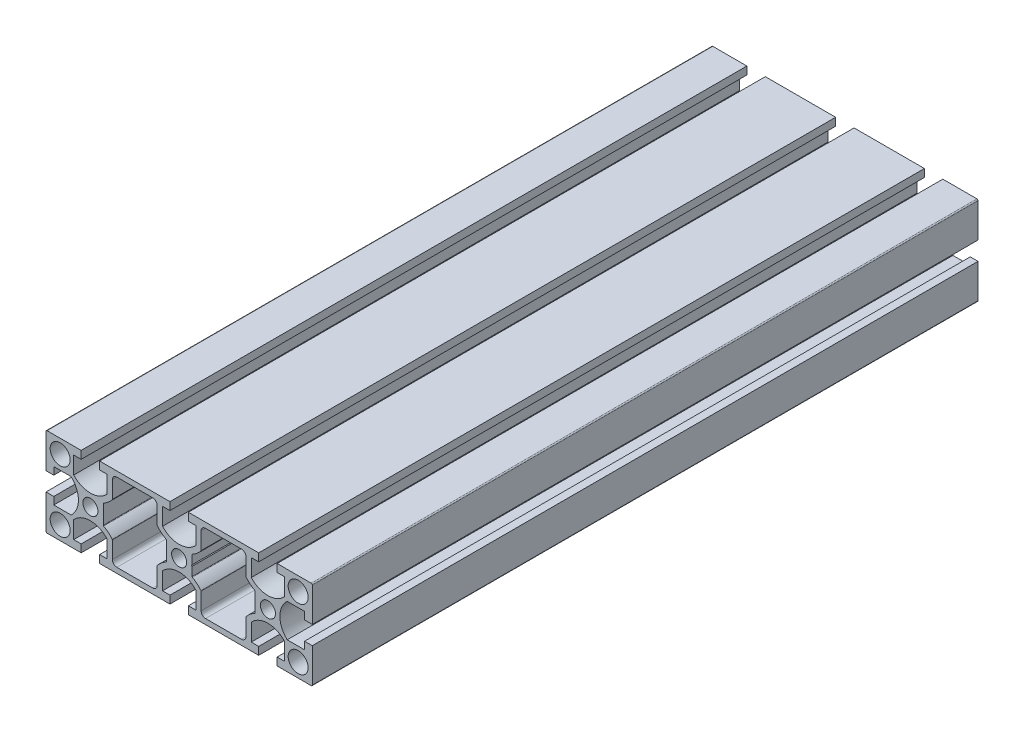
ISO-10303-21;
HEADER;
FILE_DESCRIPTION(('STEP AP214'),'2;1');
FILE_NAME('part.step','',(''),(''),'','','');
FILE_SCHEMA(('AUTOMOTIVE_DESIGN { 1 0 10303 214 1 1 1 1 }'));
ENDSEC;
DATA;
#1=APPLICATION_CONTEXT('core data for automotive mechanical design processes');
#2=APPLICATION_PROTOCOL_DEFINITION('international standard','automotive_design',2000,#1);
#3=PRODUCT_CONTEXT('',#1,'mechanical');
#4=PRODUCT('Part','Part','',(#3));
#5=PRODUCT_RELATED_PRODUCT_CATEGORY('part','',(#4));
#6=PRODUCT_DEFINITION_FORMATION('','',#4);
#7=PRODUCT_DEFINITION_CONTEXT('part definition',#1,'design');
#8=PRODUCT_DEFINITION('design','',#6,#7);
#9=PRODUCT_DEFINITION_SHAPE('','',#8);
#10=(LENGTH_UNIT() NAMED_UNIT(*) SI_UNIT(.MILLI.,.METRE.));
#11=(NAMED_UNIT(*) PLANE_ANGLE_UNIT() SI_UNIT($,.RADIAN.));
#12=(NAMED_UNIT(*) SI_UNIT($,.STERADIAN.) SOLID_ANGLE_UNIT());
#13=UNCERTAINTY_MEASURE_WITH_UNIT(LENGTH_MEASURE(1.E-05),#10,'distance_accuracy_value','');
#14=(GEOMETRIC_REPRESENTATION_CONTEXT(3) GLOBAL_UNCERTAINTY_ASSIGNED_CONTEXT((#13)) GLOBAL_UNIT_ASSIGNED_CONTEXT((#10,
#11,#12)) REPRESENTATION_CONTEXT('',''));
#15=CARTESIAN_POINT('',(0.,0.,0.));
#16=DIRECTION('',(0.,0.,1.));
#17=DIRECTION('',(1.,0.,0.));
#18=AXIS2_PLACEMENT_3D('',#15,#16,#17);
#19=CARTESIAN_POINT('',(2063.53075011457,1304.67830499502,300.));
#20=DIRECTION('',(0.,0.,1.));
#21=DIRECTION('',(1.,0.,0.));
#22=AXIS2_PLACEMENT_3D('',#19,#20,#21);
#23=PLANE('',#22);
#24=CARTESIAN_POINT('',(2143.53075011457,1289.10557772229,300.));
#25=DIRECTION('',(0.,0.,1.));
#26=DIRECTION('',(1.,0.,0.));
#27=AXIS2_PLACEMENT_3D('',#24,#25,#26);
#28=CIRCLE('',#27,3.40000000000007);
#29=CARTESIAN_POINT('',(2146.93075011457,1289.10557772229,300.));
#30=VERTEX_POINT('',#29);
#31=EDGE_CURVE('E3790',#30,#30,#28,.T.);
#32=ORIENTED_EDGE('',*,*,#31,.F.);
#33=EDGE_LOOP('',(#32));
#34=FACE_BOUND('',#33,.T.);
#35=CARTESIAN_POINT('',(2103.53075011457,1289.10557772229,300.));
#36=DIRECTION('',(0.,0.,1.));
#37=DIRECTION('',(1.,0.,0.));
#38=AXIS2_PLACEMENT_3D('',#35,#36,#37);
#39=CIRCLE('',#38,3.40000000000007);
#40=CARTESIAN_POINT('',(2106.93075011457,1289.10557772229,300.));
#41=VERTEX_POINT('',#40);
#42=EDGE_CURVE('E3806',#41,#41,#39,.T.);
#43=ORIENTED_EDGE('',*,*,#42,.F.);
#44=EDGE_LOOP('',(#43));
#45=FACE_BOUND('',#44,.T.);
#46=CARTESIAN_POINT('',(2049.90575011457,1275.35557772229,300.));
#47=DIRECTION('',(0.,0.,1.));
#48=DIRECTION('',(1.,0.,0.));
#49=AXIS2_PLACEMENT_3D('',#46,#47,#48);
#50=CIRCLE('',#49,4.50000000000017);
#51=CARTESIAN_POINT('',(2054.40575011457,1275.35557772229,300.));
#52=VERTEX_POINT('',#51);
#53=EDGE_CURVE('E3822',#52,#52,#50,.T.);
#54=ORIENTED_EDGE('',*,*,#53,.F.);
#55=EDGE_LOOP('',(#54));
#56=FACE_BOUND('',#55,.T.);
#57=CARTESIAN_POINT('',(2143.53075011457,1304.67830499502,300.));
#58=DIRECTION('',(0.,0.,-1.));
#59=DIRECTION('',(1.,0.,0.));
#60=AXIS2_PLACEMENT_3D('',#57,#58,#59);
#61=CIRCLE('',#60,12.572727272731);
#62=CARTESIAN_POINT('',(2137.57291113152,1293.60682696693,300.));
#63=VERTEX_POINT('',#62);
#64=CARTESIAN_POINT('',(2133.69608344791,1296.84550200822,300.));
#65=VERTEX_POINT('',#64);
#66=EDGE_CURVE('E820',#63,#65,#61,.T.);
#67=ORIENTED_EDGE('',*,*,#66,.F.);
#68=CARTESIAN_POINT('',(2137.43075011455,1293.34264853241,300.));
#69=DIRECTION('',(0.,0.,1.));
#70=DIRECTION('',(1.,0.,0.));
#71=AXIS2_PLACEMENT_3D('',#68,#69,#70);
#72=CIRCLE('',#71,0.300000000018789);
#73=CARTESIAN_POINT('',(2137.73075011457,1293.34264853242,300.));
#74=VERTEX_POINT('',#73);
#75=EDGE_CURVE('E811',#74,#63,#72,.T.);
#76=ORIENTED_EDGE('',*,*,#75,.F.);
#77=DIRECTION('',(0.,1.,0.));
#78=VECTOR('',#77,1.);
#79=CARTESIAN_POINT('',(2137.73075011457,1284.86850691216,300.));
#80=LINE('',#79,#78);
#81=CARTESIAN_POINT('',(2137.73075011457,1284.86850691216,300.));
#82=VERTEX_POINT('',#81);
#83=EDGE_CURVE('E912',#82,#74,#80,.T.);
#84=ORIENTED_EDGE('',*,*,#83,.F.);
#85=CARTESIAN_POINT('',(2137.43075011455,1284.86850691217,300.));
#86=DIRECTION('',(0.,0.,1.));
#87=DIRECTION('',(1.,0.,0.));
#88=AXIS2_PLACEMENT_3D('',#85,#86,#87);
#89=CIRCLE('',#88,0.300000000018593);
#90=CARTESIAN_POINT('',(2137.57291113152,1284.60432847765,300.));
#91=VERTEX_POINT('',#90);
#92=EDGE_CURVE('E909',#91,#82,#89,.T.);
#93=ORIENTED_EDGE('',*,*,#92,.F.);
#94=CARTESIAN_POINT('',(2143.53075011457,1273.53285044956,300.));
#95=DIRECTION('',(0.,0.,-1.));
#96=DIRECTION('',(1.,0.,0.));
#97=AXIS2_PLACEMENT_3D('',#94,#95,#96);
#98=CIRCLE('',#97,12.572727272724);
#99=CARTESIAN_POINT('',(2133.69608344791,1281.36565343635,300.));
#100=VERTEX_POINT('',#99);
#101=EDGE_CURVE('E906',#100,#91,#98,.T.);
#102=ORIENTED_EDGE('',*,*,#101,.F.);
#103=CARTESIAN_POINT('',(2133.9307501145,1281.17875358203,300.));
#104=DIRECTION('',(0.,0.,-1.));
#105=DIRECTION('',(1.,0.,0.));
#106=AXIS2_PLACEMENT_3D('',#103,#104,#105);
#107=CIRCLE('',#106,0.299999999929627);
#108=CARTESIAN_POINT('',(2133.63075011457,1281.178753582,300.));
#109=VERTEX_POINT('',#108);
#110=EDGE_CURVE('E903',#109,#100,#107,.T.);
#111=ORIENTED_EDGE('',*,*,#110,.F.);
#112=DIRECTION('',(0.,1.,0.));
#113=VECTOR('',#112,1.);
#114=CARTESIAN_POINT('',(2133.63075011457,1273.50557772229,300.));
#115=LINE('',#114,#113);
#116=CARTESIAN_POINT('',(2133.63075011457,1273.50557772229,300.));
#117=VERTEX_POINT('',#116);
#118=EDGE_CURVE('E900',#117,#109,#115,.T.);
#119=ORIENTED_EDGE('',*,*,#118,.F.);
#120=CARTESIAN_POINT('',(2131.63075011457,1273.50557772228,300.));
#121=DIRECTION('',(0.,0.,1.));
#122=DIRECTION('',(1.,0.,0.));
#123=AXIS2_PLACEMENT_3D('',#120,#121,#122);
#124=CIRCLE('',#123,1.99999999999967);
#125=CARTESIAN_POINT('',(2131.63075011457,1271.50557772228,300.));
#126=VERTEX_POINT('',#125);
#127=EDGE_CURVE('E897',#126,#117,#124,.T.);
#128=ORIENTED_EDGE('',*,*,#127,.F.);
#129=DIRECTION('',(1.,0.,0.));
#130=VECTOR('',#129,1.);
#131=CARTESIAN_POINT('',(2115.43075011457,1271.50557772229,300.));
#132=LINE('',#131,#130);
#133=CARTESIAN_POINT('',(2115.43075011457,1271.50557772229,300.));
#134=VERTEX_POINT('',#133);
#135=EDGE_CURVE('E894',#134,#126,#132,.T.);
#136=ORIENTED_EDGE('',*,*,#135,.F.);
#137=CARTESIAN_POINT('',(2115.43075011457,1273.50557772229,300.));
#138=DIRECTION('',(0.,0.,1.));
#139=DIRECTION('',(1.,0.,0.));
#140=AXIS2_PLACEMENT_3D('',#137,#138,#139);
#141=CIRCLE('',#140,1.99999999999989);
#142=CARTESIAN_POINT('',(2113.43075011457,1273.50557772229,300.));
#143=VERTEX_POINT('',#142);
#144=EDGE_CURVE('E891',#143,#134,#141,.T.);
#145=ORIENTED_EDGE('',*,*,#144,.F.);
#146=DIRECTION('',(0.,-1.,0.));
#147=VECTOR('',#146,1.);
#148=CARTESIAN_POINT('',(2113.43075011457,1281.17875358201,300.));
#149=LINE('',#148,#147);
#150=CARTESIAN_POINT('',(2113.43075011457,1281.17875358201,300.));
#151=VERTEX_POINT('',#150);
#152=EDGE_CURVE('E888',#151,#143,#149,.T.);
#153=ORIENTED_EDGE('',*,*,#152,.F.);
#154=CARTESIAN_POINT('',(2113.13075011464,1281.17875358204,300.));
#155=DIRECTION('',(0.,0.,-1.));
#156=DIRECTION('',(1.,0.,0.));
#157=AXIS2_PLACEMENT_3D('',#154,#155,#156);
#158=CIRCLE('',#157,0.299999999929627);
#159=CARTESIAN_POINT('',(2113.36541678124,1281.36565343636,300.));
#160=VERTEX_POINT('',#159);
#161=EDGE_CURVE('E885',#160,#151,#158,.T.);
#162=ORIENTED_EDGE('',*,*,#161,.F.);
#163=CARTESIAN_POINT('',(2103.53075011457,1273.53285044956,300.));
#164=DIRECTION('',(0.,0.,-1.));
#165=DIRECTION('',(1.,0.,0.));
#166=AXIS2_PLACEMENT_3D('',#163,#164,#165);
#167=CIRCLE('',#166,12.5727272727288);
#168=CARTESIAN_POINT('',(2109.48858909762,1284.60432847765,300.));
#169=VERTEX_POINT('',#168);
#170=EDGE_CURVE('E882',#169,#160,#167,.T.);
#171=ORIENTED_EDGE('',*,*,#170,.F.);
#172=CARTESIAN_POINT('',(2109.63075011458,1284.86850691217,300.));
#173=DIRECTION('',(0.,0.,1.));
#174=DIRECTION('',(1.,0.,0.));
#175=AXIS2_PLACEMENT_3D('',#172,#173,#174);
#176=CIRCLE('',#175,0.300000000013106);
#177=CARTESIAN_POINT('',(2109.33075011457,1284.86850691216,300.));
#178=VERTEX_POINT('',#177);
#179=EDGE_CURVE('E880',#178,#169,#176,.T.);
#180=ORIENTED_EDGE('',*,*,#179,.F.);
#181=DIRECTION('',(0.,-1.,0.));
#182=VECTOR('',#181,1.);
#183=CARTESIAN_POINT('',(2109.33075011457,1288.80557772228,300.));
#184=LINE('',#183,#182);
#185=CARTESIAN_POINT('',(2109.33075011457,1288.80557772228,300.));
#186=VERTEX_POINT('',#185);
#187=EDGE_CURVE('E877',#186,#178,#184,.T.);
#188=ORIENTED_EDGE('',*,*,#187,.F.);
#189=DIRECTION('',(0.707106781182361,-0.707106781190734,0.));
#190=VECTOR('',#189,1.);
#191=CARTESIAN_POINT('',(2109.03075011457,1289.10557772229,300.));
#192=LINE('',#191,#190);
#193=CARTESIAN_POINT('',(2109.03075011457,1289.10557772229,300.));
#194=VERTEX_POINT('',#193);
#195=EDGE_CURVE('E874',#194,#186,#192,.T.);
#196=ORIENTED_EDGE('',*,*,#195,.F.);
#197=DIRECTION('',(-0.707106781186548,-0.707106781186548,0.));
#198=VECTOR('',#197,1.);
#199=CARTESIAN_POINT('',(2109.33075011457,1289.40557772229,300.));
#200=LINE('',#199,#198);
#201=CARTESIAN_POINT('',(2109.33075011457,1289.40557772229,300.));
#202=VERTEX_POINT('',#201);
#203=EDGE_CURVE('E871',#202,#194,#200,.T.);
#204=ORIENTED_EDGE('',*,*,#203,.F.);
#205=DIRECTION('',(0.,-1.,0.));
#206=VECTOR('',#205,1.);
#207=CARTESIAN_POINT('',(2109.33075011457,1293.34264853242,300.));
#208=LINE('',#207,#206);
#209=CARTESIAN_POINT('',(2109.33075011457,1293.34264853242,300.));
#210=VERTEX_POINT('',#209);
#211=EDGE_CURVE('E868',#210,#202,#208,.T.);
#212=ORIENTED_EDGE('',*,*,#211,.F.);
#213=CARTESIAN_POINT('',(2109.63075011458,1293.34264853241,300.));
#214=DIRECTION('',(0.,0.,1.));
#215=DIRECTION('',(1.,0.,0.));
#216=AXIS2_PLACEMENT_3D('',#213,#214,#215);
#217=CIRCLE('',#216,0.30000000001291);
#218=CARTESIAN_POINT('',(2109.48858909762,1293.60682696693,300.));
#219=VERTEX_POINT('',#218);
#220=EDGE_CURVE('E865',#219,#210,#217,.T.);
#221=ORIENTED_EDGE('',*,*,#220,.F.);
#222=CARTESIAN_POINT('',(2103.53075011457,1304.67830499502,300.));
#223=DIRECTION('',(0.,0.,-1.));
#224=DIRECTION('',(1.,0.,0.));
#225=AXIS2_PLACEMENT_3D('',#222,#223,#224);
#226=CIRCLE('',#225,12.5727272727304);
#227=CARTESIAN_POINT('',(2113.36541678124,1296.84550200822,300.));
#228=VERTEX_POINT('',#227);
#229=EDGE_CURVE('E862',#228,#219,#226,.T.);
#230=ORIENTED_EDGE('',*,*,#229,.F.);
#231=CARTESIAN_POINT('',(2113.13075011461,1297.03240186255,300.));
#232=DIRECTION('',(0.,0.,-1.));
#233=DIRECTION('',(1.,0.,0.));
#234=AXIS2_PLACEMENT_3D('',#231,#232,#233);
#235=CIRCLE('',#234,0.299999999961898);
#236=CARTESIAN_POINT('',(2113.43075011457,1297.03240186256,300.));
#237=VERTEX_POINT('',#236);
#238=EDGE_CURVE('E859',#237,#228,#235,.T.);
#239=ORIENTED_EDGE('',*,*,#238,.F.);
#240=DIRECTION('',(0.,-1.,0.));
#241=VECTOR('',#240,1.);
#242=CARTESIAN_POINT('',(2113.43075011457,1304.70557772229,300.));
#243=LINE('',#242,#241);
#244=CARTESIAN_POINT('',(2113.43075011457,1304.70557772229,300.));
#245=VERTEX_POINT('',#244);
#246=EDGE_CURVE('E856',#245,#237,#243,.T.);
#247=ORIENTED_EDGE('',*,*,#246,.F.);
#248=CARTESIAN_POINT('',(2115.43075011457,1304.70557772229,300.));
#249=DIRECTION('',(0.,0.,1.));
#250=DIRECTION('',(1.,0.,0.));
#251=AXIS2_PLACEMENT_3D('',#248,#249,#250);
#252=CIRCLE('',#251,1.99999999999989);
#253=CARTESIAN_POINT('',(2115.43075011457,1306.70557772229,300.));
#254=VERTEX_POINT('',#253);
#255=EDGE_CURVE('E853',#254,#245,#252,.T.);
#256=ORIENTED_EDGE('',*,*,#255,.F.);
#257=DIRECTION('',(-1.,0.,0.));
#258=VECTOR('',#257,1.);
#259=CARTESIAN_POINT('',(2131.63075011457,1306.70557772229,300.));
#260=LINE('',#259,#258);
#261=CARTESIAN_POINT('',(2131.63075011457,1306.70557772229,300.));
#262=VERTEX_POINT('',#261);
#263=EDGE_CURVE('E850',#262,#254,#260,.T.);
#264=ORIENTED_EDGE('',*,*,#263,.F.);
#265=CARTESIAN_POINT('',(2131.63075011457,1304.70557772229,300.));
#266=DIRECTION('',(0.,0.,1.));
#267=DIRECTION('',(1.,0.,0.));
#268=AXIS2_PLACEMENT_3D('',#265,#266,#267);
#269=CIRCLE('',#268,1.99999999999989);
#270=CARTESIAN_POINT('',(2133.63075011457,1304.70557772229,300.));
#271=VERTEX_POINT('',#270);
#272=EDGE_CURVE('E847',#271,#262,#269,.T.);
#273=ORIENTED_EDGE('',*,*,#272,.F.);
#274=DIRECTION('',(0.,1.,0.));
#275=VECTOR('',#274,1.);
#276=CARTESIAN_POINT('',(2133.63075011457,1297.03240186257,300.));
#277=LINE('',#276,#275);
#278=CARTESIAN_POINT('',(2133.63075011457,1297.03240186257,300.));
#279=VERTEX_POINT('',#278);
#280=EDGE_CURVE('E841',#279,#271,#277,.T.);
#281=ORIENTED_EDGE('',*,*,#280,.F.);
#282=CARTESIAN_POINT('',(2133.93075011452,1297.03240186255,300.));
#283=DIRECTION('',(0.,0.,-1.));
#284=DIRECTION('',(1.,0.,0.));
#285=AXIS2_PLACEMENT_3D('',#282,#283,#284);
#286=CIRCLE('',#285,0.29999999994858);
#287=EDGE_CURVE('E835',#65,#279,#286,.T.);
#288=ORIENTED_EDGE('',*,*,#287,.F.);
#289=EDGE_LOOP('',(#67,#76,#84,#93,#102,#111,#119,#128,#136,#145,#153,#162,#171,#180,#188,#196,
#204,#212,#221,#230,#239,#247,#256,#264,#273,#281,#288));
#290=FACE_BOUND('',#289,.T.);
#291=CARTESIAN_POINT('',(2069.63075011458,1293.34264853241,300.));
#292=DIRECTION('',(0.,0.,1.));
#293=DIRECTION('',(1.,0.,0.));
#294=AXIS2_PLACEMENT_3D('',#291,#292,#293);
#295=CIRCLE('',#294,0.30000000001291);
#296=CARTESIAN_POINT('',(2069.48858909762,1293.60682696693,300.));
#297=VERTEX_POINT('',#296);
#298=CARTESIAN_POINT('',(2069.33075011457,1293.34264853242,300.));
#299=VERTEX_POINT('',#298);
#300=EDGE_CURVE('E1096',#297,#299,#295,.T.);
#301=ORIENTED_EDGE('',*,*,#300,.F.);
#302=CARTESIAN_POINT('',(2063.53075011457,1304.67830499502,300.));
#303=DIRECTION('',(0.,0.,-1.));
#304=DIRECTION('',(1.,0.,0.));
#305=AXIS2_PLACEMENT_3D('',#302,#303,#304);
#306=CIRCLE('',#305,12.5727272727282);
#307=CARTESIAN_POINT('',(2073.36541678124,1296.84550200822,300.));
#308=VERTEX_POINT('',#307);
#309=EDGE_CURVE('E1093',#308,#297,#306,.T.);
#310=ORIENTED_EDGE('',*,*,#309,.F.);
#311=CARTESIAN_POINT('',(2073.13075011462,1297.03240186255,300.));
#312=DIRECTION('',(0.,0.,-1.));
#313=DIRECTION('',(1.,0.,0.));
#314=AXIS2_PLACEMENT_3D('',#311,#312,#313);
#315=CIRCLE('',#314,0.299999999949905);
#316=CARTESIAN_POINT('',(2073.43075011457,1297.03240186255,300.));
#317=VERTEX_POINT('',#316);
#318=EDGE_CURVE('E1173',#317,#308,#315,.T.);
#319=ORIENTED_EDGE('',*,*,#318,.F.);
#320=DIRECTION('',(0.,-1.,0.));
#321=VECTOR('',#320,1.);
#322=CARTESIAN_POINT('',(2073.43075011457,1304.70557772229,300.));
#323=LINE('',#322,#321);
#324=CARTESIAN_POINT('',(2073.43075011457,1304.70557772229,300.));
#325=VERTEX_POINT('',#324);
#326=EDGE_CURVE('E1169',#325,#317,#323,.T.);
#327=ORIENTED_EDGE('',*,*,#326,.F.);
#328=CARTESIAN_POINT('',(2075.43075011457,1304.70557772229,300.));
#329=DIRECTION('',(0.,0.,1.));
#330=DIRECTION('',(1.,0.,0.));
#331=AXIS2_PLACEMENT_3D('',#328,#329,#330);
#332=CIRCLE('',#331,1.99999999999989);
#333=CARTESIAN_POINT('',(2075.43075011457,1306.70557772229,300.));
#334=VERTEX_POINT('',#333);
#335=EDGE_CURVE('E1166',#334,#325,#332,.T.);
#336=ORIENTED_EDGE('',*,*,#335,.F.);
#337=DIRECTION('',(-1.,0.,0.));
#338=VECTOR('',#337,1.);
#339=CARTESIAN_POINT('',(2091.63075011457,1306.70557772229,300.));
#340=LINE('',#339,#338);
#341=CARTESIAN_POINT('',(2091.63075011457,1306.70557772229,300.));
#342=VERTEX_POINT('',#341);
#343=EDGE_CURVE('E1163',#342,#334,#340,.T.);
#344=ORIENTED_EDGE('',*,*,#343,.F.);
#345=CARTESIAN_POINT('',(2091.63075011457,1304.70557772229,300.));
#346=DIRECTION('',(0.,0.,1.));
#347=DIRECTION('',(1.,0.,0.));
#348=AXIS2_PLACEMENT_3D('',#345,#346,#347);
#349=CIRCLE('',#348,1.99999999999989);
#350=CARTESIAN_POINT('',(2093.63075011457,1304.70557772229,300.));
#351=VERTEX_POINT('',#350);
#352=EDGE_CURVE('E1160',#351,#342,#349,.T.);
#353=ORIENTED_EDGE('',*,*,#352,.F.);
#354=DIRECTION('',(0.,1.,0.));
#355=VECTOR('',#354,1.);
#356=CARTESIAN_POINT('',(2093.63075011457,1297.03240186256,300.));
#357=LINE('',#356,#355);
#358=CARTESIAN_POINT('',(2093.63075011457,1297.03240186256,300.));
#359=VERTEX_POINT('',#358);
#360=EDGE_CURVE('E1157',#359,#351,#357,.T.);
#361=ORIENTED_EDGE('',*,*,#360,.F.);
#362=CARTESIAN_POINT('',(2093.93075011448,1297.03240186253,300.));
#363=DIRECTION('',(0.,0.,-1.));
#364=DIRECTION('',(1.,0.,0.));
#365=AXIS2_PLACEMENT_3D('',#362,#363,#364);
#366=CIRCLE('',#365,0.299999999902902);
#367=CARTESIAN_POINT('',(2093.69608344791,1296.84550200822,300.));
#368=VERTEX_POINT('',#367);
#369=EDGE_CURVE('E1154',#368,#359,#366,.T.);
#370=ORIENTED_EDGE('',*,*,#369,.F.);
#371=CARTESIAN_POINT('',(2103.53075011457,1304.67830499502,300.));
#372=DIRECTION('',(0.,0.,-1.));
#373=DIRECTION('',(1.,0.,0.));
#374=AXIS2_PLACEMENT_3D('',#371,#372,#373);
#375=CIRCLE('',#374,12.5727272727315);
#376=CARTESIAN_POINT('',(2097.57291113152,1293.60682696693,300.));
#377=VERTEX_POINT('',#376);
#378=EDGE_CURVE('E1151',#377,#368,#375,.T.);
#379=ORIENTED_EDGE('',*,*,#378,.F.);
#380=CARTESIAN_POINT('',(2097.43075011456,1293.34264853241,300.));
#381=DIRECTION('',(0.,0.,1.));
#382=DIRECTION('',(1.,0.,0.));
#383=AXIS2_PLACEMENT_3D('',#380,#381,#382);
#384=CIRCLE('',#383,0.300000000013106);
#385=CARTESIAN_POINT('',(2097.73075011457,1293.34264853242,300.));
#386=VERTEX_POINT('',#385);
#387=EDGE_CURVE('E1148',#386,#377,#384,.T.);
#388=ORIENTED_EDGE('',*,*,#387,.F.);
#389=DIRECTION('',(0.,1.,0.));
#390=VECTOR('',#389,1.);
#391=CARTESIAN_POINT('',(2097.73075011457,1289.40557772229,300.));
#392=LINE('',#391,#390);
#393=CARTESIAN_POINT('',(2097.73075011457,1289.40557772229,300.));
#394=VERTEX_POINT('',#393);
#395=EDGE_CURVE('E1145',#394,#386,#392,.T.);
#396=ORIENTED_EDGE('',*,*,#395,.F.);
#397=DIRECTION('',(-0.707106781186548,0.707106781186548,0.));
#398=VECTOR('',#397,1.);
#399=CARTESIAN_POINT('',(2098.03075011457,1289.10557772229,300.));
#400=LINE('',#399,#398);
#401=CARTESIAN_POINT('',(2098.03075011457,1289.10557772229,300.));
#402=VERTEX_POINT('',#401);
#403=EDGE_CURVE('E1142',#402,#394,#400,.T.);
#404=ORIENTED_EDGE('',*,*,#403,.F.);
#405=DIRECTION('',(0.707106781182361,0.707106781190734,0.));
#406=VECTOR('',#405,1.);
#407=CARTESIAN_POINT('',(2097.73075011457,1288.80557772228,300.));
#408=LINE('',#407,#406);
#409=CARTESIAN_POINT('',(2097.73075011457,1288.80557772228,300.));
#410=VERTEX_POINT('',#409);
#411=EDGE_CURVE('E1139',#410,#402,#408,.T.);
#412=ORIENTED_EDGE('',*,*,#411,.F.);
#413=DIRECTION('',(0.,1.,0.));
#414=VECTOR('',#413,1.);
#415=CARTESIAN_POINT('',(2097.73075011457,1284.86850691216,300.));
#416=LINE('',#415,#414);
#417=CARTESIAN_POINT('',(2097.73075011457,1284.86850691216,300.));
#418=VERTEX_POINT('',#417);
#419=EDGE_CURVE('E1136',#418,#410,#416,.T.);
#420=ORIENTED_EDGE('',*,*,#419,.F.);
#421=CARTESIAN_POINT('',(2097.43075011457,1284.86850691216,300.));
#422=DIRECTION('',(0.,0.,1.));
#423=DIRECTION('',(1.,0.,0.));
#424=AXIS2_PLACEMENT_3D('',#421,#422,#423);
#425=CIRCLE('',#424,0.300000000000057);
#426=CARTESIAN_POINT('',(2097.57291113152,1284.60432847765,300.));
#427=VERTEX_POINT('',#426);
#428=EDGE_CURVE('E1133',#427,#418,#425,.T.);
#429=ORIENTED_EDGE('',*,*,#428,.F.);
#430=CARTESIAN_POINT('',(2103.53075011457,1273.53285044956,300.));
#431=DIRECTION('',(0.,0.,-1.));
#432=DIRECTION('',(1.,0.,0.));
#433=AXIS2_PLACEMENT_3D('',#430,#431,#432);
#434=CIRCLE('',#433,12.5727272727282);
#435=CARTESIAN_POINT('',(2093.69608344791,1281.36565343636,300.));
#436=VERTEX_POINT('',#435);
#437=EDGE_CURVE('E1130',#436,#427,#434,.T.);
#438=ORIENTED_EDGE('',*,*,#437,.F.);
#439=CARTESIAN_POINT('',(2093.9307501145,1281.17875358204,300.));
#440=DIRECTION('',(0.,0.,-1.));
#441=DIRECTION('',(1.,0.,0.));
#442=AXIS2_PLACEMENT_3D('',#439,#440,#441);
#443=CIRCLE('',#442,0.299999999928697);
#444=CARTESIAN_POINT('',(2093.63075011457,1281.17875358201,300.));
#445=VERTEX_POINT('',#444);
#446=EDGE_CURVE('E1127',#445,#436,#443,.T.);
#447=ORIENTED_EDGE('',*,*,#446,.F.);
#448=DIRECTION('',(0.,1.,0.));
#449=VECTOR('',#448,1.);
#450=CARTESIAN_POINT('',(2093.63075011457,1273.50557772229,300.));
#451=LINE('',#450,#449);
#452=CARTESIAN_POINT('',(2093.63075011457,1273.50557772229,300.));
#453=VERTEX_POINT('',#452);
#454=EDGE_CURVE('E1124',#453,#445,#451,.T.);
#455=ORIENTED_EDGE('',*,*,#454,.F.);
#456=CARTESIAN_POINT('',(2091.63075011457,1273.50557772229,300.));
#457=DIRECTION('',(0.,0.,1.));
#458=DIRECTION('',(1.,0.,0.));
#459=AXIS2_PLACEMENT_3D('',#456,#457,#458);
#460=CIRCLE('',#459,1.99999999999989);
#461=CARTESIAN_POINT('',(2091.63075011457,1271.50557772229,300.));
#462=VERTEX_POINT('',#461);
#463=EDGE_CURVE('E1121',#462,#453,#460,.T.);
#464=ORIENTED_EDGE('',*,*,#463,.F.);
#465=DIRECTION('',(1.,0.,0.));
#466=VECTOR('',#465,1.);
#467=CARTESIAN_POINT('',(2075.43075011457,1271.50557772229,300.));
#468=LINE('',#467,#466);
#469=CARTESIAN_POINT('',(2075.43075011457,1271.50557772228,300.));
#470=VERTEX_POINT('',#469);
#471=EDGE_CURVE('E1118',#470,#462,#468,.T.);
#472=ORIENTED_EDGE('',*,*,#471,.F.);
#473=CARTESIAN_POINT('',(2075.43075011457,1273.50557772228,300.));
#474=DIRECTION('',(0.,0.,1.));
#475=DIRECTION('',(1.,0.,0.));
#476=AXIS2_PLACEMENT_3D('',#473,#474,#475);
#477=CIRCLE('',#476,1.99999999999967);
#478=CARTESIAN_POINT('',(2073.43075011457,1273.50557772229,300.));
#479=VERTEX_POINT('',#478);
#480=EDGE_CURVE('E1115',#479,#470,#477,.T.);
#481=ORIENTED_EDGE('',*,*,#480,.F.);
#482=DIRECTION('',(0.,-1.,0.));
#483=VECTOR('',#482,1.);
#484=CARTESIAN_POINT('',(2073.43075011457,1281.178753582,300.));
#485=LINE('',#484,#483);
#486=CARTESIAN_POINT('',(2073.43075011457,1281.178753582,300.));
#487=VERTEX_POINT('',#486);
#488=EDGE_CURVE('E1112',#487,#479,#485,.T.);
#489=ORIENTED_EDGE('',*,*,#488,.F.);
#490=CARTESIAN_POINT('',(2073.13075011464,1281.17875358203,300.));
#491=DIRECTION('',(0.,0.,-1.));
#492=DIRECTION('',(1.,0.,0.));
#493=AXIS2_PLACEMENT_3D('',#490,#491,#492);
#494=CIRCLE('',#493,0.299999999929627);
#495=CARTESIAN_POINT('',(2073.36541678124,1281.36565343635,300.));
#496=VERTEX_POINT('',#495);
#497=EDGE_CURVE('E1109',#496,#487,#494,.T.);
#498=ORIENTED_EDGE('',*,*,#497,.F.);
#499=CARTESIAN_POINT('',(2063.53075011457,1273.53285044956,300.));
#500=DIRECTION('',(0.,0.,-1.));
#501=DIRECTION('',(1.,0.,0.));
#502=AXIS2_PLACEMENT_3D('',#499,#500,#501);
#503=CIRCLE('',#502,12.5727272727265);
#504=CARTESIAN_POINT('',(2069.48858909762,1284.60432847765,300.));
#505=VERTEX_POINT('',#504);
#506=EDGE_CURVE('E1106',#505,#496,#503,.T.);
#507=ORIENTED_EDGE('',*,*,#506,.F.);
#508=CARTESIAN_POINT('',(2069.63075011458,1284.86850691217,300.));
#509=DIRECTION('',(0.,0.,1.));
#510=DIRECTION('',(1.,0.,0.));
#511=AXIS2_PLACEMENT_3D('',#508,#509,#510);
#512=CIRCLE('',#511,0.30000000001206);
#513=CARTESIAN_POINT('',(2069.33075011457,1284.86850691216,300.));
#514=VERTEX_POINT('',#513);
#515=EDGE_CURVE('E1103',#514,#505,#512,.T.);
#516=ORIENTED_EDGE('',*,*,#515,.F.);
#517=DIRECTION('',(0.,-1.,0.));
#518=VECTOR('',#517,1.);
#519=CARTESIAN_POINT('',(2069.33075011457,1293.34264853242,300.));
#520=LINE('',#519,#518);
#521=EDGE_CURVE('E1100',#299,#514,#520,.T.);
#522=ORIENTED_EDGE('',*,*,#521,.F.);
#523=EDGE_LOOP('',(#301,#310,#319,#327,#336,#344,#353,#361,#370,#379,#388,#396,#404,#412,#420,
#429,#438,#447,#455,#464,#472,#481,#489,#498,#507,#516,#522));
#524=FACE_BOUND('',#523,.T.);
#525=CARTESIAN_POINT('',(2063.53075011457,1304.67830499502,300.));
#526=DIRECTION('',(0.,0.,-1.));
#527=DIRECTION('',(1.,0.,0.));
#528=AXIS2_PLACEMENT_3D('',#525,#526,#527);
#529=CIRCLE('',#528,10.1727272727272);
#530=CARTESIAN_POINT('',(2071.03075011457,1297.80557772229,300.));
#531=VERTEX_POINT('',#530);
#532=CARTESIAN_POINT('',(2056.03075011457,1297.80557772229,300.));
#533=VERTEX_POINT('',#532);
#534=EDGE_CURVE('E1366',#531,#533,#529,.T.);
#535=ORIENTED_EDGE('',*,*,#534,.T.);
#536=DIRECTION('',(0.,1.,0.));
#537=VECTOR('',#536,1.);
#538=CARTESIAN_POINT('',(2056.03075011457,1297.80557772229,300.));
#539=LINE('',#538,#537);
#540=CARTESIAN_POINT('',(2056.03075011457,1305.60557772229,300.));
#541=VERTEX_POINT('',#540);
#542=EDGE_CURVE('E1370',#533,#541,#539,.T.);
#543=ORIENTED_EDGE('',*,*,#542,.T.);
#544=DIRECTION('',(1.,0.,0.));
#545=VECTOR('',#544,1.);
#546=CARTESIAN_POINT('',(2056.03075011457,1305.60557772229,300.));
#547=LINE('',#546,#545);
#548=CARTESIAN_POINT('',(2059.38075011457,1305.60557772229,300.));
#549=VERTEX_POINT('',#548);
#550=EDGE_CURVE('E1374',#541,#549,#547,.T.);
#551=ORIENTED_EDGE('',*,*,#550,.T.);
#552=DIRECTION('',(0.,1.,0.));
#553=VECTOR('',#552,1.);
#554=CARTESIAN_POINT('',(2059.38075011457,1305.60557772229,300.));
#555=LINE('',#554,#553);
#556=CARTESIAN_POINT('',(2059.38075011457,1309.10557772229,300.));
#557=VERTEX_POINT('',#556);
#558=EDGE_CURVE('E1377',#549,#557,#555,.T.);
#559=ORIENTED_EDGE('',*,*,#558,.T.);
#560=DIRECTION('',(-1.,0.,0.));
#561=VECTOR('',#560,1.);
#562=CARTESIAN_POINT('',(2059.38075011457,1309.10557772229,300.));
#563=LINE('',#562,#561);
#564=CARTESIAN_POINT('',(2044.03075011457,1309.10557772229,300.));
#565=VERTEX_POINT('',#564);
#566=EDGE_CURVE('E1380',#557,#565,#563,.T.);
#567=ORIENTED_EDGE('',*,*,#566,.T.);
#568=CARTESIAN_POINT('',(2044.03075011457,1308.60557772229,300.));
#569=DIRECTION('',(0.,0.,1.));
#570=DIRECTION('',(1.,0.,0.));
#571=AXIS2_PLACEMENT_3D('',#568,#569,#570);
#572=CIRCLE('',#571,0.499999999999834);
#573=CARTESIAN_POINT('',(2043.53075011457,1308.60557772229,300.));
#574=VERTEX_POINT('',#573);
#575=EDGE_CURVE('E1383',#565,#574,#572,.T.);
#576=ORIENTED_EDGE('',*,*,#575,.T.);
#577=DIRECTION('',(0.,-1.,0.));
#578=VECTOR('',#577,1.);
#579=CARTESIAN_POINT('',(2043.53075011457,1308.60557772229,300.));
#580=LINE('',#579,#578);
#581=CARTESIAN_POINT('',(2043.53075011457,1293.25557772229,300.));
#582=VERTEX_POINT('',#581);
#583=EDGE_CURVE('E1386',#574,#582,#580,.T.);
#584=ORIENTED_EDGE('',*,*,#583,.T.);
#585=DIRECTION('',(1.,0.,0.));
#586=VECTOR('',#585,1.);
#587=CARTESIAN_POINT('',(2043.53075011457,1293.25557772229,300.));
#588=LINE('',#587,#586);
#589=CARTESIAN_POINT('',(2047.03075011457,1293.25557772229,300.));
#590=VERTEX_POINT('',#589);
#591=EDGE_CURVE('E1389',#582,#590,#588,.T.);
#592=ORIENTED_EDGE('',*,*,#591,.T.);
#593=DIRECTION('',(0.,1.,0.));
#594=VECTOR('',#593,1.);
#595=CARTESIAN_POINT('',(2047.03075011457,1293.25557772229,300.));
#596=LINE('',#595,#594);
#597=CARTESIAN_POINT('',(2047.03075011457,1296.60557772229,300.));
#598=VERTEX_POINT('',#597);
#599=EDGE_CURVE('E1392',#590,#598,#596,.T.);
#600=ORIENTED_EDGE('',*,*,#599,.T.);
#601=DIRECTION('',(1.,0.,0.));
#602=VECTOR('',#601,1.);
#603=CARTESIAN_POINT('',(2047.03075011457,1296.60557772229,300.));
#604=LINE('',#603,#602);
#605=CARTESIAN_POINT('',(2054.83075011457,1296.60557772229,300.));
#606=VERTEX_POINT('',#605);
#607=EDGE_CURVE('E1395',#598,#606,#604,.T.);
#608=ORIENTED_EDGE('',*,*,#607,.T.);
#609=CARTESIAN_POINT('',(2047.95802284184,1289.10557772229,300.));
#610=DIRECTION('',(0.,0.,-1.));
#611=DIRECTION('',(1.,0.,0.));
#612=AXIS2_PLACEMENT_3D('',#609,#610,#611);
#613=CIRCLE('',#612,10.1727272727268);
#614=CARTESIAN_POINT('',(2054.83075011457,1281.60557772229,300.));
#615=VERTEX_POINT('',#614);
#616=EDGE_CURVE('E1398',#606,#615,#613,.T.);
#617=ORIENTED_EDGE('',*,*,#616,.T.);
#618=DIRECTION('',(-1.,0.,0.));
#619=VECTOR('',#618,1.);
#620=CARTESIAN_POINT('',(2054.83075011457,1281.60557772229,300.));
#621=LINE('',#620,#619);
#622=CARTESIAN_POINT('',(2047.03075011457,1281.60557772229,300.));
#623=VERTEX_POINT('',#622);
#624=EDGE_CURVE('E1401',#615,#623,#621,.T.);
#625=ORIENTED_EDGE('',*,*,#624,.T.);
#626=DIRECTION('',(0.,1.,0.));
#627=VECTOR('',#626,1.);
#628=CARTESIAN_POINT('',(2047.03075011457,1281.60557772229,300.));
#629=LINE('',#628,#627);
#630=CARTESIAN_POINT('',(2047.03075011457,1284.95557772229,300.));
#631=VERTEX_POINT('',#630);
#632=EDGE_CURVE('E1404',#623,#631,#629,.T.);
#633=ORIENTED_EDGE('',*,*,#632,.T.);
#634=DIRECTION('',(-1.,0.,0.));
#635=VECTOR('',#634,1.);
#636=CARTESIAN_POINT('',(2047.03075011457,1284.95557772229,300.));
#637=LINE('',#636,#635);
#638=CARTESIAN_POINT('',(2043.53075011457,1284.95557772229,300.));
#639=VERTEX_POINT('',#638);
#640=EDGE_CURVE('E1407',#631,#639,#637,.T.);
#641=ORIENTED_EDGE('',*,*,#640,.T.);
#642=DIRECTION('',(0.,-1.,0.));
#643=VECTOR('',#642,1.);
#644=CARTESIAN_POINT('',(2043.53075011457,1284.95557772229,300.));
#645=LINE('',#644,#643);
#646=CARTESIAN_POINT('',(2043.53075011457,1269.60557772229,300.));
#647=VERTEX_POINT('',#646);
#648=EDGE_CURVE('E1410',#639,#647,#645,.T.);
#649=ORIENTED_EDGE('',*,*,#648,.T.);
#650=CARTESIAN_POINT('',(2044.03075011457,1269.60557772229,300.));
#651=DIRECTION('',(0.,0.,1.));
#652=DIRECTION('',(1.,0.,0.));
#653=AXIS2_PLACEMENT_3D('',#650,#651,#652);
#654=CIRCLE('',#653,0.499999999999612);
#655=CARTESIAN_POINT('',(2044.03075011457,1269.10557772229,300.));
#656=VERTEX_POINT('',#655);
#657=EDGE_CURVE('E1413',#647,#656,#654,.T.);
#658=ORIENTED_EDGE('',*,*,#657,.T.);
#659=DIRECTION('',(1.,0.,0.));
#660=VECTOR('',#659,1.);
#661=CARTESIAN_POINT('',(2044.03075011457,1269.10557772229,300.));
#662=LINE('',#661,#660);
#663=CARTESIAN_POINT('',(2059.38075011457,1269.10557772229,300.));
#664=VERTEX_POINT('',#663);
#665=EDGE_CURVE('E1416',#656,#664,#662,.T.);
#666=ORIENTED_EDGE('',*,*,#665,.T.);
#667=DIRECTION('',(0.,1.,0.));
#668=VECTOR('',#667,1.);
#669=CARTESIAN_POINT('',(2059.38075011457,1269.10557772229,300.));
#670=LINE('',#669,#668);
#671=CARTESIAN_POINT('',(2059.38075011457,1272.60557772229,300.));
#672=VERTEX_POINT('',#671);
#673=EDGE_CURVE('E1419',#664,#672,#670,.T.);
#674=ORIENTED_EDGE('',*,*,#673,.T.);
#675=DIRECTION('',(-1.,0.,0.));
#676=VECTOR('',#675,1.);
#677=CARTESIAN_POINT('',(2059.38075011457,1272.60557772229,300.));
#678=LINE('',#677,#676);
#679=CARTESIAN_POINT('',(2056.03075011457,1272.60557772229,300.));
#680=VERTEX_POINT('',#679);
#681=EDGE_CURVE('E1422',#672,#680,#678,.T.);
#682=ORIENTED_EDGE('',*,*,#681,.T.);
#683=DIRECTION('',(0.,1.,0.));
#684=VECTOR('',#683,1.);
#685=CARTESIAN_POINT('',(2056.03075011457,1272.60557772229,300.));
#686=LINE('',#685,#684);
#687=CARTESIAN_POINT('',(2056.03075011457,1280.40557772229,300.));
#688=VERTEX_POINT('',#687);
#689=EDGE_CURVE('E1425',#680,#688,#686,.T.);
#690=ORIENTED_EDGE('',*,*,#689,.T.);
#691=CARTESIAN_POINT('',(2063.53075011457,1273.53285044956,300.));
#692=DIRECTION('',(0.,0.,-1.));
#693=DIRECTION('',(1.,0.,0.));
#694=AXIS2_PLACEMENT_3D('',#691,#692,#693);
#695=CIRCLE('',#694,10.1727272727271);
#696=CARTESIAN_POINT('',(2071.03075011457,1280.40557772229,300.));
#697=VERTEX_POINT('',#696);
#698=EDGE_CURVE('E1428',#688,#697,#695,.T.);
#699=ORIENTED_EDGE('',*,*,#698,.T.);
#700=DIRECTION('',(0.,-1.,0.));
#701=VECTOR('',#700,1.);
#702=CARTESIAN_POINT('',(2071.03075011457,1280.40557772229,300.));
#703=LINE('',#702,#701);
#704=CARTESIAN_POINT('',(2071.03075011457,1272.60557772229,300.));
#705=VERTEX_POINT('',#704);
#706=EDGE_CURVE('E1431',#697,#705,#703,.T.);
#707=ORIENTED_EDGE('',*,*,#706,.T.);
#708=DIRECTION('',(-1.,0.,0.));
#709=VECTOR('',#708,1.);
#710=CARTESIAN_POINT('',(2071.03075011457,1272.60557772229,300.));
#711=LINE('',#710,#709);
#712=CARTESIAN_POINT('',(2067.68075011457,1272.60557772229,300.));
#713=VERTEX_POINT('',#712);
#714=EDGE_CURVE('E1434',#705,#713,#711,.T.);
#715=ORIENTED_EDGE('',*,*,#714,.T.);
#716=DIRECTION('',(0.,-1.,0.));
#717=VECTOR('',#716,1.);
#718=CARTESIAN_POINT('',(2067.68075011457,1272.60557772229,300.));
#719=LINE('',#718,#717);
#720=CARTESIAN_POINT('',(2067.68075011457,1269.10557772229,300.));
#721=VERTEX_POINT('',#720);
#722=EDGE_CURVE('E1437',#713,#721,#719,.T.);
#723=ORIENTED_EDGE('',*,*,#722,.T.);
#724=DIRECTION('',(1.,0.,0.));
#725=VECTOR('',#724,1.);
#726=CARTESIAN_POINT('',(2067.68075011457,1269.10557772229,300.));
#727=LINE('',#726,#725);
#728=CARTESIAN_POINT('',(2099.38075011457,1269.10557772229,300.));
#729=VERTEX_POINT('',#728);
#730=EDGE_CURVE('E1440',#721,#729,#727,.T.);
#731=ORIENTED_EDGE('',*,*,#730,.T.);
#732=DIRECTION('',(0.,1.,0.));
#733=VECTOR('',#732,1.);
#734=CARTESIAN_POINT('',(2099.38075011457,1269.10557772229,300.));
#735=LINE('',#734,#733);
#736=CARTESIAN_POINT('',(2099.38075011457,1272.60557772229,300.));
#737=VERTEX_POINT('',#736);
#738=EDGE_CURVE('E1443',#729,#737,#735,.T.);
#739=ORIENTED_EDGE('',*,*,#738,.T.);
#740=DIRECTION('',(-1.,0.,0.));
#741=VECTOR('',#740,1.);
#742=CARTESIAN_POINT('',(2099.38075011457,1272.60557772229,300.));
#743=LINE('',#742,#741);
#744=CARTESIAN_POINT('',(2096.03075011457,1272.60557772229,300.));
#745=VERTEX_POINT('',#744);
#746=EDGE_CURVE('E1446',#737,#745,#743,.T.);
#747=ORIENTED_EDGE('',*,*,#746,.T.);
#748=DIRECTION('',(0.,1.,0.));
#749=VECTOR('',#748,1.);
#750=CARTESIAN_POINT('',(2096.03075011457,1272.60557772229,300.));
#751=LINE('',#750,#749);
#752=CARTESIAN_POINT('',(2096.03075011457,1280.40557772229,300.));
#753=VERTEX_POINT('',#752);
#754=EDGE_CURVE('E1449',#745,#753,#751,.T.);
#755=ORIENTED_EDGE('',*,*,#754,.T.);
#756=CARTESIAN_POINT('',(2103.53075011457,1273.53285044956,300.));
#757=DIRECTION('',(0.,0.,-1.));
#758=DIRECTION('',(1.,0.,0.));
#759=AXIS2_PLACEMENT_3D('',#756,#757,#758);
#760=CIRCLE('',#759,10.1727272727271);
#761=CARTESIAN_POINT('',(2111.03075011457,1280.40557772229,300.));
#762=VERTEX_POINT('',#761);
#763=EDGE_CURVE('E1452',#753,#762,#760,.T.);
#764=ORIENTED_EDGE('',*,*,#763,.T.);
#765=DIRECTION('',(0.,-1.,0.));
#766=VECTOR('',#765,1.);
#767=CARTESIAN_POINT('',(2111.03075011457,1280.40557772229,300.));
#768=LINE('',#767,#766);
#769=CARTESIAN_POINT('',(2111.03075011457,1272.60557772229,300.));
#770=VERTEX_POINT('',#769);
#771=EDGE_CURVE('E1455',#762,#770,#768,.T.);
#772=ORIENTED_EDGE('',*,*,#771,.T.);
#773=DIRECTION('',(-1.,0.,0.));
#774=VECTOR('',#773,1.);
#775=CARTESIAN_POINT('',(2111.03075011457,1272.60557772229,300.));
#776=LINE('',#775,#774);
#777=CARTESIAN_POINT('',(2107.68075011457,1272.60557772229,300.));
#778=VERTEX_POINT('',#777);
#779=EDGE_CURVE('E1458',#770,#778,#776,.T.);
#780=ORIENTED_EDGE('',*,*,#779,.T.);
#781=DIRECTION('',(0.,-1.,0.));
#782=VECTOR('',#781,1.);
#783=CARTESIAN_POINT('',(2107.68075011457,1272.60557772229,300.));
#784=LINE('',#783,#782);
#785=CARTESIAN_POINT('',(2107.68075011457,1269.10557772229,300.));
#786=VERTEX_POINT('',#785);
#787=EDGE_CURVE('E1461',#778,#786,#784,.T.);
#788=ORIENTED_EDGE('',*,*,#787,.T.);
#789=DIRECTION('',(1.,0.,0.));
#790=VECTOR('',#789,1.);
#791=CARTESIAN_POINT('',(2107.68075011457,1269.10557772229,300.));
#792=LINE('',#791,#790);
#793=CARTESIAN_POINT('',(2139.38075011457,1269.10557772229,300.));
#794=VERTEX_POINT('',#793);
#795=EDGE_CURVE('E1464',#786,#794,#792,.T.);
#796=ORIENTED_EDGE('',*,*,#795,.T.);
#797=DIRECTION('',(0.,1.,0.));
#798=VECTOR('',#797,1.);
#799=CARTESIAN_POINT('',(2139.38075011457,1269.10557772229,300.));
#800=LINE('',#799,#798);
#801=CARTESIAN_POINT('',(2139.38075011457,1272.60557772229,300.));
#802=VERTEX_POINT('',#801);
#803=EDGE_CURVE('E1467',#794,#802,#800,.T.);
#804=ORIENTED_EDGE('',*,*,#803,.T.);
#805=DIRECTION('',(-1.,0.,0.));
#806=VECTOR('',#805,1.);
#807=CARTESIAN_POINT('',(2139.38075011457,1272.60557772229,300.));
#808=LINE('',#807,#806);
#809=CARTESIAN_POINT('',(2136.03075011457,1272.60557772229,300.));
#810=VERTEX_POINT('',#809);
#811=EDGE_CURVE('E1470',#802,#810,#808,.T.);
#812=ORIENTED_EDGE('',*,*,#811,.T.);
#813=DIRECTION('',(0.,1.,0.));
#814=VECTOR('',#813,1.);
#815=CARTESIAN_POINT('',(2136.03075011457,1272.60557772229,300.));
#816=LINE('',#815,#814);
#817=CARTESIAN_POINT('',(2136.03075011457,1280.40557772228,300.));
#818=VERTEX_POINT('',#817);
#819=EDGE_CURVE('E1473',#810,#818,#816,.T.);
#820=ORIENTED_EDGE('',*,*,#819,.T.);
#821=CARTESIAN_POINT('',(2143.53075011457,1273.53285044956,300.));
#822=DIRECTION('',(0.,0.,-1.));
#823=DIRECTION('',(1.,0.,0.));
#824=AXIS2_PLACEMENT_3D('',#821,#822,#823);
#825=CIRCLE('',#824,10.1727272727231);
#826=CARTESIAN_POINT('',(2151.03075011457,1280.40557772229,300.));
#827=VERTEX_POINT('',#826);
#828=EDGE_CURVE('E1476',#818,#827,#825,.T.);
#829=ORIENTED_EDGE('',*,*,#828,.T.);
#830=DIRECTION('',(0.,-1.,0.));
#831=VECTOR('',#830,1.);
#832=CARTESIAN_POINT('',(2151.03075011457,1280.40557772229,300.));
#833=LINE('',#832,#831);
#834=CARTESIAN_POINT('',(2151.03075011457,1272.60557772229,300.));
#835=VERTEX_POINT('',#834);
#836=EDGE_CURVE('E1479',#827,#835,#833,.T.);
#837=ORIENTED_EDGE('',*,*,#836,.T.);
#838=DIRECTION('',(-1.,0.,0.));
#839=VECTOR('',#838,1.);
#840=CARTESIAN_POINT('',(2151.03075011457,1272.60557772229,300.));
#841=LINE('',#840,#839);
#842=CARTESIAN_POINT('',(2147.68075011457,1272.60557772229,300.));
#843=VERTEX_POINT('',#842);
#844=EDGE_CURVE('E1482',#835,#843,#841,.T.);
#845=ORIENTED_EDGE('',*,*,#844,.T.);
#846=DIRECTION('',(0.,-1.,0.));
#847=VECTOR('',#846,1.);
#848=CARTESIAN_POINT('',(2147.68075011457,1272.60557772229,300.));
#849=LINE('',#848,#847);
#850=CARTESIAN_POINT('',(2147.68075011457,1269.10557772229,300.));
#851=VERTEX_POINT('',#850);
#852=EDGE_CURVE('E1485',#843,#851,#849,.T.);
#853=ORIENTED_EDGE('',*,*,#852,.T.);
#854=DIRECTION('',(1.,0.,0.));
#855=VECTOR('',#854,1.);
#856=CARTESIAN_POINT('',(2147.68075011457,1269.10557772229,300.));
#857=LINE('',#856,#855);
#858=CARTESIAN_POINT('',(2163.03075011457,1269.10557772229,300.));
#859=VERTEX_POINT('',#858);
#860=EDGE_CURVE('E1488',#851,#859,#857,.T.);
#861=ORIENTED_EDGE('',*,*,#860,.T.);
#862=CARTESIAN_POINT('',(2163.03075011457,1269.60557772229,300.));
#863=DIRECTION('',(0.,0.,1.));
#864=DIRECTION('',(1.,0.,0.));
#865=AXIS2_PLACEMENT_3D('',#862,#863,#864);
#866=CIRCLE('',#865,0.499999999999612);
#867=CARTESIAN_POINT('',(2163.53075011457,1269.60557772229,300.));
#868=VERTEX_POINT('',#867);
#869=EDGE_CURVE('E1491',#859,#868,#866,.T.);
#870=ORIENTED_EDGE('',*,*,#869,.T.);
#871=DIRECTION('',(0.,1.,0.));
#872=VECTOR('',#871,1.);
#873=CARTESIAN_POINT('',(2163.53075011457,1269.60557772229,300.));
#874=LINE('',#873,#872);
#875=CARTESIAN_POINT('',(2163.53075011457,1284.95557772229,300.));
#876=VERTEX_POINT('',#875);
#877=EDGE_CURVE('E1494',#868,#876,#874,.T.);
#878=ORIENTED_EDGE('',*,*,#877,.T.);
#879=DIRECTION('',(-1.,0.,0.));
#880=VECTOR('',#879,1.);
#881=CARTESIAN_POINT('',(2163.53075011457,1284.95557772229,300.));
#882=LINE('',#881,#880);
#883=CARTESIAN_POINT('',(2160.03075011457,1284.95557772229,300.));
#884=VERTEX_POINT('',#883);
#885=EDGE_CURVE('E1497',#876,#884,#882,.T.);
#886=ORIENTED_EDGE('',*,*,#885,.T.);
#887=DIRECTION('',(0.,-1.,0.));
#888=VECTOR('',#887,1.);
#889=CARTESIAN_POINT('',(2160.03075011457,1284.95557772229,300.));
#890=LINE('',#889,#888);
#891=CARTESIAN_POINT('',(2160.03075011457,1281.60557772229,300.));
#892=VERTEX_POINT('',#891);
#893=EDGE_CURVE('E1500',#884,#892,#890,.T.);
#894=ORIENTED_EDGE('',*,*,#893,.T.);
#895=DIRECTION('',(-1.,0.,0.));
#896=VECTOR('',#895,1.);
#897=CARTESIAN_POINT('',(2160.03075011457,1281.60557772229,300.));
#898=LINE('',#897,#896);
#899=CARTESIAN_POINT('',(2152.23075011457,1281.60557772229,300.));
#900=VERTEX_POINT('',#899);
#901=EDGE_CURVE('E1503',#892,#900,#898,.T.);
#902=ORIENTED_EDGE('',*,*,#901,.T.);
#903=CARTESIAN_POINT('',(2159.1034773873,1289.10557772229,300.));
#904=DIRECTION('',(0.,0.,-1.));
#905=DIRECTION('',(1.,0.,0.));
#906=AXIS2_PLACEMENT_3D('',#903,#904,#905);
#907=CIRCLE('',#906,10.1727272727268);
#908=CARTESIAN_POINT('',(2152.23075011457,1296.60557772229,300.));
#909=VERTEX_POINT('',#908);
#910=EDGE_CURVE('E1506',#900,#909,#907,.T.);
#911=ORIENTED_EDGE('',*,*,#910,.T.);
#912=DIRECTION('',(1.,0.,0.));
#913=VECTOR('',#912,1.);
#914=CARTESIAN_POINT('',(2152.23075011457,1296.60557772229,300.));
#915=LINE('',#914,#913);
#916=CARTESIAN_POINT('',(2160.03075011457,1296.60557772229,300.));
#917=VERTEX_POINT('',#916);
#918=EDGE_CURVE('E1509',#909,#917,#915,.T.);
#919=ORIENTED_EDGE('',*,*,#918,.T.);
#920=DIRECTION('',(0.,-1.,0.));
#921=VECTOR('',#920,1.);
#922=CARTESIAN_POINT('',(2160.03075011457,1296.60557772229,300.));
#923=LINE('',#922,#921);
#924=CARTESIAN_POINT('',(2160.03075011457,1293.25557772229,300.));
#925=VERTEX_POINT('',#924);
#926=EDGE_CURVE('E1512',#917,#925,#923,.T.);
#927=ORIENTED_EDGE('',*,*,#926,.T.);
#928=DIRECTION('',(1.,0.,0.));
#929=VECTOR('',#928,1.);
#930=CARTESIAN_POINT('',(2160.03075011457,1293.25557772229,300.));
#931=LINE('',#930,#929);
#932=CARTESIAN_POINT('',(2163.53075011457,1293.25557772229,300.));
#933=VERTEX_POINT('',#932);
#934=EDGE_CURVE('E1515',#925,#933,#931,.T.);
#935=ORIENTED_EDGE('',*,*,#934,.T.);
#936=DIRECTION('',(0.,1.,0.));
#937=VECTOR('',#936,1.);
#938=CARTESIAN_POINT('',(2163.53075011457,1293.25557772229,300.));
#939=LINE('',#938,#937);
#940=CARTESIAN_POINT('',(2163.53075011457,1308.60557772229,300.));
#941=VERTEX_POINT('',#940);
#942=EDGE_CURVE('E1518',#933,#941,#939,.T.);
#943=ORIENTED_EDGE('',*,*,#942,.T.);
#944=CARTESIAN_POINT('',(2163.03075011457,1308.60557772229,300.));
#945=DIRECTION('',(0.,0.,1.));
#946=DIRECTION('',(1.,0.,0.));
#947=AXIS2_PLACEMENT_3D('',#944,#945,#946);
#948=CIRCLE('',#947,0.499999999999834);
#949=CARTESIAN_POINT('',(2163.03075011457,1309.10557772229,300.));
#950=VERTEX_POINT('',#949);
#951=EDGE_CURVE('E1521',#941,#950,#948,.T.);
#952=ORIENTED_EDGE('',*,*,#951,.T.);
#953=DIRECTION('',(-1.,0.,0.));
#954=VECTOR('',#953,1.);
#955=CARTESIAN_POINT('',(2163.03075011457,1309.10557772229,300.));
#956=LINE('',#955,#954);
#957=CARTESIAN_POINT('',(2147.68075011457,1309.10557772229,300.));
#958=VERTEX_POINT('',#957);
#959=EDGE_CURVE('E1524',#950,#958,#956,.T.);
#960=ORIENTED_EDGE('',*,*,#959,.T.);
#961=DIRECTION('',(0.,-1.,0.));
#962=VECTOR('',#961,1.);
#963=CARTESIAN_POINT('',(2147.68075011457,1309.10557772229,300.));
#964=LINE('',#963,#962);
#965=CARTESIAN_POINT('',(2147.68075011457,1305.60557772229,300.));
#966=VERTEX_POINT('',#965);
#967=EDGE_CURVE('E1527',#958,#966,#964,.T.);
#968=ORIENTED_EDGE('',*,*,#967,.T.);
#969=DIRECTION('',(1.,0.,0.));
#970=VECTOR('',#969,1.);
#971=CARTESIAN_POINT('',(2147.68075011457,1305.60557772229,300.));
#972=LINE('',#971,#970);
#973=CARTESIAN_POINT('',(2151.03075011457,1305.60557772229,300.));
#974=VERTEX_POINT('',#973);
#975=EDGE_CURVE('E1530',#966,#974,#972,.T.);
#976=ORIENTED_EDGE('',*,*,#975,.T.);
#977=DIRECTION('',(0.,-1.,0.));
#978=VECTOR('',#977,1.);
#979=CARTESIAN_POINT('',(2151.03075011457,1305.60557772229,300.));
#980=LINE('',#979,#978);
#981=CARTESIAN_POINT('',(2151.03075011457,1297.80557772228,300.));
#982=VERTEX_POINT('',#981);
#983=EDGE_CURVE('E1533',#974,#982,#980,.T.);
#984=ORIENTED_EDGE('',*,*,#983,.T.);
#985=CARTESIAN_POINT('',(2143.53075011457,1304.67830499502,300.));
#986=DIRECTION('',(0.,0.,-1.));
#987=DIRECTION('',(1.,0.,0.));
#988=AXIS2_PLACEMENT_3D('',#985,#986,#987);
#989=CIRCLE('',#988,10.1727272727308);
#990=CARTESIAN_POINT('',(2136.03075011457,1297.80557772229,300.));
#991=VERTEX_POINT('',#990);
#992=EDGE_CURVE('E1536',#982,#991,#989,.T.);
#993=ORIENTED_EDGE('',*,*,#992,.T.);
#994=DIRECTION('',(0.,1.,0.));
#995=VECTOR('',#994,1.);
#996=CARTESIAN_POINT('',(2136.03075011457,1297.80557772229,300.));
#997=LINE('',#996,#995);
#998=CARTESIAN_POINT('',(2136.03075011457,1305.60557772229,300.));
#999=VERTEX_POINT('',#998);
#1000=EDGE_CURVE('E1539',#991,#999,#997,.T.);
#1001=ORIENTED_EDGE('',*,*,#1000,.T.);
#1002=DIRECTION('',(1.,0.,0.));
#1003=VECTOR('',#1002,1.);
#1004=CARTESIAN_POINT('',(2136.03075011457,1305.60557772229,300.));
#1005=LINE('',#1004,#1003);
#1006=CARTESIAN_POINT('',(2139.38075011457,1305.60557772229,300.));
#1007=VERTEX_POINT('',#1006);
#1008=EDGE_CURVE('E1542',#999,#1007,#1005,.T.);
#1009=ORIENTED_EDGE('',*,*,#1008,.T.);
#1010=DIRECTION('',(0.,1.,0.));
#1011=VECTOR('',#1010,1.);
#1012=CARTESIAN_POINT('',(2139.38075011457,1305.60557772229,300.));
#1013=LINE('',#1012,#1011);
#1014=CARTESIAN_POINT('',(2139.38075011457,1309.10557772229,300.));
#1015=VERTEX_POINT('',#1014);
#1016=EDGE_CURVE('E1545',#1007,#1015,#1013,.T.);
#1017=ORIENTED_EDGE('',*,*,#1016,.T.);
#1018=DIRECTION('',(-1.,0.,0.));
#1019=VECTOR('',#1018,1.);
#1020=CARTESIAN_POINT('',(2139.38075011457,1309.10557772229,300.));
#1021=LINE('',#1020,#1019);
#1022=CARTESIAN_POINT('',(2107.68075011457,1309.10557772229,300.));
#1023=VERTEX_POINT('',#1022);
#1024=EDGE_CURVE('E1548',#1015,#1023,#1021,.T.);
#1025=ORIENTED_EDGE('',*,*,#1024,.T.);
#1026=DIRECTION('',(0.,-1.,0.));
#1027=VECTOR('',#1026,1.);
#1028=CARTESIAN_POINT('',(2107.68075011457,1309.10557772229,300.));
#1029=LINE('',#1028,#1027);
#1030=CARTESIAN_POINT('',(2107.68075011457,1305.60557772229,300.));
#1031=VERTEX_POINT('',#1030);
#1032=EDGE_CURVE('E1551',#1023,#1031,#1029,.T.);
#1033=ORIENTED_EDGE('',*,*,#1032,.T.);
#1034=DIRECTION('',(1.,0.,0.));
#1035=VECTOR('',#1034,1.);
#1036=CARTESIAN_POINT('',(2107.68075011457,1305.60557772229,300.));
#1037=LINE('',#1036,#1035);
#1038=CARTESIAN_POINT('',(2111.03075011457,1305.60557772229,300.));
#1039=VERTEX_POINT('',#1038);
#1040=EDGE_CURVE('E1554',#1031,#1039,#1037,.T.);
#1041=ORIENTED_EDGE('',*,*,#1040,.T.);
#1042=DIRECTION('',(0.,-1.,0.));
#1043=VECTOR('',#1042,1.);
#1044=CARTESIAN_POINT('',(2111.03075011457,1305.60557772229,300.));
#1045=LINE('',#1044,#1043);
#1046=CARTESIAN_POINT('',(2111.03075011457,1297.80557772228,300.));
#1047=VERTEX_POINT('',#1046);
#1048=EDGE_CURVE('E1557',#1039,#1047,#1045,.T.);
#1049=ORIENTED_EDGE('',*,*,#1048,.T.);
#1050=CARTESIAN_POINT('',(2103.53075011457,1304.67830499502,300.));
#1051=DIRECTION('',(0.,0.,-1.));
#1052=DIRECTION('',(1.,0.,0.));
#1053=AXIS2_PLACEMENT_3D('',#1050,#1051,#1052);
#1054=CIRCLE('',#1053,10.1727272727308);
#1055=CARTESIAN_POINT('',(2096.03075011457,1297.80557772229,300.));
#1056=VERTEX_POINT('',#1055);
#1057=EDGE_CURVE('E1560',#1047,#1056,#1054,.T.);
#1058=ORIENTED_EDGE('',*,*,#1057,.T.);
#1059=DIRECTION('',(0.,1.,0.));
#1060=VECTOR('',#1059,1.);
#1061=CARTESIAN_POINT('',(2096.03075011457,1297.80557772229,300.));
#1062=LINE('',#1061,#1060);
#1063=CARTESIAN_POINT('',(2096.03075011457,1305.60557772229,300.));
#1064=VERTEX_POINT('',#1063);
#1065=EDGE_CURVE('E1563',#1056,#1064,#1062,.T.);
#1066=ORIENTED_EDGE('',*,*,#1065,.T.);
#1067=DIRECTION('',(1.,0.,0.));
#1068=VECTOR('',#1067,1.);
#1069=CARTESIAN_POINT('',(2096.03075011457,1305.60557772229,300.));
#1070=LINE('',#1069,#1068);
#1071=CARTESIAN_POINT('',(2099.38075011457,1305.60557772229,300.));
#1072=VERTEX_POINT('',#1071);
#1073=EDGE_CURVE('E1566',#1064,#1072,#1070,.T.);
#1074=ORIENTED_EDGE('',*,*,#1073,.T.);
#1075=DIRECTION('',(0.,1.,0.));
#1076=VECTOR('',#1075,1.);
#1077=CARTESIAN_POINT('',(2099.38075011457,1305.60557772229,300.));
#1078=LINE('',#1077,#1076);
#1079=CARTESIAN_POINT('',(2099.38075011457,1309.10557772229,300.));
#1080=VERTEX_POINT('',#1079);
#1081=EDGE_CURVE('E1569',#1072,#1080,#1078,.T.);
#1082=ORIENTED_EDGE('',*,*,#1081,.T.);
#1083=DIRECTION('',(-1.,0.,0.));
#1084=VECTOR('',#1083,1.);
#1085=CARTESIAN_POINT('',(2099.38075011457,1309.10557772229,300.));
#1086=LINE('',#1085,#1084);
#1087=CARTESIAN_POINT('',(2067.68075011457,1309.10557772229,300.));
#1088=VERTEX_POINT('',#1087);
#1089=EDGE_CURVE('E1572',#1080,#1088,#1086,.T.);
#1090=ORIENTED_EDGE('',*,*,#1089,.T.);
#1091=DIRECTION('',(0.,-1.,0.));
#1092=VECTOR('',#1091,1.);
#1093=CARTESIAN_POINT('',(2067.68075011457,1309.10557772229,300.));
#1094=LINE('',#1093,#1092);
#1095=CARTESIAN_POINT('',(2067.68075011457,1305.60557772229,300.));
#1096=VERTEX_POINT('',#1095);
#1097=EDGE_CURVE('E1575',#1088,#1096,#1094,.T.);
#1098=ORIENTED_EDGE('',*,*,#1097,.T.);
#1099=DIRECTION('',(1.,0.,0.));
#1100=VECTOR('',#1099,1.);
#1101=CARTESIAN_POINT('',(2067.68075011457,1305.60557772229,300.));
#1102=LINE('',#1101,#1100);
#1103=CARTESIAN_POINT('',(2071.03075011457,1305.60557772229,300.));
#1104=VERTEX_POINT('',#1103);
#1105=EDGE_CURVE('E1578',#1096,#1104,#1102,.T.);
#1106=ORIENTED_EDGE('',*,*,#1105,.T.);
#1107=DIRECTION('',(0.,-1.,0.));
#1108=VECTOR('',#1107,1.);
#1109=CARTESIAN_POINT('',(2071.03075011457,1305.60557772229,300.));
#1110=LINE('',#1109,#1108);
#1111=EDGE_CURVE('E1581',#1104,#531,#1110,.T.);
#1112=ORIENTED_EDGE('',*,*,#1111,.T.);
#1113=EDGE_LOOP('',(#535,#543,#551,#559,#567,#576,#584,#592,#600,#608,#617,#625,#633,#641,#649,
#658,#666,#674,#682,#690,#699,#707,#715,#723,#731,#739,#747,#755,#764,#772,#780,#788,#796,#804,
#812,#820,#829,#837,#845,#853,#861,#870,#878,#886,#894,#902,#911,#919,#927,#935,#943,#952,#960,
#968,#976,#984,#993,#1001,#1009,#1017,#1025,#1033,#1041,#1049,#1058,#1066,#1074,#1082,#1090,
#1098,#1106,#1112));
#1114=FACE_BOUND('',#1113,.T.);
#1115=CARTESIAN_POINT('',(2049.90575011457,1302.85557772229,300.));
#1116=DIRECTION('',(0.,0.,1.));
#1117=DIRECTION('',(1.,0.,0.));
#1118=AXIS2_PLACEMENT_3D('',#1115,#1116,#1117);
#1119=CIRCLE('',#1118,4.50000000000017);
#1120=CARTESIAN_POINT('',(2054.40575011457,1302.85557772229,300.));
#1121=VERTEX_POINT('',#1120);
#1122=EDGE_CURVE('E917',#1121,#1121,#1119,.T.);
#1123=ORIENTED_EDGE('',*,*,#1122,.F.);
#1124=EDGE_LOOP('',(#1123));
#1125=FACE_BOUND('',#1124,.T.);
#1126=CARTESIAN_POINT('',(2063.53075011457,1289.10557772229,300.));
#1127=DIRECTION('',(0.,0.,1.));
#1128=DIRECTION('',(1.,0.,0.));
#1129=AXIS2_PLACEMENT_3D('',#1126,#1127,#1128);
#1130=CIRCLE('',#1129,3.40000000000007);
#1131=CARTESIAN_POINT('',(2066.93075011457,1289.10557772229,300.));
#1132=VERTEX_POINT('',#1131);
#1133=EDGE_CURVE('E3814',#1132,#1132,#1130,.T.);
#1134=ORIENTED_EDGE('',*,*,#1133,.F.);
#1135=EDGE_LOOP('',(#1134));
#1136=FACE_BOUND('',#1135,.T.);
#1137=CARTESIAN_POINT('',(2157.15575011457,1302.85557772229,300.));
#1138=DIRECTION('',(0.,0.,1.));
#1139=DIRECTION('',(1.,0.,0.));
#1140=AXIS2_PLACEMENT_3D('',#1137,#1138,#1139);
#1141=CIRCLE('',#1140,4.50000000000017);
#1142=CARTESIAN_POINT('',(2161.65575011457,1302.85557772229,300.));
#1143=VERTEX_POINT('',#1142);
#1144=EDGE_CURVE('E3798',#1143,#1143,#1141,.T.);
#1145=ORIENTED_EDGE('',*,*,#1144,.F.);
#1146=EDGE_LOOP('',(#1145));
#1147=FACE_BOUND('',#1146,.T.);
#1148=CARTESIAN_POINT('',(2157.15575011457,1275.35557772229,300.));
#1149=DIRECTION('',(0.,0.,1.));
#1150=DIRECTION('',(1.,0.,0.));
#1151=AXIS2_PLACEMENT_3D('',#1148,#1149,#1150);
#1152=CIRCLE('',#1151,4.50000000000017);
#1153=CARTESIAN_POINT('',(2161.65575011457,1275.35557772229,300.));
#1154=VERTEX_POINT('',#1153);
#1155=EDGE_CURVE('E3779',#1154,#1154,#1152,.T.);
#1156=ORIENTED_EDGE('',*,*,#1155,.F.);
#1157=EDGE_LOOP('',(#1156));
#1158=FACE_BOUND('',#1157,.T.);
#1159=ADVANCED_FACE('F37',(#34,#45,#56,#290,#524,#1114,#1125,#1136,#1147,#1158),#23,.T.);
#1160=CARTESIAN_POINT('',(2063.53075011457,1304.67830499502,0.));
#1161=DIRECTION('',(0.,0.,1.));
#1162=DIRECTION('',(1.,0.,0.));
#1163=AXIS2_PLACEMENT_3D('',#1160,#1161,#1162);
#1164=PLANE('',#1163);
#1165=CARTESIAN_POINT('',(2063.53075011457,1304.67830499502,0.));
#1166=DIRECTION('',(0.,0.,-1.));
#1167=DIRECTION('',(1.,0.,0.));
#1168=AXIS2_PLACEMENT_3D('',#1165,#1166,#1167);
#1169=CIRCLE('',#1168,12.5727272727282);
#1170=CARTESIAN_POINT('',(2073.36541678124,1296.84550200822,0.));
#1171=VERTEX_POINT('',#1170);
#1172=CARTESIAN_POINT('',(2069.48858909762,1293.60682696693,0.));
#1173=VERTEX_POINT('',#1172);
#1174=EDGE_CURVE('E829',#1171,#1173,#1169,.T.);
#1175=ORIENTED_EDGE('',*,*,#1174,.T.);
#1176=CARTESIAN_POINT('',(2069.63075011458,1293.34264853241,0.));
#1177=DIRECTION('',(0.,0.,1.));
#1178=DIRECTION('',(1.,0.,0.));
#1179=AXIS2_PLACEMENT_3D('',#1176,#1177,#1178);
#1180=CIRCLE('',#1179,0.30000000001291);
#1181=CARTESIAN_POINT('',(2069.33075011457,1293.34264853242,0.));
#1182=VERTEX_POINT('',#1181);
#1183=EDGE_CURVE('E1180',#1173,#1182,#1180,.T.);
#1184=ORIENTED_EDGE('',*,*,#1183,.T.);
#1185=DIRECTION('',(0.,-1.,0.));
#1186=VECTOR('',#1185,1.);
#1187=CARTESIAN_POINT('',(2069.33075011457,1293.34264853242,0.));
#1188=LINE('',#1187,#1186);
#1189=CARTESIAN_POINT('',(2069.33075011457,1284.86850691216,0.));
#1190=VERTEX_POINT('',#1189);
#1191=EDGE_CURVE('E1184',#1182,#1190,#1188,.T.);
#1192=ORIENTED_EDGE('',*,*,#1191,.T.);
#1193=CARTESIAN_POINT('',(2069.63075011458,1284.86850691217,0.));
#1194=DIRECTION('',(0.,0.,1.));
#1195=DIRECTION('',(1.,0.,0.));
#1196=AXIS2_PLACEMENT_3D('',#1193,#1194,#1195);
#1197=CIRCLE('',#1196,0.30000000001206);
#1198=CARTESIAN_POINT('',(2069.48858909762,1284.60432847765,0.));
#1199=VERTEX_POINT('',#1198);
#1200=EDGE_CURVE('E1188',#1190,#1199,#1197,.T.);
#1201=ORIENTED_EDGE('',*,*,#1200,.T.);
#1202=CARTESIAN_POINT('',(2063.53075011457,1273.53285044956,0.));
#1203=DIRECTION('',(0.,0.,-1.));
#1204=DIRECTION('',(1.,0.,0.));
#1205=AXIS2_PLACEMENT_3D('',#1202,#1203,#1204);
#1206=CIRCLE('',#1205,12.5727272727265);
#1207=CARTESIAN_POINT('',(2073.36541678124,1281.36565343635,0.));
#1208=VERTEX_POINT('',#1207);
#1209=EDGE_CURVE('E1192',#1199,#1208,#1206,.T.);
#1210=ORIENTED_EDGE('',*,*,#1209,.T.);
#1211=CARTESIAN_POINT('',(2073.13075011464,1281.17875358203,0.));
#1212=DIRECTION('',(0.,0.,-1.));
#1213=DIRECTION('',(1.,0.,0.));
#1214=AXIS2_PLACEMENT_3D('',#1211,#1212,#1213);
#1215=CIRCLE('',#1214,0.299999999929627);
#1216=CARTESIAN_POINT('',(2073.43075011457,1281.178753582,0.));
#1217=VERTEX_POINT('',#1216);
#1218=EDGE_CURVE('E1196',#1208,#1217,#1215,.T.);
#1219=ORIENTED_EDGE('',*,*,#1218,.T.);
#1220=DIRECTION('',(0.,-1.,0.));
#1221=VECTOR('',#1220,1.);
#1222=CARTESIAN_POINT('',(2073.43075011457,1281.178753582,0.));
#1223=LINE('',#1222,#1221);
#1224=CARTESIAN_POINT('',(2073.43075011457,1273.50557772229,0.));
#1225=VERTEX_POINT('',#1224);
#1226=EDGE_CURVE('E1200',#1217,#1225,#1223,.T.);
#1227=ORIENTED_EDGE('',*,*,#1226,.T.);
#1228=CARTESIAN_POINT('',(2075.43075011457,1273.50557772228,0.));
#1229=DIRECTION('',(0.,0.,1.));
#1230=DIRECTION('',(1.,0.,0.));
#1231=AXIS2_PLACEMENT_3D('',#1228,#1229,#1230);
#1232=CIRCLE('',#1231,1.99999999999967);
#1233=CARTESIAN_POINT('',(2075.43075011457,1271.50557772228,0.));
#1234=VERTEX_POINT('',#1233);
#1235=EDGE_CURVE('E1204',#1225,#1234,#1232,.T.);
#1236=ORIENTED_EDGE('',*,*,#1235,.T.);
#1237=DIRECTION('',(1.,0.,0.));
#1238=VECTOR('',#1237,1.);
#1239=CARTESIAN_POINT('',(2075.43075011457,1271.50557772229,0.));
#1240=LINE('',#1239,#1238);
#1241=CARTESIAN_POINT('',(2091.63075011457,1271.50557772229,0.));
#1242=VERTEX_POINT('',#1241);
#1243=EDGE_CURVE('E1208',#1234,#1242,#1240,.T.);
#1244=ORIENTED_EDGE('',*,*,#1243,.T.);
#1245=CARTESIAN_POINT('',(2091.63075011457,1273.50557772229,0.));
#1246=DIRECTION('',(0.,0.,1.));
#1247=DIRECTION('',(1.,0.,0.));
#1248=AXIS2_PLACEMENT_3D('',#1245,#1246,#1247);
#1249=CIRCLE('',#1248,1.99999999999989);
#1250=CARTESIAN_POINT('',(2093.63075011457,1273.50557772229,0.));
#1251=VERTEX_POINT('',#1250);
#1252=EDGE_CURVE('E1212',#1242,#1251,#1249,.T.);
#1253=ORIENTED_EDGE('',*,*,#1252,.T.);
#1254=DIRECTION('',(0.,1.,0.));
#1255=VECTOR('',#1254,1.);
#1256=CARTESIAN_POINT('',(2093.63075011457,1273.50557772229,0.));
#1257=LINE('',#1256,#1255);
#1258=CARTESIAN_POINT('',(2093.63075011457,1281.17875358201,0.));
#1259=VERTEX_POINT('',#1258);
#1260=EDGE_CURVE('E1216',#1251,#1259,#1257,.T.);
#1261=ORIENTED_EDGE('',*,*,#1260,.T.);
#1262=CARTESIAN_POINT('',(2093.9307501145,1281.17875358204,0.));
#1263=DIRECTION('',(0.,0.,-1.));
#1264=DIRECTION('',(1.,0.,0.));
#1265=AXIS2_PLACEMENT_3D('',#1262,#1263,#1264);
#1266=CIRCLE('',#1265,0.299999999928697);
#1267=CARTESIAN_POINT('',(2093.69608344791,1281.36565343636,0.));
#1268=VERTEX_POINT('',#1267);
#1269=EDGE_CURVE('E1220',#1259,#1268,#1266,.T.);
#1270=ORIENTED_EDGE('',*,*,#1269,.T.);
#1271=CARTESIAN_POINT('',(2103.53075011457,1273.53285044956,0.));
#1272=DIRECTION('',(0.,0.,-1.));
#1273=DIRECTION('',(1.,0.,0.));
#1274=AXIS2_PLACEMENT_3D('',#1271,#1272,#1273);
#1275=CIRCLE('',#1274,12.5727272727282);
#1276=CARTESIAN_POINT('',(2097.57291113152,1284.60432847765,0.));
#1277=VERTEX_POINT('',#1276);
#1278=EDGE_CURVE('E1224',#1268,#1277,#1275,.T.);
#1279=ORIENTED_EDGE('',*,*,#1278,.T.);
#1280=CARTESIAN_POINT('',(2097.43075011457,1284.86850691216,0.));
#1281=DIRECTION('',(0.,0.,1.));
#1282=DIRECTION('',(1.,0.,0.));
#1283=AXIS2_PLACEMENT_3D('',#1280,#1281,#1282);
#1284=CIRCLE('',#1283,0.300000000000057);
#1285=CARTESIAN_POINT('',(2097.73075011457,1284.86850691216,0.));
#1286=VERTEX_POINT('',#1285);
#1287=EDGE_CURVE('E1228',#1277,#1286,#1284,.T.);
#1288=ORIENTED_EDGE('',*,*,#1287,.T.);
#1289=DIRECTION('',(0.,1.,0.));
#1290=VECTOR('',#1289,1.);
#1291=CARTESIAN_POINT('',(2097.73075011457,1284.86850691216,0.));
#1292=LINE('',#1291,#1290);
#1293=CARTESIAN_POINT('',(2097.73075011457,1288.80557772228,0.));
#1294=VERTEX_POINT('',#1293);
#1295=EDGE_CURVE('E1232',#1286,#1294,#1292,.T.);
#1296=ORIENTED_EDGE('',*,*,#1295,.T.);
#1297=DIRECTION('',(0.707106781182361,0.707106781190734,0.));
#1298=VECTOR('',#1297,1.);
#1299=CARTESIAN_POINT('',(2097.73075011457,1288.80557772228,0.));
#1300=LINE('',#1299,#1298);
#1301=CARTESIAN_POINT('',(2098.03075011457,1289.10557772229,0.));
#1302=VERTEX_POINT('',#1301);
#1303=EDGE_CURVE('E1236',#1294,#1302,#1300,.T.);
#1304=ORIENTED_EDGE('',*,*,#1303,.T.);
#1305=DIRECTION('',(-0.707106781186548,0.707106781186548,0.));
#1306=VECTOR('',#1305,1.);
#1307=CARTESIAN_POINT('',(2098.03075011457,1289.10557772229,0.));
#1308=LINE('',#1307,#1306);
#1309=CARTESIAN_POINT('',(2097.73075011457,1289.40557772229,0.));
#1310=VERTEX_POINT('',#1309);
#1311=EDGE_CURVE('E1240',#1302,#1310,#1308,.T.);
#1312=ORIENTED_EDGE('',*,*,#1311,.T.);
#1313=DIRECTION('',(0.,1.,0.));
#1314=VECTOR('',#1313,1.);
#1315=CARTESIAN_POINT('',(2097.73075011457,1289.40557772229,0.));
#1316=LINE('',#1315,#1314);
#1317=CARTESIAN_POINT('',(2097.73075011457,1293.34264853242,0.));
#1318=VERTEX_POINT('',#1317);
#1319=EDGE_CURVE('E1244',#1310,#1318,#1316,.T.);
#1320=ORIENTED_EDGE('',*,*,#1319,.T.);
#1321=CARTESIAN_POINT('',(2097.43075011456,1293.34264853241,0.));
#1322=DIRECTION('',(0.,0.,1.));
#1323=DIRECTION('',(1.,0.,0.));
#1324=AXIS2_PLACEMENT_3D('',#1321,#1322,#1323);
#1325=CIRCLE('',#1324,0.300000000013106);
#1326=CARTESIAN_POINT('',(2097.57291113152,1293.60682696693,0.));
#1327=VERTEX_POINT('',#1326);
#1328=EDGE_CURVE('E1248',#1318,#1327,#1325,.T.);
#1329=ORIENTED_EDGE('',*,*,#1328,.T.);
#1330=CARTESIAN_POINT('',(2103.53075011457,1304.67830499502,0.));
#1331=DIRECTION('',(0.,0.,-1.));
#1332=DIRECTION('',(1.,0.,0.));
#1333=AXIS2_PLACEMENT_3D('',#1330,#1331,#1332);
#1334=CIRCLE('',#1333,12.5727272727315);
#1335=CARTESIAN_POINT('',(2093.69608344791,1296.84550200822,0.));
#1336=VERTEX_POINT('',#1335);
#1337=EDGE_CURVE('E1252',#1327,#1336,#1334,.T.);
#1338=ORIENTED_EDGE('',*,*,#1337,.T.);
#1339=CARTESIAN_POINT('',(2093.93075011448,1297.03240186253,0.));
#1340=DIRECTION('',(0.,0.,-1.));
#1341=DIRECTION('',(1.,0.,0.));
#1342=AXIS2_PLACEMENT_3D('',#1339,#1340,#1341);
#1343=CIRCLE('',#1342,0.299999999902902);
#1344=CARTESIAN_POINT('',(2093.63075011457,1297.03240186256,0.));
#1345=VERTEX_POINT('',#1344);
#1346=EDGE_CURVE('E1256',#1336,#1345,#1343,.T.);
#1347=ORIENTED_EDGE('',*,*,#1346,.T.);
#1348=DIRECTION('',(0.,1.,0.));
#1349=VECTOR('',#1348,1.);
#1350=CARTESIAN_POINT('',(2093.63075011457,1297.03240186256,0.));
#1351=LINE('',#1350,#1349);
#1352=CARTESIAN_POINT('',(2093.63075011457,1304.70557772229,0.));
#1353=VERTEX_POINT('',#1352);
#1354=EDGE_CURVE('E1260',#1345,#1353,#1351,.T.);
#1355=ORIENTED_EDGE('',*,*,#1354,.T.);
#1356=CARTESIAN_POINT('',(2091.63075011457,1304.70557772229,0.));
#1357=DIRECTION('',(0.,0.,1.));
#1358=DIRECTION('',(1.,0.,0.));
#1359=AXIS2_PLACEMENT_3D('',#1356,#1357,#1358);
#1360=CIRCLE('',#1359,1.99999999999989);
#1361=CARTESIAN_POINT('',(2091.63075011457,1306.70557772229,0.));
#1362=VERTEX_POINT('',#1361);
#1363=EDGE_CURVE('E1264',#1353,#1362,#1360,.T.);
#1364=ORIENTED_EDGE('',*,*,#1363,.T.);
#1365=DIRECTION('',(-1.,0.,0.));
#1366=VECTOR('',#1365,1.);
#1367=CARTESIAN_POINT('',(2091.63075011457,1306.70557772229,0.));
#1368=LINE('',#1367,#1366);
#1369=CARTESIAN_POINT('',(2075.43075011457,1306.70557772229,0.));
#1370=VERTEX_POINT('',#1369);
#1371=EDGE_CURVE('E1268',#1362,#1370,#1368,.T.);
#1372=ORIENTED_EDGE('',*,*,#1371,.T.);
#1373=CARTESIAN_POINT('',(2075.43075011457,1304.70557772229,0.));
#1374=DIRECTION('',(0.,0.,1.));
#1375=DIRECTION('',(1.,0.,0.));
#1376=AXIS2_PLACEMENT_3D('',#1373,#1374,#1375);
#1377=CIRCLE('',#1376,1.99999999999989);
#1378=CARTESIAN_POINT('',(2073.43075011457,1304.70557772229,0.));
#1379=VERTEX_POINT('',#1378);
#1380=EDGE_CURVE('E1272',#1370,#1379,#1377,.T.);
#1381=ORIENTED_EDGE('',*,*,#1380,.T.);
#1382=DIRECTION('',(0.,-1.,0.));
#1383=VECTOR('',#1382,1.);
#1384=CARTESIAN_POINT('',(2073.43075011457,1304.70557772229,0.));
#1385=LINE('',#1384,#1383);
#1386=CARTESIAN_POINT('',(2073.43075011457,1297.03240186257,0.));
#1387=VERTEX_POINT('',#1386);
#1388=EDGE_CURVE('E1276',#1379,#1387,#1385,.T.);
#1389=ORIENTED_EDGE('',*,*,#1388,.T.);
#1390=CARTESIAN_POINT('',(2073.13075011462,1297.03240186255,0.));
#1391=DIRECTION('',(0.,0.,-1.));
#1392=DIRECTION('',(1.,0.,0.));
#1393=AXIS2_PLACEMENT_3D('',#1390,#1391,#1392);
#1394=CIRCLE('',#1393,0.299999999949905);
#1395=EDGE_CURVE('E1097',#1387,#1171,#1394,.T.);
#1396=ORIENTED_EDGE('',*,*,#1395,.T.);
#1397=EDGE_LOOP('',(#1175,#1184,#1192,#1201,#1210,#1219,#1227,#1236,#1244,#1253,#1261,#1270,
#1279,#1288,#1296,#1304,#1312,#1320,#1329,#1338,#1347,#1355,#1364,#1372,#1381,#1389,#1396));
#1398=FACE_BOUND('',#1397,.T.);
#1399=CARTESIAN_POINT('',(2063.53075011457,1304.67830499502,0.));
#1400=DIRECTION('',(0.,0.,-1.));
#1401=DIRECTION('',(1.,0.,0.));
#1402=AXIS2_PLACEMENT_3D('',#1399,#1400,#1401);
#1403=CIRCLE('',#1402,10.1727272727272);
#1404=CARTESIAN_POINT('',(2071.03075011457,1297.80557772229,0.));
#1405=VERTEX_POINT('',#1404);
#1406=CARTESIAN_POINT('',(2056.03075011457,1297.80557772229,0.));
#1407=VERTEX_POINT('',#1406);
#1408=EDGE_CURVE('E1365',#1405,#1407,#1403,.T.);
#1409=ORIENTED_EDGE('',*,*,#1408,.F.);
#1410=DIRECTION('',(0.,-1.,0.));
#1411=VECTOR('',#1410,1.);
#1412=CARTESIAN_POINT('',(2071.03075011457,1305.60557772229,0.));
#1413=LINE('',#1412,#1411);
#1414=CARTESIAN_POINT('',(2071.03075011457,1305.60557772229,0.));
#1415=VERTEX_POINT('',#1414);
#1416=EDGE_CURVE('E1371',#1415,#1405,#1413,.T.);
#1417=ORIENTED_EDGE('',*,*,#1416,.F.);
#1418=DIRECTION('',(1.,0.,0.));
#1419=VECTOR('',#1418,1.);
#1420=CARTESIAN_POINT('',(2067.68075011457,1305.60557772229,0.));
#1421=LINE('',#1420,#1419);
#1422=CARTESIAN_POINT('',(2067.68075011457,1305.60557772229,0.));
#1423=VERTEX_POINT('',#1422);
#1424=EDGE_CURVE('E1795',#1423,#1415,#1421,.T.);
#1425=ORIENTED_EDGE('',*,*,#1424,.F.);
#1426=DIRECTION('',(0.,-1.,0.));
#1427=VECTOR('',#1426,1.);
#1428=CARTESIAN_POINT('',(2067.68075011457,1309.10557772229,0.));
#1429=LINE('',#1428,#1427);
#1430=CARTESIAN_POINT('',(2067.68075011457,1309.10557772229,0.));
#1431=VERTEX_POINT('',#1430);
#1432=EDGE_CURVE('E1792',#1431,#1423,#1429,.T.);
#1433=ORIENTED_EDGE('',*,*,#1432,.F.);
#1434=DIRECTION('',(-1.,0.,0.));
#1435=VECTOR('',#1434,1.);
#1436=CARTESIAN_POINT('',(2099.38075011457,1309.10557772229,0.));
#1437=LINE('',#1436,#1435);
#1438=CARTESIAN_POINT('',(2099.38075011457,1309.10557772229,0.));
#1439=VERTEX_POINT('',#1438);
#1440=EDGE_CURVE('E1789',#1439,#1431,#1437,.T.);
#1441=ORIENTED_EDGE('',*,*,#1440,.F.);
#1442=DIRECTION('',(0.,1.,0.));
#1443=VECTOR('',#1442,1.);
#1444=CARTESIAN_POINT('',(2099.38075011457,1305.60557772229,0.));
#1445=LINE('',#1444,#1443);
#1446=CARTESIAN_POINT('',(2099.38075011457,1305.60557772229,0.));
#1447=VERTEX_POINT('',#1446);
#1448=EDGE_CURVE('E1786',#1447,#1439,#1445,.T.);
#1449=ORIENTED_EDGE('',*,*,#1448,.F.);
#1450=DIRECTION('',(1.,0.,0.));
#1451=VECTOR('',#1450,1.);
#1452=CARTESIAN_POINT('',(2096.03075011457,1305.60557772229,0.));
#1453=LINE('',#1452,#1451);
#1454=CARTESIAN_POINT('',(2096.03075011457,1305.60557772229,0.));
#1455=VERTEX_POINT('',#1454);
#1456=EDGE_CURVE('E1783',#1455,#1447,#1453,.T.);
#1457=ORIENTED_EDGE('',*,*,#1456,.F.);
#1458=DIRECTION('',(0.,1.,0.));
#1459=VECTOR('',#1458,1.);
#1460=CARTESIAN_POINT('',(2096.03075011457,1297.80557772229,0.));
#1461=LINE('',#1460,#1459);
#1462=CARTESIAN_POINT('',(2096.03075011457,1297.80557772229,0.));
#1463=VERTEX_POINT('',#1462);
#1464=EDGE_CURVE('E1780',#1463,#1455,#1461,.T.);
#1465=ORIENTED_EDGE('',*,*,#1464,.F.);
#1466=CARTESIAN_POINT('',(2103.53075011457,1304.67830499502,0.));
#1467=DIRECTION('',(0.,0.,-1.));
#1468=DIRECTION('',(1.,0.,0.));
#1469=AXIS2_PLACEMENT_3D('',#1466,#1467,#1468);
#1470=CIRCLE('',#1469,10.1727272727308);
#1471=CARTESIAN_POINT('',(2111.03075011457,1297.80557772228,0.));
#1472=VERTEX_POINT('',#1471);
#1473=EDGE_CURVE('E1777',#1472,#1463,#1470,.T.);
#1474=ORIENTED_EDGE('',*,*,#1473,.F.);
#1475=DIRECTION('',(0.,-1.,0.));
#1476=VECTOR('',#1475,1.);
#1477=CARTESIAN_POINT('',(2111.03075011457,1305.60557772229,0.));
#1478=LINE('',#1477,#1476);
#1479=CARTESIAN_POINT('',(2111.03075011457,1305.60557772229,0.));
#1480=VERTEX_POINT('',#1479);
#1481=EDGE_CURVE('E1774',#1480,#1472,#1478,.T.);
#1482=ORIENTED_EDGE('',*,*,#1481,.F.);
#1483=DIRECTION('',(1.,0.,0.));
#1484=VECTOR('',#1483,1.);
#1485=CARTESIAN_POINT('',(2107.68075011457,1305.60557772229,0.));
#1486=LINE('',#1485,#1484);
#1487=CARTESIAN_POINT('',(2107.68075011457,1305.60557772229,0.));
#1488=VERTEX_POINT('',#1487);
#1489=EDGE_CURVE('E1771',#1488,#1480,#1486,.T.);
#1490=ORIENTED_EDGE('',*,*,#1489,.F.);
#1491=DIRECTION('',(0.,-1.,0.));
#1492=VECTOR('',#1491,1.);
#1493=CARTESIAN_POINT('',(2107.68075011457,1309.10557772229,0.));
#1494=LINE('',#1493,#1492);
#1495=CARTESIAN_POINT('',(2107.68075011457,1309.10557772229,0.));
#1496=VERTEX_POINT('',#1495);
#1497=EDGE_CURVE('E1768',#1496,#1488,#1494,.T.);
#1498=ORIENTED_EDGE('',*,*,#1497,.F.);
#1499=DIRECTION('',(-1.,0.,0.));
#1500=VECTOR('',#1499,1.);
#1501=CARTESIAN_POINT('',(2139.38075011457,1309.10557772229,0.));
#1502=LINE('',#1501,#1500);
#1503=CARTESIAN_POINT('',(2139.38075011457,1309.10557772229,0.));
#1504=VERTEX_POINT('',#1503);
#1505=EDGE_CURVE('E1765',#1504,#1496,#1502,.T.);
#1506=ORIENTED_EDGE('',*,*,#1505,.F.);
#1507=DIRECTION('',(0.,1.,0.));
#1508=VECTOR('',#1507,1.);
#1509=CARTESIAN_POINT('',(2139.38075011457,1305.60557772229,0.));
#1510=LINE('',#1509,#1508);
#1511=CARTESIAN_POINT('',(2139.38075011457,1305.60557772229,0.));
#1512=VERTEX_POINT('',#1511);
#1513=EDGE_CURVE('E1762',#1512,#1504,#1510,.T.);
#1514=ORIENTED_EDGE('',*,*,#1513,.F.);
#1515=DIRECTION('',(1.,0.,0.));
#1516=VECTOR('',#1515,1.);
#1517=CARTESIAN_POINT('',(2136.03075011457,1305.60557772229,0.));
#1518=LINE('',#1517,#1516);
#1519=CARTESIAN_POINT('',(2136.03075011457,1305.60557772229,0.));
#1520=VERTEX_POINT('',#1519);
#1521=EDGE_CURVE('E1759',#1520,#1512,#1518,.T.);
#1522=ORIENTED_EDGE('',*,*,#1521,.F.);
#1523=DIRECTION('',(0.,1.,0.));
#1524=VECTOR('',#1523,1.);
#1525=CARTESIAN_POINT('',(2136.03075011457,1297.80557772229,0.));
#1526=LINE('',#1525,#1524);
#1527=CARTESIAN_POINT('',(2136.03075011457,1297.80557772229,0.));
#1528=VERTEX_POINT('',#1527);
#1529=EDGE_CURVE('E1756',#1528,#1520,#1526,.T.);
#1530=ORIENTED_EDGE('',*,*,#1529,.F.);
#1531=CARTESIAN_POINT('',(2143.53075011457,1304.67830499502,0.));
#1532=DIRECTION('',(0.,0.,-1.));
#1533=DIRECTION('',(1.,0.,0.));
#1534=AXIS2_PLACEMENT_3D('',#1531,#1532,#1533);
#1535=CIRCLE('',#1534,10.1727272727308);
#1536=CARTESIAN_POINT('',(2151.03075011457,1297.80557772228,0.));
#1537=VERTEX_POINT('',#1536);
#1538=EDGE_CURVE('E1753',#1537,#1528,#1535,.T.);
#1539=ORIENTED_EDGE('',*,*,#1538,.F.);
#1540=DIRECTION('',(0.,-1.,0.));
#1541=VECTOR('',#1540,1.);
#1542=CARTESIAN_POINT('',(2151.03075011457,1305.60557772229,0.));
#1543=LINE('',#1542,#1541);
#1544=CARTESIAN_POINT('',(2151.03075011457,1305.60557772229,0.));
#1545=VERTEX_POINT('',#1544);
#1546=EDGE_CURVE('E1750',#1545,#1537,#1543,.T.);
#1547=ORIENTED_EDGE('',*,*,#1546,.F.);
#1548=DIRECTION('',(1.,0.,0.));
#1549=VECTOR('',#1548,1.);
#1550=CARTESIAN_POINT('',(2147.68075011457,1305.60557772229,0.));
#1551=LINE('',#1550,#1549);
#1552=CARTESIAN_POINT('',(2147.68075011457,1305.60557772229,0.));
#1553=VERTEX_POINT('',#1552);
#1554=EDGE_CURVE('E1747',#1553,#1545,#1551,.T.);
#1555=ORIENTED_EDGE('',*,*,#1554,.F.);
#1556=DIRECTION('',(0.,-1.,0.));
#1557=VECTOR('',#1556,1.);
#1558=CARTESIAN_POINT('',(2147.68075011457,1309.10557772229,0.));
#1559=LINE('',#1558,#1557);
#1560=CARTESIAN_POINT('',(2147.68075011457,1309.10557772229,0.));
#1561=VERTEX_POINT('',#1560);
#1562=EDGE_CURVE('E1744',#1561,#1553,#1559,.T.);
#1563=ORIENTED_EDGE('',*,*,#1562,.F.);
#1564=DIRECTION('',(-1.,0.,0.));
#1565=VECTOR('',#1564,1.);
#1566=CARTESIAN_POINT('',(2163.03075011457,1309.10557772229,0.));
#1567=LINE('',#1566,#1565);
#1568=CARTESIAN_POINT('',(2163.03075011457,1309.10557772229,0.));
#1569=VERTEX_POINT('',#1568);
#1570=EDGE_CURVE('E1741',#1569,#1561,#1567,.T.);
#1571=ORIENTED_EDGE('',*,*,#1570,.F.);
#1572=CARTESIAN_POINT('',(2163.03075011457,1308.60557772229,0.));
#1573=DIRECTION('',(0.,0.,1.));
#1574=DIRECTION('',(1.,0.,0.));
#1575=AXIS2_PLACEMENT_3D('',#1572,#1573,#1574);
#1576=CIRCLE('',#1575,0.499999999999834);
#1577=CARTESIAN_POINT('',(2163.53075011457,1308.60557772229,0.));
#1578=VERTEX_POINT('',#1577);
#1579=EDGE_CURVE('E1738',#1578,#1569,#1576,.T.);
#1580=ORIENTED_EDGE('',*,*,#1579,.F.);
#1581=DIRECTION('',(0.,1.,0.));
#1582=VECTOR('',#1581,1.);
#1583=CARTESIAN_POINT('',(2163.53075011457,1293.25557772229,0.));
#1584=LINE('',#1583,#1582);
#1585=CARTESIAN_POINT('',(2163.53075011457,1293.25557772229,0.));
#1586=VERTEX_POINT('',#1585);
#1587=EDGE_CURVE('E1735',#1586,#1578,#1584,.T.);
#1588=ORIENTED_EDGE('',*,*,#1587,.F.);
#1589=DIRECTION('',(1.,0.,0.));
#1590=VECTOR('',#1589,1.);
#1591=CARTESIAN_POINT('',(2160.03075011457,1293.25557772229,0.));
#1592=LINE('',#1591,#1590);
#1593=CARTESIAN_POINT('',(2160.03075011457,1293.25557772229,0.));
#1594=VERTEX_POINT('',#1593);
#1595=EDGE_CURVE('E1732',#1594,#1586,#1592,.T.);
#1596=ORIENTED_EDGE('',*,*,#1595,.F.);
#1597=DIRECTION('',(0.,-1.,0.));
#1598=VECTOR('',#1597,1.);
#1599=CARTESIAN_POINT('',(2160.03075011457,1296.60557772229,0.));
#1600=LINE('',#1599,#1598);
#1601=CARTESIAN_POINT('',(2160.03075011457,1296.60557772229,0.));
#1602=VERTEX_POINT('',#1601);
#1603=EDGE_CURVE('E1729',#1602,#1594,#1600,.T.);
#1604=ORIENTED_EDGE('',*,*,#1603,.F.);
#1605=DIRECTION('',(1.,0.,0.));
#1606=VECTOR('',#1605,1.);
#1607=CARTESIAN_POINT('',(2152.23075011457,1296.60557772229,0.));
#1608=LINE('',#1607,#1606);
#1609=CARTESIAN_POINT('',(2152.23075011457,1296.60557772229,0.));
#1610=VERTEX_POINT('',#1609);
#1611=EDGE_CURVE('E1726',#1610,#1602,#1608,.T.);
#1612=ORIENTED_EDGE('',*,*,#1611,.F.);
#1613=CARTESIAN_POINT('',(2159.1034773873,1289.10557772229,0.));
#1614=DIRECTION('',(0.,0.,-1.));
#1615=DIRECTION('',(1.,0.,0.));
#1616=AXIS2_PLACEMENT_3D('',#1613,#1614,#1615);
#1617=CIRCLE('',#1616,10.1727272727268);
#1618=CARTESIAN_POINT('',(2152.23075011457,1281.60557772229,0.));
#1619=VERTEX_POINT('',#1618);
#1620=EDGE_CURVE('E1723',#1619,#1610,#1617,.T.);
#1621=ORIENTED_EDGE('',*,*,#1620,.F.);
#1622=DIRECTION('',(-1.,0.,0.));
#1623=VECTOR('',#1622,1.);
#1624=CARTESIAN_POINT('',(2160.03075011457,1281.60557772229,0.));
#1625=LINE('',#1624,#1623);
#1626=CARTESIAN_POINT('',(2160.03075011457,1281.60557772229,0.));
#1627=VERTEX_POINT('',#1626);
#1628=EDGE_CURVE('E1720',#1627,#1619,#1625,.T.);
#1629=ORIENTED_EDGE('',*,*,#1628,.F.);
#1630=DIRECTION('',(0.,-1.,0.));
#1631=VECTOR('',#1630,1.);
#1632=CARTESIAN_POINT('',(2160.03075011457,1284.95557772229,0.));
#1633=LINE('',#1632,#1631);
#1634=CARTESIAN_POINT('',(2160.03075011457,1284.95557772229,0.));
#1635=VERTEX_POINT('',#1634);
#1636=EDGE_CURVE('E1717',#1635,#1627,#1633,.T.);
#1637=ORIENTED_EDGE('',*,*,#1636,.F.);
#1638=DIRECTION('',(-1.,0.,0.));
#1639=VECTOR('',#1638,1.);
#1640=CARTESIAN_POINT('',(2163.53075011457,1284.95557772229,0.));
#1641=LINE('',#1640,#1639);
#1642=CARTESIAN_POINT('',(2163.53075011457,1284.95557772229,0.));
#1643=VERTEX_POINT('',#1642);
#1644=EDGE_CURVE('E1714',#1643,#1635,#1641,.T.);
#1645=ORIENTED_EDGE('',*,*,#1644,.F.);
#1646=DIRECTION('',(0.,1.,0.));
#1647=VECTOR('',#1646,1.);
#1648=CARTESIAN_POINT('',(2163.53075011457,1269.60557772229,0.));
#1649=LINE('',#1648,#1647);
#1650=CARTESIAN_POINT('',(2163.53075011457,1269.60557772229,0.));
#1651=VERTEX_POINT('',#1650);
#1652=EDGE_CURVE('E1711',#1651,#1643,#1649,.T.);
#1653=ORIENTED_EDGE('',*,*,#1652,.F.);
#1654=CARTESIAN_POINT('',(2163.03075011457,1269.60557772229,0.));
#1655=DIRECTION('',(0.,0.,1.));
#1656=DIRECTION('',(1.,0.,0.));
#1657=AXIS2_PLACEMENT_3D('',#1654,#1655,#1656);
#1658=CIRCLE('',#1657,0.499999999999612);
#1659=CARTESIAN_POINT('',(2163.03075011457,1269.10557772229,0.));
#1660=VERTEX_POINT('',#1659);
#1661=EDGE_CURVE('E1708',#1660,#1651,#1658,.T.);
#1662=ORIENTED_EDGE('',*,*,#1661,.F.);
#1663=DIRECTION('',(1.,0.,0.));
#1664=VECTOR('',#1663,1.);
#1665=CARTESIAN_POINT('',(2147.68075011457,1269.10557772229,0.));
#1666=LINE('',#1665,#1664);
#1667=CARTESIAN_POINT('',(2147.68075011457,1269.10557772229,0.));
#1668=VERTEX_POINT('',#1667);
#1669=EDGE_CURVE('E1705',#1668,#1660,#1666,.T.);
#1670=ORIENTED_EDGE('',*,*,#1669,.F.);
#1671=DIRECTION('',(0.,-1.,0.));
#1672=VECTOR('',#1671,1.);
#1673=CARTESIAN_POINT('',(2147.68075011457,1272.60557772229,0.));
#1674=LINE('',#1673,#1672);
#1675=CARTESIAN_POINT('',(2147.68075011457,1272.60557772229,0.));
#1676=VERTEX_POINT('',#1675);
#1677=EDGE_CURVE('E1702',#1676,#1668,#1674,.T.);
#1678=ORIENTED_EDGE('',*,*,#1677,.F.);
#1679=DIRECTION('',(-1.,0.,0.));
#1680=VECTOR('',#1679,1.);
#1681=CARTESIAN_POINT('',(2151.03075011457,1272.60557772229,0.));
#1682=LINE('',#1681,#1680);
#1683=CARTESIAN_POINT('',(2151.03075011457,1272.60557772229,0.));
#1684=VERTEX_POINT('',#1683);
#1685=EDGE_CURVE('E1699',#1684,#1676,#1682,.T.);
#1686=ORIENTED_EDGE('',*,*,#1685,.F.);
#1687=DIRECTION('',(0.,-1.,0.));
#1688=VECTOR('',#1687,1.);
#1689=CARTESIAN_POINT('',(2151.03075011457,1280.40557772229,0.));
#1690=LINE('',#1689,#1688);
#1691=CARTESIAN_POINT('',(2151.03075011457,1280.40557772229,0.));
#1692=VERTEX_POINT('',#1691);
#1693=EDGE_CURVE('E1696',#1692,#1684,#1690,.T.);
#1694=ORIENTED_EDGE('',*,*,#1693,.F.);
#1695=CARTESIAN_POINT('',(2143.53075011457,1273.53285044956,0.));
#1696=DIRECTION('',(0.,0.,-1.));
#1697=DIRECTION('',(1.,0.,0.));
#1698=AXIS2_PLACEMENT_3D('',#1695,#1696,#1697);
#1699=CIRCLE('',#1698,10.1727272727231);
#1700=CARTESIAN_POINT('',(2136.03075011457,1280.40557772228,0.));
#1701=VERTEX_POINT('',#1700);
#1702=EDGE_CURVE('E1693',#1701,#1692,#1699,.T.);
#1703=ORIENTED_EDGE('',*,*,#1702,.F.);
#1704=DIRECTION('',(0.,1.,0.));
#1705=VECTOR('',#1704,1.);
#1706=CARTESIAN_POINT('',(2136.03075011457,1272.60557772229,0.));
#1707=LINE('',#1706,#1705);
#1708=CARTESIAN_POINT('',(2136.03075011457,1272.60557772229,0.));
#1709=VERTEX_POINT('',#1708);
#1710=EDGE_CURVE('E1690',#1709,#1701,#1707,.T.);
#1711=ORIENTED_EDGE('',*,*,#1710,.F.);
#1712=DIRECTION('',(-1.,0.,0.));
#1713=VECTOR('',#1712,1.);
#1714=CARTESIAN_POINT('',(2139.38075011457,1272.60557772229,0.));
#1715=LINE('',#1714,#1713);
#1716=CARTESIAN_POINT('',(2139.38075011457,1272.60557772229,0.));
#1717=VERTEX_POINT('',#1716);
#1718=EDGE_CURVE('E1687',#1717,#1709,#1715,.T.);
#1719=ORIENTED_EDGE('',*,*,#1718,.F.);
#1720=DIRECTION('',(0.,1.,0.));
#1721=VECTOR('',#1720,1.);
#1722=CARTESIAN_POINT('',(2139.38075011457,1269.10557772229,0.));
#1723=LINE('',#1722,#1721);
#1724=CARTESIAN_POINT('',(2139.38075011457,1269.10557772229,0.));
#1725=VERTEX_POINT('',#1724);
#1726=EDGE_CURVE('E1684',#1725,#1717,#1723,.T.);
#1727=ORIENTED_EDGE('',*,*,#1726,.F.);
#1728=DIRECTION('',(1.,0.,0.));
#1729=VECTOR('',#1728,1.);
#1730=CARTESIAN_POINT('',(2107.68075011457,1269.10557772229,0.));
#1731=LINE('',#1730,#1729);
#1732=CARTESIAN_POINT('',(2107.68075011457,1269.10557772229,0.));
#1733=VERTEX_POINT('',#1732);
#1734=EDGE_CURVE('E1681',#1733,#1725,#1731,.T.);
#1735=ORIENTED_EDGE('',*,*,#1734,.F.);
#1736=DIRECTION('',(0.,-1.,0.));
#1737=VECTOR('',#1736,1.);
#1738=CARTESIAN_POINT('',(2107.68075011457,1272.60557772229,0.));
#1739=LINE('',#1738,#1737);
#1740=CARTESIAN_POINT('',(2107.68075011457,1272.60557772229,0.));
#1741=VERTEX_POINT('',#1740);
#1742=EDGE_CURVE('E1678',#1741,#1733,#1739,.T.);
#1743=ORIENTED_EDGE('',*,*,#1742,.F.);
#1744=DIRECTION('',(-1.,0.,0.));
#1745=VECTOR('',#1744,1.);
#1746=CARTESIAN_POINT('',(2111.03075011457,1272.60557772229,0.));
#1747=LINE('',#1746,#1745);
#1748=CARTESIAN_POINT('',(2111.03075011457,1272.60557772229,0.));
#1749=VERTEX_POINT('',#1748);
#1750=EDGE_CURVE('E1675',#1749,#1741,#1747,.T.);
#1751=ORIENTED_EDGE('',*,*,#1750,.F.);
#1752=DIRECTION('',(0.,-1.,0.));
#1753=VECTOR('',#1752,1.);
#1754=CARTESIAN_POINT('',(2111.03075011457,1280.40557772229,0.));
#1755=LINE('',#1754,#1753);
#1756=CARTESIAN_POINT('',(2111.03075011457,1280.40557772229,0.));
#1757=VERTEX_POINT('',#1756);
#1758=EDGE_CURVE('E1672',#1757,#1749,#1755,.T.);
#1759=ORIENTED_EDGE('',*,*,#1758,.F.);
#1760=CARTESIAN_POINT('',(2103.53075011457,1273.53285044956,0.));
#1761=DIRECTION('',(0.,0.,-1.));
#1762=DIRECTION('',(1.,0.,0.));
#1763=AXIS2_PLACEMENT_3D('',#1760,#1761,#1762);
#1764=CIRCLE('',#1763,10.1727272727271);
#1765=CARTESIAN_POINT('',(2096.03075011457,1280.40557772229,0.));
#1766=VERTEX_POINT('',#1765);
#1767=EDGE_CURVE('E1669',#1766,#1757,#1764,.T.);
#1768=ORIENTED_EDGE('',*,*,#1767,.F.);
#1769=DIRECTION('',(0.,1.,0.));
#1770=VECTOR('',#1769,1.);
#1771=CARTESIAN_POINT('',(2096.03075011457,1272.60557772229,0.));
#1772=LINE('',#1771,#1770);
#1773=CARTESIAN_POINT('',(2096.03075011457,1272.60557772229,0.));
#1774=VERTEX_POINT('',#1773);
#1775=EDGE_CURVE('E1666',#1774,#1766,#1772,.T.);
#1776=ORIENTED_EDGE('',*,*,#1775,.F.);
#1777=DIRECTION('',(-1.,0.,0.));
#1778=VECTOR('',#1777,1.);
#1779=CARTESIAN_POINT('',(2099.38075011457,1272.60557772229,0.));
#1780=LINE('',#1779,#1778);
#1781=CARTESIAN_POINT('',(2099.38075011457,1272.60557772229,0.));
#1782=VERTEX_POINT('',#1781);
#1783=EDGE_CURVE('E1663',#1782,#1774,#1780,.T.);
#1784=ORIENTED_EDGE('',*,*,#1783,.F.);
#1785=DIRECTION('',(0.,1.,0.));
#1786=VECTOR('',#1785,1.);
#1787=CARTESIAN_POINT('',(2099.38075011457,1269.10557772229,0.));
#1788=LINE('',#1787,#1786);
#1789=CARTESIAN_POINT('',(2099.38075011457,1269.10557772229,0.));
#1790=VERTEX_POINT('',#1789);
#1791=EDGE_CURVE('E1660',#1790,#1782,#1788,.T.);
#1792=ORIENTED_EDGE('',*,*,#1791,.F.);
#1793=DIRECTION('',(1.,0.,0.));
#1794=VECTOR('',#1793,1.);
#1795=CARTESIAN_POINT('',(2067.68075011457,1269.10557772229,0.));
#1796=LINE('',#1795,#1794);
#1797=CARTESIAN_POINT('',(2067.68075011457,1269.10557772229,0.));
#1798=VERTEX_POINT('',#1797);
#1799=EDGE_CURVE('E1657',#1798,#1790,#1796,.T.);
#1800=ORIENTED_EDGE('',*,*,#1799,.F.);
#1801=DIRECTION('',(0.,-1.,0.));
#1802=VECTOR('',#1801,1.);
#1803=CARTESIAN_POINT('',(2067.68075011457,1272.60557772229,0.));
#1804=LINE('',#1803,#1802);
#1805=CARTESIAN_POINT('',(2067.68075011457,1272.60557772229,0.));
#1806=VERTEX_POINT('',#1805);
#1807=EDGE_CURVE('E1654',#1806,#1798,#1804,.T.);
#1808=ORIENTED_EDGE('',*,*,#1807,.F.);
#1809=DIRECTION('',(-1.,0.,0.));
#1810=VECTOR('',#1809,1.);
#1811=CARTESIAN_POINT('',(2071.03075011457,1272.60557772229,0.));
#1812=LINE('',#1811,#1810);
#1813=CARTESIAN_POINT('',(2071.03075011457,1272.60557772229,0.));
#1814=VERTEX_POINT('',#1813);
#1815=EDGE_CURVE('E1651',#1814,#1806,#1812,.T.);
#1816=ORIENTED_EDGE('',*,*,#1815,.F.);
#1817=DIRECTION('',(0.,-1.,0.));
#1818=VECTOR('',#1817,1.);
#1819=CARTESIAN_POINT('',(2071.03075011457,1280.40557772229,0.));
#1820=LINE('',#1819,#1818);
#1821=CARTESIAN_POINT('',(2071.03075011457,1280.40557772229,0.));
#1822=VERTEX_POINT('',#1821);
#1823=EDGE_CURVE('E1648',#1822,#1814,#1820,.T.);
#1824=ORIENTED_EDGE('',*,*,#1823,.F.);
#1825=CARTESIAN_POINT('',(2063.53075011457,1273.53285044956,0.));
#1826=DIRECTION('',(0.,0.,-1.));
#1827=DIRECTION('',(1.,0.,0.));
#1828=AXIS2_PLACEMENT_3D('',#1825,#1826,#1827);
#1829=CIRCLE('',#1828,10.1727272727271);
#1830=CARTESIAN_POINT('',(2056.03075011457,1280.40557772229,0.));
#1831=VERTEX_POINT('',#1830);
#1832=EDGE_CURVE('E1645',#1831,#1822,#1829,.T.);
#1833=ORIENTED_EDGE('',*,*,#1832,.F.);
#1834=DIRECTION('',(0.,1.,0.));
#1835=VECTOR('',#1834,1.);
#1836=CARTESIAN_POINT('',(2056.03075011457,1272.60557772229,0.));
#1837=LINE('',#1836,#1835);
#1838=CARTESIAN_POINT('',(2056.03075011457,1272.60557772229,0.));
#1839=VERTEX_POINT('',#1838);
#1840=EDGE_CURVE('E1642',#1839,#1831,#1837,.T.);
#1841=ORIENTED_EDGE('',*,*,#1840,.F.);
#1842=DIRECTION('',(-1.,0.,0.));
#1843=VECTOR('',#1842,1.);
#1844=CARTESIAN_POINT('',(2059.38075011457,1272.60557772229,0.));
#1845=LINE('',#1844,#1843);
#1846=CARTESIAN_POINT('',(2059.38075011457,1272.60557772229,0.));
#1847=VERTEX_POINT('',#1846);
#1848=EDGE_CURVE('E1639',#1847,#1839,#1845,.T.);
#1849=ORIENTED_EDGE('',*,*,#1848,.F.);
#1850=DIRECTION('',(0.,1.,0.));
#1851=VECTOR('',#1850,1.);
#1852=CARTESIAN_POINT('',(2059.38075011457,1269.10557772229,0.));
#1853=LINE('',#1852,#1851);
#1854=CARTESIAN_POINT('',(2059.38075011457,1269.10557772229,0.));
#1855=VERTEX_POINT('',#1854);
#1856=EDGE_CURVE('E1636',#1855,#1847,#1853,.T.);
#1857=ORIENTED_EDGE('',*,*,#1856,.F.);
#1858=DIRECTION('',(1.,0.,0.));
#1859=VECTOR('',#1858,1.);
#1860=CARTESIAN_POINT('',(2044.03075011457,1269.10557772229,0.));
#1861=LINE('',#1860,#1859);
#1862=CARTESIAN_POINT('',(2044.03075011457,1269.10557772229,0.));
#1863=VERTEX_POINT('',#1862);
#1864=EDGE_CURVE('E1633',#1863,#1855,#1861,.T.);
#1865=ORIENTED_EDGE('',*,*,#1864,.F.);
#1866=CARTESIAN_POINT('',(2044.03075011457,1269.60557772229,0.));
#1867=DIRECTION('',(0.,0.,1.));
#1868=DIRECTION('',(1.,0.,0.));
#1869=AXIS2_PLACEMENT_3D('',#1866,#1867,#1868);
#1870=CIRCLE('',#1869,0.499999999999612);
#1871=CARTESIAN_POINT('',(2043.53075011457,1269.60557772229,0.));
#1872=VERTEX_POINT('',#1871);
#1873=EDGE_CURVE('E1630',#1872,#1863,#1870,.T.);
#1874=ORIENTED_EDGE('',*,*,#1873,.F.);
#1875=DIRECTION('',(0.,-1.,0.));
#1876=VECTOR('',#1875,1.);
#1877=CARTESIAN_POINT('',(2043.53075011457,1284.95557772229,0.));
#1878=LINE('',#1877,#1876);
#1879=CARTESIAN_POINT('',(2043.53075011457,1284.95557772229,0.));
#1880=VERTEX_POINT('',#1879);
#1881=EDGE_CURVE('E1627',#1880,#1872,#1878,.T.);
#1882=ORIENTED_EDGE('',*,*,#1881,.F.);
#1883=DIRECTION('',(-1.,0.,0.));
#1884=VECTOR('',#1883,1.);
#1885=CARTESIAN_POINT('',(2047.03075011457,1284.95557772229,0.));
#1886=LINE('',#1885,#1884);
#1887=CARTESIAN_POINT('',(2047.03075011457,1284.95557772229,0.));
#1888=VERTEX_POINT('',#1887);
#1889=EDGE_CURVE('E1624',#1888,#1880,#1886,.T.);
#1890=ORIENTED_EDGE('',*,*,#1889,.F.);
#1891=DIRECTION('',(0.,1.,0.));
#1892=VECTOR('',#1891,1.);
#1893=CARTESIAN_POINT('',(2047.03075011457,1281.60557772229,0.));
#1894=LINE('',#1893,#1892);
#1895=CARTESIAN_POINT('',(2047.03075011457,1281.60557772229,0.));
#1896=VERTEX_POINT('',#1895);
#1897=EDGE_CURVE('E1621',#1896,#1888,#1894,.T.);
#1898=ORIENTED_EDGE('',*,*,#1897,.F.);
#1899=DIRECTION('',(-1.,0.,0.));
#1900=VECTOR('',#1899,1.);
#1901=CARTESIAN_POINT('',(2054.83075011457,1281.60557772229,0.));
#1902=LINE('',#1901,#1900);
#1903=CARTESIAN_POINT('',(2054.83075011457,1281.60557772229,0.));
#1904=VERTEX_POINT('',#1903);
#1905=EDGE_CURVE('E1618',#1904,#1896,#1902,.T.);
#1906=ORIENTED_EDGE('',*,*,#1905,.F.);
#1907=CARTESIAN_POINT('',(2047.95802284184,1289.10557772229,0.));
#1908=DIRECTION('',(0.,0.,-1.));
#1909=DIRECTION('',(1.,0.,0.));
#1910=AXIS2_PLACEMENT_3D('',#1907,#1908,#1909);
#1911=CIRCLE('',#1910,10.1727272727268);
#1912=CARTESIAN_POINT('',(2054.83075011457,1296.60557772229,0.));
#1913=VERTEX_POINT('',#1912);
#1914=EDGE_CURVE('E1615',#1913,#1904,#1911,.T.);
#1915=ORIENTED_EDGE('',*,*,#1914,.F.);
#1916=DIRECTION('',(1.,0.,0.));
#1917=VECTOR('',#1916,1.);
#1918=CARTESIAN_POINT('',(2047.03075011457,1296.60557772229,0.));
#1919=LINE('',#1918,#1917);
#1920=CARTESIAN_POINT('',(2047.03075011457,1296.60557772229,0.));
#1921=VERTEX_POINT('',#1920);
#1922=EDGE_CURVE('E1612',#1921,#1913,#1919,.T.);
#1923=ORIENTED_EDGE('',*,*,#1922,.F.);
#1924=DIRECTION('',(0.,1.,0.));
#1925=VECTOR('',#1924,1.);
#1926=CARTESIAN_POINT('',(2047.03075011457,1293.25557772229,0.));
#1927=LINE('',#1926,#1925);
#1928=CARTESIAN_POINT('',(2047.03075011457,1293.25557772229,0.));
#1929=VERTEX_POINT('',#1928);
#1930=EDGE_CURVE('E1609',#1929,#1921,#1927,.T.);
#1931=ORIENTED_EDGE('',*,*,#1930,.F.);
#1932=DIRECTION('',(1.,0.,0.));
#1933=VECTOR('',#1932,1.);
#1934=CARTESIAN_POINT('',(2043.53075011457,1293.25557772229,0.));
#1935=LINE('',#1934,#1933);
#1936=CARTESIAN_POINT('',(2043.53075011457,1293.25557772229,0.));
#1937=VERTEX_POINT('',#1936);
#1938=EDGE_CURVE('E1606',#1937,#1929,#1935,.T.);
#1939=ORIENTED_EDGE('',*,*,#1938,.F.);
#1940=DIRECTION('',(0.,-1.,0.));
#1941=VECTOR('',#1940,1.);
#1942=CARTESIAN_POINT('',(2043.53075011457,1308.60557772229,0.));
#1943=LINE('',#1942,#1941);
#1944=CARTESIAN_POINT('',(2043.53075011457,1308.60557772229,0.));
#1945=VERTEX_POINT('',#1944);
#1946=EDGE_CURVE('E1603',#1945,#1937,#1943,.T.);
#1947=ORIENTED_EDGE('',*,*,#1946,.F.);
#1948=CARTESIAN_POINT('',(2044.03075011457,1308.60557772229,0.));
#1949=DIRECTION('',(0.,0.,1.));
#1950=DIRECTION('',(1.,0.,0.));
#1951=AXIS2_PLACEMENT_3D('',#1948,#1949,#1950);
#1952=CIRCLE('',#1951,0.499999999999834);
#1953=CARTESIAN_POINT('',(2044.03075011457,1309.10557772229,0.));
#1954=VERTEX_POINT('',#1953);
#1955=EDGE_CURVE('E1600',#1954,#1945,#1952,.T.);
#1956=ORIENTED_EDGE('',*,*,#1955,.F.);
#1957=DIRECTION('',(-1.,0.,0.));
#1958=VECTOR('',#1957,1.);
#1959=CARTESIAN_POINT('',(2059.38075011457,1309.10557772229,0.));
#1960=LINE('',#1959,#1958);
#1961=CARTESIAN_POINT('',(2059.38075011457,1309.10557772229,0.));
#1962=VERTEX_POINT('',#1961);
#1963=EDGE_CURVE('E1597',#1962,#1954,#1960,.T.);
#1964=ORIENTED_EDGE('',*,*,#1963,.F.);
#1965=DIRECTION('',(0.,1.,0.));
#1966=VECTOR('',#1965,1.);
#1967=CARTESIAN_POINT('',(2059.38075011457,1305.60557772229,0.));
#1968=LINE('',#1967,#1966);
#1969=CARTESIAN_POINT('',(2059.38075011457,1305.60557772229,0.));
#1970=VERTEX_POINT('',#1969);
#1971=EDGE_CURVE('E1594',#1970,#1962,#1968,.T.);
#1972=ORIENTED_EDGE('',*,*,#1971,.F.);
#1973=DIRECTION('',(1.,0.,0.));
#1974=VECTOR('',#1973,1.);
#1975=CARTESIAN_POINT('',(2056.03075011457,1305.60557772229,0.));
#1976=LINE('',#1975,#1974);
#1977=CARTESIAN_POINT('',(2056.03075011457,1305.60557772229,0.));
#1978=VERTEX_POINT('',#1977);
#1979=EDGE_CURVE('E1591',#1978,#1970,#1976,.T.);
#1980=ORIENTED_EDGE('',*,*,#1979,.F.);
#1981=DIRECTION('',(0.,1.,0.));
#1982=VECTOR('',#1981,1.);
#1983=CARTESIAN_POINT('',(2056.03075011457,1297.80557772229,0.));
#1984=LINE('',#1983,#1982);
#1985=EDGE_CURVE('E1588',#1407,#1978,#1984,.T.);
#1986=ORIENTED_EDGE('',*,*,#1985,.F.);
#1987=EDGE_LOOP('',(#1409,#1417,#1425,#1433,#1441,#1449,#1457,#1465,#1474,#1482,#1490,#1498,
#1506,#1514,#1522,#1530,#1539,#1547,#1555,#1563,#1571,#1580,#1588,#1596,#1604,#1612,#1621,#1629,
#1637,#1645,#1653,#1662,#1670,#1678,#1686,#1694,#1703,#1711,#1719,#1727,#1735,#1743,#1751,#1759,
#1768,#1776,#1784,#1792,#1800,#1808,#1816,#1824,#1833,#1841,#1849,#1857,#1865,#1874,#1882,#1890,
#1898,#1906,#1915,#1923,#1931,#1939,#1947,#1956,#1964,#1972,#1980,#1986));
#1988=FACE_BOUND('',#1987,.T.);
#1989=CARTESIAN_POINT('',(2137.43075011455,1293.34264853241,0.));
#1990=DIRECTION('',(0.,0.,1.));
#1991=DIRECTION('',(1.,0.,0.));
#1992=AXIS2_PLACEMENT_3D('',#1989,#1990,#1991);
#1993=CIRCLE('',#1992,0.300000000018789);
#1994=CARTESIAN_POINT('',(2137.73075011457,1293.34264853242,0.));
#1995=VERTEX_POINT('',#1994);
#1996=CARTESIAN_POINT('',(2137.57291113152,1293.60682696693,0.));
#1997=VERTEX_POINT('',#1996);
#1998=EDGE_CURVE('E61',#1995,#1997,#1993,.T.);
#1999=ORIENTED_EDGE('',*,*,#1998,.T.);
#2000=CARTESIAN_POINT('',(2143.53075011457,1304.67830499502,0.));
#2001=DIRECTION('',(0.,0.,-1.));
#2002=DIRECTION('',(1.,0.,0.));
#2003=AXIS2_PLACEMENT_3D('',#2000,#2001,#2002);
#2004=CIRCLE('',#2003,12.572727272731);
#2005=CARTESIAN_POINT('',(2133.69608344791,1296.84550200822,0.));
#2006=VERTEX_POINT('',#2005);
#2007=EDGE_CURVE('E827',#1997,#2006,#2004,.T.);
#2008=ORIENTED_EDGE('',*,*,#2007,.T.);
#2009=CARTESIAN_POINT('',(2133.93075011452,1297.03240186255,0.));
#2010=DIRECTION('',(0.,0.,-1.));
#2011=DIRECTION('',(1.,0.,0.));
#2012=AXIS2_PLACEMENT_3D('',#2009,#2010,#2011);
#2013=CIRCLE('',#2012,0.29999999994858);
#2014=CARTESIAN_POINT('',(2133.63075011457,1297.03240186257,0.));
#2015=VERTEX_POINT('',#2014);
#2016=EDGE_CURVE('E920',#2006,#2015,#2013,.T.);
#2017=ORIENTED_EDGE('',*,*,#2016,.T.);
#2018=DIRECTION('',(0.,1.,0.));
#2019=VECTOR('',#2018,1.);
#2020=CARTESIAN_POINT('',(2133.63075011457,1297.03240186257,0.));
#2021=LINE('',#2020,#2019);
#2022=CARTESIAN_POINT('',(2133.63075011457,1304.70557772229,0.));
#2023=VERTEX_POINT('',#2022);
#2024=EDGE_CURVE('E924',#2015,#2023,#2021,.T.);
#2025=ORIENTED_EDGE('',*,*,#2024,.T.);
#2026=CARTESIAN_POINT('',(2131.63075011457,1304.70557772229,0.));
#2027=DIRECTION('',(0.,0.,1.));
#2028=DIRECTION('',(1.,0.,0.));
#2029=AXIS2_PLACEMENT_3D('',#2026,#2027,#2028);
#2030=CIRCLE('',#2029,1.99999999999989);
#2031=CARTESIAN_POINT('',(2131.63075011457,1306.70557772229,0.));
#2032=VERTEX_POINT('',#2031);
#2033=EDGE_CURVE('E928',#2023,#2032,#2030,.T.);
#2034=ORIENTED_EDGE('',*,*,#2033,.T.);
#2035=DIRECTION('',(-1.,0.,0.));
#2036=VECTOR('',#2035,1.);
#2037=CARTESIAN_POINT('',(2131.63075011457,1306.70557772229,0.));
#2038=LINE('',#2037,#2036);
#2039=CARTESIAN_POINT('',(2115.43075011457,1306.70557772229,0.));
#2040=VERTEX_POINT('',#2039);
#2041=EDGE_CURVE('E932',#2032,#2040,#2038,.T.);
#2042=ORIENTED_EDGE('',*,*,#2041,.T.);
#2043=CARTESIAN_POINT('',(2115.43075011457,1304.70557772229,0.));
#2044=DIRECTION('',(0.,0.,1.));
#2045=DIRECTION('',(1.,0.,0.));
#2046=AXIS2_PLACEMENT_3D('',#2043,#2044,#2045);
#2047=CIRCLE('',#2046,1.99999999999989);
#2048=CARTESIAN_POINT('',(2113.43075011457,1304.70557772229,0.));
#2049=VERTEX_POINT('',#2048);
#2050=EDGE_CURVE('E936',#2040,#2049,#2047,.T.);
#2051=ORIENTED_EDGE('',*,*,#2050,.T.);
#2052=DIRECTION('',(0.,-1.,0.));
#2053=VECTOR('',#2052,1.);
#2054=CARTESIAN_POINT('',(2113.43075011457,1304.70557772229,0.));
#2055=LINE('',#2054,#2053);
#2056=CARTESIAN_POINT('',(2113.43075011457,1297.03240186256,0.));
#2057=VERTEX_POINT('',#2056);
#2058=EDGE_CURVE('E940',#2049,#2057,#2055,.T.);
#2059=ORIENTED_EDGE('',*,*,#2058,.T.);
#2060=CARTESIAN_POINT('',(2113.13075011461,1297.03240186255,0.));
#2061=DIRECTION('',(0.,0.,-1.));
#2062=DIRECTION('',(1.,0.,0.));
#2063=AXIS2_PLACEMENT_3D('',#2060,#2061,#2062);
#2064=CIRCLE('',#2063,0.299999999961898);
#2065=CARTESIAN_POINT('',(2113.36541678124,1296.84550200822,0.));
#2066=VERTEX_POINT('',#2065);
#2067=EDGE_CURVE('E944',#2057,#2066,#2064,.T.);
#2068=ORIENTED_EDGE('',*,*,#2067,.T.);
#2069=CARTESIAN_POINT('',(2103.53075011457,1304.67830499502,0.));
#2070=DIRECTION('',(0.,0.,-1.));
#2071=DIRECTION('',(1.,0.,0.));
#2072=AXIS2_PLACEMENT_3D('',#2069,#2070,#2071);
#2073=CIRCLE('',#2072,12.5727272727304);
#2074=CARTESIAN_POINT('',(2109.48858909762,1293.60682696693,0.));
#2075=VERTEX_POINT('',#2074);
#2076=EDGE_CURVE('E948',#2066,#2075,#2073,.T.);
#2077=ORIENTED_EDGE('',*,*,#2076,.T.);
#2078=CARTESIAN_POINT('',(2109.63075011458,1293.34264853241,0.));
#2079=DIRECTION('',(0.,0.,1.));
#2080=DIRECTION('',(1.,0.,0.));
#2081=AXIS2_PLACEMENT_3D('',#2078,#2079,#2080);
#2082=CIRCLE('',#2081,0.30000000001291);
#2083=CARTESIAN_POINT('',(2109.33075011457,1293.34264853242,0.));
#2084=VERTEX_POINT('',#2083);
#2085=EDGE_CURVE('E952',#2075,#2084,#2082,.T.);
#2086=ORIENTED_EDGE('',*,*,#2085,.T.);
#2087=DIRECTION('',(0.,-1.,0.));
#2088=VECTOR('',#2087,1.);
#2089=CARTESIAN_POINT('',(2109.33075011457,1293.34264853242,0.));
#2090=LINE('',#2089,#2088);
#2091=CARTESIAN_POINT('',(2109.33075011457,1289.40557772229,0.));
#2092=VERTEX_POINT('',#2091);
#2093=EDGE_CURVE('E956',#2084,#2092,#2090,.T.);
#2094=ORIENTED_EDGE('',*,*,#2093,.T.);
#2095=DIRECTION('',(-0.707106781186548,-0.707106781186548,0.));
#2096=VECTOR('',#2095,1.);
#2097=CARTESIAN_POINT('',(2109.33075011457,1289.40557772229,0.));
#2098=LINE('',#2097,#2096);
#2099=CARTESIAN_POINT('',(2109.03075011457,1289.10557772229,0.));
#2100=VERTEX_POINT('',#2099);
#2101=EDGE_CURVE('E960',#2092,#2100,#2098,.T.);
#2102=ORIENTED_EDGE('',*,*,#2101,.T.);
#2103=DIRECTION('',(0.707106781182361,-0.707106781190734,0.));
#2104=VECTOR('',#2103,1.);
#2105=CARTESIAN_POINT('',(2109.03075011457,1289.10557772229,0.));
#2106=LINE('',#2105,#2104);
#2107=CARTESIAN_POINT('',(2109.33075011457,1288.80557772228,0.));
#2108=VERTEX_POINT('',#2107);
#2109=EDGE_CURVE('E964',#2100,#2108,#2106,.T.);
#2110=ORIENTED_EDGE('',*,*,#2109,.T.);
#2111=DIRECTION('',(0.,-1.,0.));
#2112=VECTOR('',#2111,1.);
#2113=CARTESIAN_POINT('',(2109.33075011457,1288.80557772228,0.));
#2114=LINE('',#2113,#2112);
#2115=CARTESIAN_POINT('',(2109.33075011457,1284.86850691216,0.));
#2116=VERTEX_POINT('',#2115);
#2117=EDGE_CURVE('E968',#2108,#2116,#2114,.T.);
#2118=ORIENTED_EDGE('',*,*,#2117,.T.);
#2119=CARTESIAN_POINT('',(2109.63075011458,1284.86850691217,0.));
#2120=DIRECTION('',(0.,0.,1.));
#2121=DIRECTION('',(1.,0.,0.));
#2122=AXIS2_PLACEMENT_3D('',#2119,#2120,#2121);
#2123=CIRCLE('',#2122,0.300000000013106);
#2124=CARTESIAN_POINT('',(2109.48858909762,1284.60432847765,0.));
#2125=VERTEX_POINT('',#2124);
#2126=EDGE_CURVE('E972',#2116,#2125,#2123,.T.);
#2127=ORIENTED_EDGE('',*,*,#2126,.T.);
#2128=CARTESIAN_POINT('',(2103.53075011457,1273.53285044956,0.));
#2129=DIRECTION('',(0.,0.,-1.));
#2130=DIRECTION('',(1.,0.,0.));
#2131=AXIS2_PLACEMENT_3D('',#2128,#2129,#2130);
#2132=CIRCLE('',#2131,12.5727272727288);
#2133=CARTESIAN_POINT('',(2113.36541678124,1281.36565343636,0.));
#2134=VERTEX_POINT('',#2133);
#2135=EDGE_CURVE('E976',#2125,#2134,#2132,.T.);
#2136=ORIENTED_EDGE('',*,*,#2135,.T.);
#2137=CARTESIAN_POINT('',(2113.13075011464,1281.17875358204,0.));
#2138=DIRECTION('',(0.,0.,-1.));
#2139=DIRECTION('',(1.,0.,0.));
#2140=AXIS2_PLACEMENT_3D('',#2137,#2138,#2139);
#2141=CIRCLE('',#2140,0.299999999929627);
#2142=CARTESIAN_POINT('',(2113.43075011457,1281.17875358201,0.));
#2143=VERTEX_POINT('',#2142);
#2144=EDGE_CURVE('E980',#2134,#2143,#2141,.T.);
#2145=ORIENTED_EDGE('',*,*,#2144,.T.);
#2146=DIRECTION('',(0.,-1.,0.));
#2147=VECTOR('',#2146,1.);
#2148=CARTESIAN_POINT('',(2113.43075011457,1281.17875358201,0.));
#2149=LINE('',#2148,#2147);
#2150=CARTESIAN_POINT('',(2113.43075011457,1273.50557772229,0.));
#2151=VERTEX_POINT('',#2150);
#2152=EDGE_CURVE('E984',#2143,#2151,#2149,.T.);
#2153=ORIENTED_EDGE('',*,*,#2152,.T.);
#2154=CARTESIAN_POINT('',(2115.43075011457,1273.50557772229,0.));
#2155=DIRECTION('',(0.,0.,1.));
#2156=DIRECTION('',(1.,0.,0.));
#2157=AXIS2_PLACEMENT_3D('',#2154,#2155,#2156);
#2158=CIRCLE('',#2157,1.99999999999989);
#2159=CARTESIAN_POINT('',(2115.43075011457,1271.50557772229,0.));
#2160=VERTEX_POINT('',#2159);
#2161=EDGE_CURVE('E988',#2151,#2160,#2158,.T.);
#2162=ORIENTED_EDGE('',*,*,#2161,.T.);
#2163=DIRECTION('',(1.,0.,0.));
#2164=VECTOR('',#2163,1.);
#2165=CARTESIAN_POINT('',(2115.43075011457,1271.50557772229,0.));
#2166=LINE('',#2165,#2164);
#2167=CARTESIAN_POINT('',(2131.63075011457,1271.50557772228,0.));
#2168=VERTEX_POINT('',#2167);
#2169=EDGE_CURVE('E992',#2160,#2168,#2166,.T.);
#2170=ORIENTED_EDGE('',*,*,#2169,.T.);
#2171=CARTESIAN_POINT('',(2131.63075011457,1273.50557772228,0.));
#2172=DIRECTION('',(0.,0.,1.));
#2173=DIRECTION('',(1.,0.,0.));
#2174=AXIS2_PLACEMENT_3D('',#2171,#2172,#2173);
#2175=CIRCLE('',#2174,1.99999999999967);
#2176=CARTESIAN_POINT('',(2133.63075011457,1273.50557772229,0.));
#2177=VERTEX_POINT('',#2176);
#2178=EDGE_CURVE('E996',#2168,#2177,#2175,.T.);
#2179=ORIENTED_EDGE('',*,*,#2178,.T.);
#2180=DIRECTION('',(0.,1.,0.));
#2181=VECTOR('',#2180,1.);
#2182=CARTESIAN_POINT('',(2133.63075011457,1273.50557772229,0.));
#2183=LINE('',#2182,#2181);
#2184=CARTESIAN_POINT('',(2133.63075011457,1281.178753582,0.));
#2185=VERTEX_POINT('',#2184);
#2186=EDGE_CURVE('E1000',#2177,#2185,#2183,.T.);
#2187=ORIENTED_EDGE('',*,*,#2186,.T.);
#2188=CARTESIAN_POINT('',(2133.9307501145,1281.17875358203,0.));
#2189=DIRECTION('',(0.,0.,-1.));
#2190=DIRECTION('',(1.,0.,0.));
#2191=AXIS2_PLACEMENT_3D('',#2188,#2189,#2190);
#2192=CIRCLE('',#2191,0.299999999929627);
#2193=CARTESIAN_POINT('',(2133.69608344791,1281.36565343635,0.));
#2194=VERTEX_POINT('',#2193);
#2195=EDGE_CURVE('E1004',#2185,#2194,#2192,.T.);
#2196=ORIENTED_EDGE('',*,*,#2195,.T.);
#2197=CARTESIAN_POINT('',(2143.53075011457,1273.53285044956,0.));
#2198=DIRECTION('',(0.,0.,-1.));
#2199=DIRECTION('',(1.,0.,0.));
#2200=AXIS2_PLACEMENT_3D('',#2197,#2198,#2199);
#2201=CIRCLE('',#2200,12.572727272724);
#2202=CARTESIAN_POINT('',(2137.57291113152,1284.60432847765,0.));
#2203=VERTEX_POINT('',#2202);
#2204=EDGE_CURVE('E1008',#2194,#2203,#2201,.T.);
#2205=ORIENTED_EDGE('',*,*,#2204,.T.);
#2206=CARTESIAN_POINT('',(2137.43075011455,1284.86850691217,0.));
#2207=DIRECTION('',(0.,0.,1.));
#2208=DIRECTION('',(1.,0.,0.));
#2209=AXIS2_PLACEMENT_3D('',#2206,#2207,#2208);
#2210=CIRCLE('',#2209,0.300000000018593);
#2211=CARTESIAN_POINT('',(2137.73075011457,1284.86850691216,0.));
#2212=VERTEX_POINT('',#2211);
#2213=EDGE_CURVE('E1012',#2203,#2212,#2210,.T.);
#2214=ORIENTED_EDGE('',*,*,#2213,.T.);
#2215=DIRECTION('',(0.,1.,0.));
#2216=VECTOR('',#2215,1.);
#2217=CARTESIAN_POINT('',(2137.73075011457,1284.86850691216,0.));
#2218=LINE('',#2217,#2216);
#2219=EDGE_CURVE('E821',#2212,#1995,#2218,.T.);
#2220=ORIENTED_EDGE('',*,*,#2219,.T.);
#2221=EDGE_LOOP('',(#1999,#2008,#2017,#2025,#2034,#2042,#2051,#2059,#2068,#2077,#2086,#2094,
#2102,#2110,#2118,#2127,#2136,#2145,#2153,#2162,#2170,#2179,#2187,#2196,#2205,#2214,#2220));
#2222=FACE_BOUND('',#2221,.T.);
#2223=CARTESIAN_POINT('',(2049.90575011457,1302.85557772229,0.));
#2224=DIRECTION('',(0.,0.,1.));
#2225=DIRECTION('',(1.,0.,0.));
#2226=AXIS2_PLACEMENT_3D('',#2223,#2224,#2225);
#2227=CIRCLE('',#2226,4.50000000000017);
#2228=CARTESIAN_POINT('',(2054.40575011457,1302.85557772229,0.));
#2229=VERTEX_POINT('',#2228);
#2230=EDGE_CURVE('E3826',#2229,#2229,#2227,.T.);
#2231=ORIENTED_EDGE('',*,*,#2230,.T.);
#2232=EDGE_LOOP('',(#2231));
#2233=FACE_BOUND('',#2232,.T.);
#2234=CARTESIAN_POINT('',(2049.90575011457,1275.35557772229,0.));
#2235=DIRECTION('',(0.,0.,1.));
#2236=DIRECTION('',(1.,0.,0.));
#2237=AXIS2_PLACEMENT_3D('',#2234,#2235,#2236);
#2238=CIRCLE('',#2237,4.50000000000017);
#2239=CARTESIAN_POINT('',(2054.40575011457,1275.35557772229,0.));
#2240=VERTEX_POINT('',#2239);
#2241=EDGE_CURVE('E3818',#2240,#2240,#2238,.T.);
#2242=ORIENTED_EDGE('',*,*,#2241,.T.);
#2243=EDGE_LOOP('',(#2242));
#2244=FACE_BOUND('',#2243,.T.);
#2245=CARTESIAN_POINT('',(2063.53075011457,1289.10557772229,0.));
#2246=DIRECTION('',(0.,0.,1.));
#2247=DIRECTION('',(1.,0.,0.));
#2248=AXIS2_PLACEMENT_3D('',#2245,#2246,#2247);
#2249=CIRCLE('',#2248,3.40000000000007);
#2250=CARTESIAN_POINT('',(2066.93075011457,1289.10557772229,0.));
#2251=VERTEX_POINT('',#2250);
#2252=EDGE_CURVE('E3810',#2251,#2251,#2249,.T.);
#2253=ORIENTED_EDGE('',*,*,#2252,.T.);
#2254=EDGE_LOOP('',(#2253));
#2255=FACE_BOUND('',#2254,.T.);
#2256=CARTESIAN_POINT('',(2103.53075011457,1289.10557772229,0.));
#2257=DIRECTION('',(0.,0.,1.));
#2258=DIRECTION('',(1.,0.,0.));
#2259=AXIS2_PLACEMENT_3D('',#2256,#2257,#2258);
#2260=CIRCLE('',#2259,3.40000000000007);
#2261=CARTESIAN_POINT('',(2106.93075011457,1289.10557772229,0.));
#2262=VERTEX_POINT('',#2261);
#2263=EDGE_CURVE('E3802',#2262,#2262,#2260,.T.);
#2264=ORIENTED_EDGE('',*,*,#2263,.T.);
#2265=EDGE_LOOP('',(#2264));
#2266=FACE_BOUND('',#2265,.T.);
#2267=CARTESIAN_POINT('',(2157.15575011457,1302.85557772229,0.));
#2268=DIRECTION('',(0.,0.,1.));
#2269=DIRECTION('',(1.,0.,0.));
#2270=AXIS2_PLACEMENT_3D('',#2267,#2268,#2269);
#2271=CIRCLE('',#2270,4.50000000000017);
#2272=CARTESIAN_POINT('',(2161.65575011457,1302.85557772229,0.));
#2273=VERTEX_POINT('',#2272);
#2274=EDGE_CURVE('E3794',#2273,#2273,#2271,.T.);
#2275=ORIENTED_EDGE('',*,*,#2274,.T.);
#2276=EDGE_LOOP('',(#2275));
#2277=FACE_BOUND('',#2276,.T.);
#2278=CARTESIAN_POINT('',(2143.53075011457,1289.10557772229,0.));
#2279=DIRECTION('',(0.,0.,1.));
#2280=DIRECTION('',(1.,0.,0.));
#2281=AXIS2_PLACEMENT_3D('',#2278,#2279,#2280);
#2282=CIRCLE('',#2281,3.40000000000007);
#2283=CARTESIAN_POINT('',(2146.93075011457,1289.10557772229,0.));
#2284=VERTEX_POINT('',#2283);
#2285=EDGE_CURVE('E3787',#2284,#2284,#2282,.T.);
#2286=ORIENTED_EDGE('',*,*,#2285,.T.);
#2287=EDGE_LOOP('',(#2286));
#2288=FACE_BOUND('',#2287,.T.);
#2289=CARTESIAN_POINT('',(2157.15575011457,1275.35557772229,0.));
#2290=DIRECTION('',(0.,0.,1.));
#2291=DIRECTION('',(1.,0.,0.));
#2292=AXIS2_PLACEMENT_3D('',#2289,#2290,#2291);
#2293=CIRCLE('',#2292,4.50000000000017);
#2294=CARTESIAN_POINT('',(2161.65575011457,1275.35557772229,0.));
#2295=VERTEX_POINT('',#2294);
#2296=EDGE_CURVE('E3782',#2295,#2295,#2293,.T.);
#2297=ORIENTED_EDGE('',*,*,#2296,.T.);
#2298=EDGE_LOOP('',(#2297));
#2299=FACE_BOUND('',#2298,.T.);
#2300=ADVANCED_FACE('F2090',(#1398,#1988,#2222,#2233,#2244,#2255,#2266,#2277,#2288,#2299),#1164,.F.);
#2301=CARTESIAN_POINT('',(2063.53075011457,1304.67830499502,300.));
#2302=DIRECTION('',(0.,0.,-1.));
#2303=DIRECTION('',(-1.,0.,0.));
#2304=AXIS2_PLACEMENT_3D('',#2301,#2302,#2303);
#2305=CYLINDRICAL_SURFACE('',#2304,10.1727272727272);
#2306=ORIENTED_EDGE('',*,*,#1408,.T.);
#2307=DIRECTION('',(0.,0.,-1.));
#2308=VECTOR('',#2307,1.);
#2309=CARTESIAN_POINT('',(2056.03075011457,1297.80557772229,300.));
#2310=LINE('',#2309,#2308);
#2311=EDGE_CURVE('E11',#533,#1407,#2310,.T.);
#2312=ORIENTED_EDGE('',*,*,#2311,.F.);
#2313=ORIENTED_EDGE('',*,*,#534,.F.);
#2314=DIRECTION('',(0.,0.,-1.));
#2315=VECTOR('',#2314,1.);
#2316=CARTESIAN_POINT('',(2071.03075011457,1297.80557772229,300.));
#2317=LINE('',#2316,#2315);
#2318=EDGE_CURVE('E1584',#531,#1405,#2317,.T.);
#2319=ORIENTED_EDGE('',*,*,#2318,.T.);
#2320=EDGE_LOOP('',(#2306,#2312,#2313,#2319));
#2321=FACE_BOUND('',#2320,.T.);
#2322=ADVANCED_FACE('F39',(#2321),#2305,.F.);
#2323=CARTESIAN_POINT('',(2056.03075011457,1297.80557772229,300.));
#2324=DIRECTION('',(-1.,0.,0.));
#2325=DIRECTION('',(0.,0.,1.));
#2326=AXIS2_PLACEMENT_3D('',#2323,#2324,#2325);
#2327=PLANE('',#2326);
#2328=ORIENTED_EDGE('',*,*,#1985,.T.);
#2329=DIRECTION('',(0.,0.,-1.));
#2330=VECTOR('',#2329,1.);
#2331=CARTESIAN_POINT('',(2056.03075011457,1305.60557772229,300.));
#2332=LINE('',#2331,#2330);
#2333=EDGE_CURVE('E46',#541,#1978,#2332,.T.);
#2334=ORIENTED_EDGE('',*,*,#2333,.F.);
#2335=ORIENTED_EDGE('',*,*,#542,.F.);
#2336=ORIENTED_EDGE('',*,*,#2311,.T.);
#2337=EDGE_LOOP('',(#2328,#2334,#2335,#2336));
#2338=FACE_BOUND('',#2337,.T.);
#2339=ADVANCED_FACE('F2108',(#2338),#2327,.F.);
#2340=CARTESIAN_POINT('',(2056.03075011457,1305.60557772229,300.));
#2341=DIRECTION('',(0.,1.,0.));
#2342=DIRECTION('',(0.,0.,1.));
#2343=AXIS2_PLACEMENT_3D('',#2340,#2341,#2342);
#2344=PLANE('',#2343);
#2345=ORIENTED_EDGE('',*,*,#1979,.T.);
#2346=DIRECTION('',(0.,0.,-1.));
#2347=VECTOR('',#2346,1.);
#2348=CARTESIAN_POINT('',(2059.38075011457,1305.60557772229,300.));
#2349=LINE('',#2348,#2347);
#2350=EDGE_CURVE('E2075',#549,#1970,#2349,.T.);
#2351=ORIENTED_EDGE('',*,*,#2350,.F.);
#2352=ORIENTED_EDGE('',*,*,#550,.F.);
#2353=ORIENTED_EDGE('',*,*,#2333,.T.);
#2354=EDGE_LOOP('',(#2345,#2351,#2352,#2353));
#2355=FACE_BOUND('',#2354,.T.);
#2356=ADVANCED_FACE('F2084',(#2355),#2344,.F.);
#2357=CARTESIAN_POINT('',(2059.38075011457,1305.60557772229,300.));
#2358=DIRECTION('',(-1.,0.,0.));
#2359=DIRECTION('',(0.,0.,1.));
#2360=AXIS2_PLACEMENT_3D('',#2357,#2358,#2359);
#2361=PLANE('',#2360);
#2362=ORIENTED_EDGE('',*,*,#1971,.T.);
#2363=DIRECTION('',(0.,0.,-1.));
#2364=VECTOR('',#2363,1.);
#2365=CARTESIAN_POINT('',(2059.38075011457,1309.10557772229,300.));
#2366=LINE('',#2365,#2364);
#2367=EDGE_CURVE('E2071',#557,#1962,#2366,.T.);
#2368=ORIENTED_EDGE('',*,*,#2367,.F.);
#2369=ORIENTED_EDGE('',*,*,#558,.F.);
#2370=ORIENTED_EDGE('',*,*,#2350,.T.);
#2371=EDGE_LOOP('',(#2362,#2368,#2369,#2370));
#2372=FACE_BOUND('',#2371,.T.);
#2373=ADVANCED_FACE('F2096',(#2372),#2361,.F.);
#2374=CARTESIAN_POINT('',(2059.38075011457,1309.10557772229,300.));
#2375=DIRECTION('',(0.,-1.,0.));
#2376=DIRECTION('',(0.,0.,-1.));
#2377=AXIS2_PLACEMENT_3D('',#2374,#2375,#2376);
#2378=PLANE('',#2377);
#2379=ORIENTED_EDGE('',*,*,#1963,.T.);
#2380=DIRECTION('',(0.,0.,-1.));
#2381=VECTOR('',#2380,1.);
#2382=CARTESIAN_POINT('',(2044.03075011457,1309.10557772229,300.));
#2383=LINE('',#2382,#2381);
#2384=EDGE_CURVE('E2067',#565,#1954,#2383,.T.);
#2385=ORIENTED_EDGE('',*,*,#2384,.F.);
#2386=ORIENTED_EDGE('',*,*,#566,.F.);
#2387=ORIENTED_EDGE('',*,*,#2367,.T.);
#2388=EDGE_LOOP('',(#2379,#2385,#2386,#2387));
#2389=FACE_BOUND('',#2388,.T.);
#2390=ADVANCED_FACE('F2100',(#2389),#2378,.F.);
#2391=CARTESIAN_POINT('',(2044.03075011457,1308.60557772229,300.));
#2392=DIRECTION('',(0.,0.,-1.));
#2393=DIRECTION('',(-1.,0.,0.));
#2394=AXIS2_PLACEMENT_3D('',#2391,#2392,#2393);
#2395=CYLINDRICAL_SURFACE('',#2394,0.499999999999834);
#2396=ORIENTED_EDGE('',*,*,#1955,.T.);
#2397=DIRECTION('',(0.,0.,-1.));
#2398=VECTOR('',#2397,1.);
#2399=CARTESIAN_POINT('',(2043.53075011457,1308.60557772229,300.));
#2400=LINE('',#2399,#2398);
#2401=EDGE_CURVE('E2063',#574,#1945,#2400,.T.);
#2402=ORIENTED_EDGE('',*,*,#2401,.F.);
#2403=ORIENTED_EDGE('',*,*,#575,.F.);
#2404=ORIENTED_EDGE('',*,*,#2384,.T.);
#2405=EDGE_LOOP('',(#2396,#2402,#2403,#2404));
#2406=FACE_BOUND('',#2405,.T.);
#2407=ADVANCED_FACE('F2441',(#2406),#2395,.T.);
#2408=CARTESIAN_POINT('',(2043.53075011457,1308.60557772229,300.));
#2409=DIRECTION('',(1.,0.,0.));
#2410=DIRECTION('',(0.,0.,-1.));
#2411=AXIS2_PLACEMENT_3D('',#2408,#2409,#2410);
#2412=PLANE('',#2411);
#2413=ORIENTED_EDGE('',*,*,#1946,.T.);
#2414=DIRECTION('',(0.,0.,-1.));
#2415=VECTOR('',#2414,1.);
#2416=CARTESIAN_POINT('',(2043.53075011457,1293.25557772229,300.));
#2417=LINE('',#2416,#2415);
#2418=EDGE_CURVE('E2059',#582,#1937,#2417,.T.);
#2419=ORIENTED_EDGE('',*,*,#2418,.F.);
#2420=ORIENTED_EDGE('',*,*,#583,.F.);
#2421=ORIENTED_EDGE('',*,*,#2401,.T.);
#2422=EDGE_LOOP('',(#2413,#2419,#2420,#2421));
#2423=FACE_BOUND('',#2422,.T.);
#2424=ADVANCED_FACE('F2439',(#2423),#2412,.F.);
#2425=CARTESIAN_POINT('',(2043.53075011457,1293.25557772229,300.));
#2426=DIRECTION('',(0.,1.,0.));
#2427=DIRECTION('',(0.,0.,1.));
#2428=AXIS2_PLACEMENT_3D('',#2425,#2426,#2427);
#2429=PLANE('',#2428);
#2430=ORIENTED_EDGE('',*,*,#1938,.T.);
#2431=DIRECTION('',(0.,0.,-1.));
#2432=VECTOR('',#2431,1.);
#2433=CARTESIAN_POINT('',(2047.03075011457,1293.25557772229,300.));
#2434=LINE('',#2433,#2432);
#2435=EDGE_CURVE('E2055',#590,#1929,#2434,.T.);
#2436=ORIENTED_EDGE('',*,*,#2435,.F.);
#2437=ORIENTED_EDGE('',*,*,#591,.F.);
#2438=ORIENTED_EDGE('',*,*,#2418,.T.);
#2439=EDGE_LOOP('',(#2430,#2436,#2437,#2438));
#2440=FACE_BOUND('',#2439,.T.);
#2441=ADVANCED_FACE('F2435',(#2440),#2429,.F.);
#2442=CARTESIAN_POINT('',(2047.03075011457,1293.25557772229,300.));
#2443=DIRECTION('',(-1.,0.,0.));
#2444=DIRECTION('',(0.,0.,1.));
#2445=AXIS2_PLACEMENT_3D('',#2442,#2443,#2444);
#2446=PLANE('',#2445);
#2447=ORIENTED_EDGE('',*,*,#1930,.T.);
#2448=DIRECTION('',(0.,0.,-1.));
#2449=VECTOR('',#2448,1.);
#2450=CARTESIAN_POINT('',(2047.03075011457,1296.60557772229,300.));
#2451=LINE('',#2450,#2449);
#2452=EDGE_CURVE('E2051',#598,#1921,#2451,.T.);
#2453=ORIENTED_EDGE('',*,*,#2452,.F.);
#2454=ORIENTED_EDGE('',*,*,#599,.F.);
#2455=ORIENTED_EDGE('',*,*,#2435,.T.);
#2456=EDGE_LOOP('',(#2447,#2453,#2454,#2455));
#2457=FACE_BOUND('',#2456,.T.);
#2458=ADVANCED_FACE('F2430',(#2457),#2446,.F.);
#2459=CARTESIAN_POINT('',(2047.03075011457,1296.60557772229,300.));
#2460=DIRECTION('',(0.,1.,0.));
#2461=DIRECTION('',(0.,0.,1.));
#2462=AXIS2_PLACEMENT_3D('',#2459,#2460,#2461);
#2463=PLANE('',#2462);
#2464=ORIENTED_EDGE('',*,*,#1922,.T.);
#2465=DIRECTION('',(0.,0.,-1.));
#2466=VECTOR('',#2465,1.);
#2467=CARTESIAN_POINT('',(2054.83075011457,1296.60557772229,300.));
#2468=LINE('',#2467,#2466);
#2469=EDGE_CURVE('E2047',#606,#1913,#2468,.T.);
#2470=ORIENTED_EDGE('',*,*,#2469,.F.);
#2471=ORIENTED_EDGE('',*,*,#607,.F.);
#2472=ORIENTED_EDGE('',*,*,#2452,.T.);
#2473=EDGE_LOOP('',(#2464,#2470,#2471,#2472));
#2474=FACE_BOUND('',#2473,.T.);
#2475=ADVANCED_FACE('F2424',(#2474),#2463,.F.);
#2476=CARTESIAN_POINT('',(2047.95802284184,1289.10557772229,300.));
#2477=DIRECTION('',(0.,0.,-1.));
#2478=DIRECTION('',(-1.,0.,0.));
#2479=AXIS2_PLACEMENT_3D('',#2476,#2477,#2478);
#2480=CYLINDRICAL_SURFACE('',#2479,10.1727272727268);
#2481=ORIENTED_EDGE('',*,*,#1914,.T.);
#2482=DIRECTION('',(0.,0.,-1.));
#2483=VECTOR('',#2482,1.);
#2484=CARTESIAN_POINT('',(2054.83075011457,1281.60557772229,300.));
#2485=LINE('',#2484,#2483);
#2486=EDGE_CURVE('E2043',#615,#1904,#2485,.T.);
#2487=ORIENTED_EDGE('',*,*,#2486,.F.);
#2488=ORIENTED_EDGE('',*,*,#616,.F.);
#2489=ORIENTED_EDGE('',*,*,#2469,.T.);
#2490=EDGE_LOOP('',(#2481,#2487,#2488,#2489));
#2491=FACE_BOUND('',#2490,.T.);
#2492=ADVANCED_FACE('F2420',(#2491),#2480,.F.);
#2493=CARTESIAN_POINT('',(2054.83075011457,1281.60557772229,300.));
#2494=DIRECTION('',(0.,-1.,0.));
#2495=DIRECTION('',(0.,0.,-1.));
#2496=AXIS2_PLACEMENT_3D('',#2493,#2494,#2495);
#2497=PLANE('',#2496);
#2498=ORIENTED_EDGE('',*,*,#1905,.T.);
#2499=DIRECTION('',(0.,0.,-1.));
#2500=VECTOR('',#2499,1.);
#2501=CARTESIAN_POINT('',(2047.03075011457,1281.60557772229,300.));
#2502=LINE('',#2501,#2500);
#2503=EDGE_CURVE('E2039',#623,#1896,#2502,.T.);
#2504=ORIENTED_EDGE('',*,*,#2503,.F.);
#2505=ORIENTED_EDGE('',*,*,#624,.F.);
#2506=ORIENTED_EDGE('',*,*,#2486,.T.);
#2507=EDGE_LOOP('',(#2498,#2504,#2505,#2506));
#2508=FACE_BOUND('',#2507,.T.);
#2509=ADVANCED_FACE('F2415',(#2508),#2497,.F.);
#2510=CARTESIAN_POINT('',(2047.03075011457,1281.60557772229,300.));
#2511=DIRECTION('',(-1.,0.,0.));
#2512=DIRECTION('',(0.,0.,1.));
#2513=AXIS2_PLACEMENT_3D('',#2510,#2511,#2512);
#2514=PLANE('',#2513);
#2515=ORIENTED_EDGE('',*,*,#1897,.T.);
#2516=DIRECTION('',(0.,0.,-1.));
#2517=VECTOR('',#2516,1.);
#2518=CARTESIAN_POINT('',(2047.03075011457,1284.95557772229,300.));
#2519=LINE('',#2518,#2517);
#2520=EDGE_CURVE('E2035',#631,#1888,#2519,.T.);
#2521=ORIENTED_EDGE('',*,*,#2520,.F.);
#2522=ORIENTED_EDGE('',*,*,#632,.F.);
#2523=ORIENTED_EDGE('',*,*,#2503,.T.);
#2524=EDGE_LOOP('',(#2515,#2521,#2522,#2523));
#2525=FACE_BOUND('',#2524,.T.);
#2526=ADVANCED_FACE('F2409',(#2525),#2514,.F.);
#2527=CARTESIAN_POINT('',(2047.03075011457,1284.95557772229,300.));
#2528=DIRECTION('',(0.,-1.,0.));
#2529=DIRECTION('',(0.,0.,-1.));
#2530=AXIS2_PLACEMENT_3D('',#2527,#2528,#2529);
#2531=PLANE('',#2530);
#2532=ORIENTED_EDGE('',*,*,#1889,.T.);
#2533=DIRECTION('',(0.,0.,-1.));
#2534=VECTOR('',#2533,1.);
#2535=CARTESIAN_POINT('',(2043.53075011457,1284.95557772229,300.));
#2536=LINE('',#2535,#2534);
#2537=EDGE_CURVE('E2031',#639,#1880,#2536,.T.);
#2538=ORIENTED_EDGE('',*,*,#2537,.F.);
#2539=ORIENTED_EDGE('',*,*,#640,.F.);
#2540=ORIENTED_EDGE('',*,*,#2520,.T.);
#2541=EDGE_LOOP('',(#2532,#2538,#2539,#2540));
#2542=FACE_BOUND('',#2541,.T.);
#2543=ADVANCED_FACE('F2405',(#2542),#2531,.F.);
#2544=CARTESIAN_POINT('',(2043.53075011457,1284.95557772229,300.));
#2545=DIRECTION('',(1.,0.,0.));
#2546=DIRECTION('',(0.,0.,-1.));
#2547=AXIS2_PLACEMENT_3D('',#2544,#2545,#2546);
#2548=PLANE('',#2547);
#2549=ORIENTED_EDGE('',*,*,#1881,.T.);
#2550=DIRECTION('',(0.,0.,-1.));
#2551=VECTOR('',#2550,1.);
#2552=CARTESIAN_POINT('',(2043.53075011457,1269.60557772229,300.));
#2553=LINE('',#2552,#2551);
#2554=EDGE_CURVE('E2027',#647,#1872,#2553,.T.);
#2555=ORIENTED_EDGE('',*,*,#2554,.F.);
#2556=ORIENTED_EDGE('',*,*,#648,.F.);
#2557=ORIENTED_EDGE('',*,*,#2537,.T.);
#2558=EDGE_LOOP('',(#2549,#2555,#2556,#2557));
#2559=FACE_BOUND('',#2558,.T.);
#2560=ADVANCED_FACE('F2400',(#2559),#2548,.F.);
#2561=CARTESIAN_POINT('',(2044.03075011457,1269.60557772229,300.));
#2562=DIRECTION('',(0.,0.,-1.));
#2563=DIRECTION('',(-1.,0.,0.));
#2564=AXIS2_PLACEMENT_3D('',#2561,#2562,#2563);
#2565=CYLINDRICAL_SURFACE('',#2564,0.499999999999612);
#2566=ORIENTED_EDGE('',*,*,#1873,.T.);
#2567=DIRECTION('',(0.,0.,-1.));
#2568=VECTOR('',#2567,1.);
#2569=CARTESIAN_POINT('',(2044.03075011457,1269.10557772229,300.));
#2570=LINE('',#2569,#2568);
#2571=EDGE_CURVE('E2023',#656,#1863,#2570,.T.);
#2572=ORIENTED_EDGE('',*,*,#2571,.F.);
#2573=ORIENTED_EDGE('',*,*,#657,.F.);
#2574=ORIENTED_EDGE('',*,*,#2554,.T.);
#2575=EDGE_LOOP('',(#2566,#2572,#2573,#2574));
#2576=FACE_BOUND('',#2575,.T.);
#2577=ADVANCED_FACE('F2394',(#2576),#2565,.T.);
#2578=CARTESIAN_POINT('',(2044.03075011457,1269.10557772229,300.));
#2579=DIRECTION('',(0.,1.,0.));
#2580=DIRECTION('',(0.,0.,1.));
#2581=AXIS2_PLACEMENT_3D('',#2578,#2579,#2580);
#2582=PLANE('',#2581);
#2583=ORIENTED_EDGE('',*,*,#1864,.T.);
#2584=DIRECTION('',(0.,0.,-1.));
#2585=VECTOR('',#2584,1.);
#2586=CARTESIAN_POINT('',(2059.38075011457,1269.10557772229,300.));
#2587=LINE('',#2586,#2585);
#2588=EDGE_CURVE('E2019',#664,#1855,#2587,.T.);
#2589=ORIENTED_EDGE('',*,*,#2588,.F.);
#2590=ORIENTED_EDGE('',*,*,#665,.F.);
#2591=ORIENTED_EDGE('',*,*,#2571,.T.);
#2592=EDGE_LOOP('',(#2583,#2589,#2590,#2591));
#2593=FACE_BOUND('',#2592,.T.);
#2594=ADVANCED_FACE('F2390',(#2593),#2582,.F.);
#2595=CARTESIAN_POINT('',(2059.38075011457,1269.10557772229,300.));
#2596=DIRECTION('',(-1.,0.,0.));
#2597=DIRECTION('',(0.,0.,1.));
#2598=AXIS2_PLACEMENT_3D('',#2595,#2596,#2597);
#2599=PLANE('',#2598);
#2600=ORIENTED_EDGE('',*,*,#1856,.T.);
#2601=DIRECTION('',(0.,0.,-1.));
#2602=VECTOR('',#2601,1.);
#2603=CARTESIAN_POINT('',(2059.38075011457,1272.60557772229,300.));
#2604=LINE('',#2603,#2602);
#2605=EDGE_CURVE('E2015',#672,#1847,#2604,.T.);
#2606=ORIENTED_EDGE('',*,*,#2605,.F.);
#2607=ORIENTED_EDGE('',*,*,#673,.F.);
#2608=ORIENTED_EDGE('',*,*,#2588,.T.);
#2609=EDGE_LOOP('',(#2600,#2606,#2607,#2608));
#2610=FACE_BOUND('',#2609,.T.);
#2611=ADVANCED_FACE('F2385',(#2610),#2599,.F.);
#2612=CARTESIAN_POINT('',(2059.38075011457,1272.60557772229,300.));
#2613=DIRECTION('',(0.,-1.,0.));
#2614=DIRECTION('',(0.,0.,-1.));
#2615=AXIS2_PLACEMENT_3D('',#2612,#2613,#2614);
#2616=PLANE('',#2615);
#2617=ORIENTED_EDGE('',*,*,#1848,.T.);
#2618=DIRECTION('',(0.,0.,-1.));
#2619=VECTOR('',#2618,1.);
#2620=CARTESIAN_POINT('',(2056.03075011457,1272.60557772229,300.));
#2621=LINE('',#2620,#2619);
#2622=EDGE_CURVE('E2011',#680,#1839,#2621,.T.);
#2623=ORIENTED_EDGE('',*,*,#2622,.F.);
#2624=ORIENTED_EDGE('',*,*,#681,.F.);
#2625=ORIENTED_EDGE('',*,*,#2605,.T.);
#2626=EDGE_LOOP('',(#2617,#2623,#2624,#2625));
#2627=FACE_BOUND('',#2626,.T.);
#2628=ADVANCED_FACE('F2379',(#2627),#2616,.F.);
#2629=CARTESIAN_POINT('',(2056.03075011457,1272.60557772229,300.));
#2630=DIRECTION('',(-1.,0.,0.));
#2631=DIRECTION('',(0.,0.,1.));
#2632=AXIS2_PLACEMENT_3D('',#2629,#2630,#2631);
#2633=PLANE('',#2632);
#2634=ORIENTED_EDGE('',*,*,#1840,.T.);
#2635=DIRECTION('',(0.,0.,-1.));
#2636=VECTOR('',#2635,1.);
#2637=CARTESIAN_POINT('',(2056.03075011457,1280.40557772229,300.));
#2638=LINE('',#2637,#2636);
#2639=EDGE_CURVE('E2007',#688,#1831,#2638,.T.);
#2640=ORIENTED_EDGE('',*,*,#2639,.F.);
#2641=ORIENTED_EDGE('',*,*,#689,.F.);
#2642=ORIENTED_EDGE('',*,*,#2622,.T.);
#2643=EDGE_LOOP('',(#2634,#2640,#2641,#2642));
#2644=FACE_BOUND('',#2643,.T.);
#2645=ADVANCED_FACE('F2375',(#2644),#2633,.F.);
#2646=CARTESIAN_POINT('',(2063.53075011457,1273.53285044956,300.));
#2647=DIRECTION('',(0.,0.,-1.));
#2648=DIRECTION('',(-1.,0.,0.));
#2649=AXIS2_PLACEMENT_3D('',#2646,#2647,#2648);
#2650=CYLINDRICAL_SURFACE('',#2649,10.1727272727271);
#2651=ORIENTED_EDGE('',*,*,#1832,.T.);
#2652=DIRECTION('',(0.,0.,-1.));
#2653=VECTOR('',#2652,1.);
#2654=CARTESIAN_POINT('',(2071.03075011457,1280.40557772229,300.));
#2655=LINE('',#2654,#2653);
#2656=EDGE_CURVE('E2003',#697,#1822,#2655,.T.);
#2657=ORIENTED_EDGE('',*,*,#2656,.F.);
#2658=ORIENTED_EDGE('',*,*,#698,.F.);
#2659=ORIENTED_EDGE('',*,*,#2639,.T.);
#2660=EDGE_LOOP('',(#2651,#2657,#2658,#2659));
#2661=FACE_BOUND('',#2660,.T.);
#2662=ADVANCED_FACE('F2370',(#2661),#2650,.F.);
#2663=CARTESIAN_POINT('',(2071.03075011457,1280.40557772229,300.));
#2664=DIRECTION('',(1.,0.,0.));
#2665=DIRECTION('',(0.,0.,-1.));
#2666=AXIS2_PLACEMENT_3D('',#2663,#2664,#2665);
#2667=PLANE('',#2666);
#2668=ORIENTED_EDGE('',*,*,#1823,.T.);
#2669=DIRECTION('',(0.,0.,-1.));
#2670=VECTOR('',#2669,1.);
#2671=CARTESIAN_POINT('',(2071.03075011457,1272.60557772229,300.));
#2672=LINE('',#2671,#2670);
#2673=EDGE_CURVE('E1999',#705,#1814,#2672,.T.);
#2674=ORIENTED_EDGE('',*,*,#2673,.F.);
#2675=ORIENTED_EDGE('',*,*,#706,.F.);
#2676=ORIENTED_EDGE('',*,*,#2656,.T.);
#2677=EDGE_LOOP('',(#2668,#2674,#2675,#2676));
#2678=FACE_BOUND('',#2677,.T.);
#2679=ADVANCED_FACE('F2364',(#2678),#2667,.F.);
#2680=CARTESIAN_POINT('',(2071.03075011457,1272.60557772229,300.));
#2681=DIRECTION('',(0.,-1.,0.));
#2682=DIRECTION('',(0.,0.,-1.));
#2683=AXIS2_PLACEMENT_3D('',#2680,#2681,#2682);
#2684=PLANE('',#2683);
#2685=ORIENTED_EDGE('',*,*,#1815,.T.);
#2686=DIRECTION('',(0.,0.,-1.));
#2687=VECTOR('',#2686,1.);
#2688=CARTESIAN_POINT('',(2067.68075011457,1272.60557772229,300.));
#2689=LINE('',#2688,#2687);
#2690=EDGE_CURVE('E1995',#713,#1806,#2689,.T.);
#2691=ORIENTED_EDGE('',*,*,#2690,.F.);
#2692=ORIENTED_EDGE('',*,*,#714,.F.);
#2693=ORIENTED_EDGE('',*,*,#2673,.T.);
#2694=EDGE_LOOP('',(#2685,#2691,#2692,#2693));
#2695=FACE_BOUND('',#2694,.T.);
#2696=ADVANCED_FACE('F2360',(#2695),#2684,.F.);
#2697=CARTESIAN_POINT('',(2067.68075011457,1272.60557772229,300.));
#2698=DIRECTION('',(1.,0.,0.));
#2699=DIRECTION('',(0.,0.,-1.));
#2700=AXIS2_PLACEMENT_3D('',#2697,#2698,#2699);
#2701=PLANE('',#2700);
#2702=ORIENTED_EDGE('',*,*,#1807,.T.);
#2703=DIRECTION('',(0.,0.,-1.));
#2704=VECTOR('',#2703,1.);
#2705=CARTESIAN_POINT('',(2067.68075011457,1269.10557772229,300.));
#2706=LINE('',#2705,#2704);
#2707=EDGE_CURVE('E1991',#721,#1798,#2706,.T.);
#2708=ORIENTED_EDGE('',*,*,#2707,.F.);
#2709=ORIENTED_EDGE('',*,*,#722,.F.);
#2710=ORIENTED_EDGE('',*,*,#2690,.T.);
#2711=EDGE_LOOP('',(#2702,#2708,#2709,#2710));
#2712=FACE_BOUND('',#2711,.T.);
#2713=ADVANCED_FACE('F2355',(#2712),#2701,.F.);
#2714=CARTESIAN_POINT('',(2067.68075011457,1269.10557772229,300.));
#2715=DIRECTION('',(0.,1.,0.));
#2716=DIRECTION('',(0.,0.,1.));
#2717=AXIS2_PLACEMENT_3D('',#2714,#2715,#2716);
#2718=PLANE('',#2717);
#2719=ORIENTED_EDGE('',*,*,#1799,.T.);
#2720=DIRECTION('',(0.,0.,-1.));
#2721=VECTOR('',#2720,1.);
#2722=CARTESIAN_POINT('',(2099.38075011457,1269.10557772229,300.));
#2723=LINE('',#2722,#2721);
#2724=EDGE_CURVE('E1987',#729,#1790,#2723,.T.);
#2725=ORIENTED_EDGE('',*,*,#2724,.F.);
#2726=ORIENTED_EDGE('',*,*,#730,.F.);
#2727=ORIENTED_EDGE('',*,*,#2707,.T.);
#2728=EDGE_LOOP('',(#2719,#2725,#2726,#2727));
#2729=FACE_BOUND('',#2728,.T.);
#2730=ADVANCED_FACE('F2349',(#2729),#2718,.F.);
#2731=CARTESIAN_POINT('',(2099.38075011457,1269.10557772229,300.));
#2732=DIRECTION('',(-1.,0.,0.));
#2733=DIRECTION('',(0.,0.,1.));
#2734=AXIS2_PLACEMENT_3D('',#2731,#2732,#2733);
#2735=PLANE('',#2734);
#2736=ORIENTED_EDGE('',*,*,#1791,.T.);
#2737=DIRECTION('',(0.,0.,-1.));
#2738=VECTOR('',#2737,1.);
#2739=CARTESIAN_POINT('',(2099.38075011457,1272.60557772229,300.));
#2740=LINE('',#2739,#2738);
#2741=EDGE_CURVE('E1983',#737,#1782,#2740,.T.);
#2742=ORIENTED_EDGE('',*,*,#2741,.F.);
#2743=ORIENTED_EDGE('',*,*,#738,.F.);
#2744=ORIENTED_EDGE('',*,*,#2724,.T.);
#2745=EDGE_LOOP('',(#2736,#2742,#2743,#2744));
#2746=FACE_BOUND('',#2745,.T.);
#2747=ADVANCED_FACE('F2345',(#2746),#2735,.F.);
#2748=CARTESIAN_POINT('',(2099.38075011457,1272.60557772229,300.));
#2749=DIRECTION('',(0.,-1.,0.));
#2750=DIRECTION('',(0.,0.,-1.));
#2751=AXIS2_PLACEMENT_3D('',#2748,#2749,#2750);
#2752=PLANE('',#2751);
#2753=ORIENTED_EDGE('',*,*,#1783,.T.);
#2754=DIRECTION('',(0.,0.,-1.));
#2755=VECTOR('',#2754,1.);
#2756=CARTESIAN_POINT('',(2096.03075011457,1272.60557772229,300.));
#2757=LINE('',#2756,#2755);
#2758=EDGE_CURVE('E1979',#745,#1774,#2757,.T.);
#2759=ORIENTED_EDGE('',*,*,#2758,.F.);
#2760=ORIENTED_EDGE('',*,*,#746,.F.);
#2761=ORIENTED_EDGE('',*,*,#2741,.T.);
#2762=EDGE_LOOP('',(#2753,#2759,#2760,#2761));
#2763=FACE_BOUND('',#2762,.T.);
#2764=ADVANCED_FACE('F2340',(#2763),#2752,.F.);
#2765=CARTESIAN_POINT('',(2096.03075011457,1272.60557772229,300.));
#2766=DIRECTION('',(-1.,0.,0.));
#2767=DIRECTION('',(0.,0.,1.));
#2768=AXIS2_PLACEMENT_3D('',#2765,#2766,#2767);
#2769=PLANE('',#2768);
#2770=ORIENTED_EDGE('',*,*,#1775,.T.);
#2771=DIRECTION('',(0.,0.,-1.));
#2772=VECTOR('',#2771,1.);
#2773=CARTESIAN_POINT('',(2096.03075011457,1280.40557772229,300.));
#2774=LINE('',#2773,#2772);
#2775=EDGE_CURVE('E1975',#753,#1766,#2774,.T.);
#2776=ORIENTED_EDGE('',*,*,#2775,.F.);
#2777=ORIENTED_EDGE('',*,*,#754,.F.);
#2778=ORIENTED_EDGE('',*,*,#2758,.T.);
#2779=EDGE_LOOP('',(#2770,#2776,#2777,#2778));
#2780=FACE_BOUND('',#2779,.T.);
#2781=ADVANCED_FACE('F2334',(#2780),#2769,.F.);
#2782=CARTESIAN_POINT('',(2103.53075011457,1273.53285044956,300.));
#2783=DIRECTION('',(0.,0.,-1.));
#2784=DIRECTION('',(-1.,0.,0.));
#2785=AXIS2_PLACEMENT_3D('',#2782,#2783,#2784);
#2786=CYLINDRICAL_SURFACE('',#2785,10.1727272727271);
#2787=ORIENTED_EDGE('',*,*,#1767,.T.);
#2788=DIRECTION('',(0.,0.,-1.));
#2789=VECTOR('',#2788,1.);
#2790=CARTESIAN_POINT('',(2111.03075011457,1280.40557772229,300.));
#2791=LINE('',#2790,#2789);
#2792=EDGE_CURVE('E1971',#762,#1757,#2791,.T.);
#2793=ORIENTED_EDGE('',*,*,#2792,.F.);
#2794=ORIENTED_EDGE('',*,*,#763,.F.);
#2795=ORIENTED_EDGE('',*,*,#2775,.T.);
#2796=EDGE_LOOP('',(#2787,#2793,#2794,#2795));
#2797=FACE_BOUND('',#2796,.T.);
#2798=ADVANCED_FACE('F2330',(#2797),#2786,.F.);
#2799=CARTESIAN_POINT('',(2111.03075011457,1280.40557772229,300.));
#2800=DIRECTION('',(1.,0.,0.));
#2801=DIRECTION('',(0.,0.,-1.));
#2802=AXIS2_PLACEMENT_3D('',#2799,#2800,#2801);
#2803=PLANE('',#2802);
#2804=ORIENTED_EDGE('',*,*,#1758,.T.);
#2805=DIRECTION('',(0.,0.,-1.));
#2806=VECTOR('',#2805,1.);
#2807=CARTESIAN_POINT('',(2111.03075011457,1272.60557772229,300.));
#2808=LINE('',#2807,#2806);
#2809=EDGE_CURVE('E1967',#770,#1749,#2808,.T.);
#2810=ORIENTED_EDGE('',*,*,#2809,.F.);
#2811=ORIENTED_EDGE('',*,*,#771,.F.);
#2812=ORIENTED_EDGE('',*,*,#2792,.T.);
#2813=EDGE_LOOP('',(#2804,#2810,#2811,#2812));
#2814=FACE_BOUND('',#2813,.T.);
#2815=ADVANCED_FACE('F2325',(#2814),#2803,.F.);
#2816=CARTESIAN_POINT('',(2111.03075011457,1272.60557772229,300.));
#2817=DIRECTION('',(0.,-1.,0.));
#2818=DIRECTION('',(0.,0.,-1.));
#2819=AXIS2_PLACEMENT_3D('',#2816,#2817,#2818);
#2820=PLANE('',#2819);
#2821=ORIENTED_EDGE('',*,*,#1750,.T.);
#2822=DIRECTION('',(0.,0.,-1.));
#2823=VECTOR('',#2822,1.);
#2824=CARTESIAN_POINT('',(2107.68075011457,1272.60557772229,300.));
#2825=LINE('',#2824,#2823);
#2826=EDGE_CURVE('E1963',#778,#1741,#2825,.T.);
#2827=ORIENTED_EDGE('',*,*,#2826,.F.);
#2828=ORIENTED_EDGE('',*,*,#779,.F.);
#2829=ORIENTED_EDGE('',*,*,#2809,.T.);
#2830=EDGE_LOOP('',(#2821,#2827,#2828,#2829));
#2831=FACE_BOUND('',#2830,.T.);
#2832=ADVANCED_FACE('F2319',(#2831),#2820,.F.);
#2833=CARTESIAN_POINT('',(2107.68075011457,1272.60557772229,300.));
#2834=DIRECTION('',(1.,0.,0.));
#2835=DIRECTION('',(0.,0.,-1.));
#2836=AXIS2_PLACEMENT_3D('',#2833,#2834,#2835);
#2837=PLANE('',#2836);
#2838=ORIENTED_EDGE('',*,*,#1742,.T.);
#2839=DIRECTION('',(0.,0.,-1.));
#2840=VECTOR('',#2839,1.);
#2841=CARTESIAN_POINT('',(2107.68075011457,1269.10557772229,300.));
#2842=LINE('',#2841,#2840);
#2843=EDGE_CURVE('E1959',#786,#1733,#2842,.T.);
#2844=ORIENTED_EDGE('',*,*,#2843,.F.);
#2845=ORIENTED_EDGE('',*,*,#787,.F.);
#2846=ORIENTED_EDGE('',*,*,#2826,.T.);
#2847=EDGE_LOOP('',(#2838,#2844,#2845,#2846));
#2848=FACE_BOUND('',#2847,.T.);
#2849=ADVANCED_FACE('F2315',(#2848),#2837,.F.);
#2850=CARTESIAN_POINT('',(2107.68075011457,1269.10557772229,300.));
#2851=DIRECTION('',(0.,1.,0.));
#2852=DIRECTION('',(0.,0.,1.));
#2853=AXIS2_PLACEMENT_3D('',#2850,#2851,#2852);
#2854=PLANE('',#2853);
#2855=ORIENTED_EDGE('',*,*,#1734,.T.);
#2856=DIRECTION('',(0.,0.,-1.));
#2857=VECTOR('',#2856,1.);
#2858=CARTESIAN_POINT('',(2139.38075011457,1269.10557772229,300.));
#2859=LINE('',#2858,#2857);
#2860=EDGE_CURVE('E1955',#794,#1725,#2859,.T.);
#2861=ORIENTED_EDGE('',*,*,#2860,.F.);
#2862=ORIENTED_EDGE('',*,*,#795,.F.);
#2863=ORIENTED_EDGE('',*,*,#2843,.T.);
#2864=EDGE_LOOP('',(#2855,#2861,#2862,#2863));
#2865=FACE_BOUND('',#2864,.T.);
#2866=ADVANCED_FACE('F2310',(#2865),#2854,.F.);
#2867=CARTESIAN_POINT('',(2139.38075011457,1269.10557772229,300.));
#2868=DIRECTION('',(-1.,0.,0.));
#2869=DIRECTION('',(0.,0.,1.));
#2870=AXIS2_PLACEMENT_3D('',#2867,#2868,#2869);
#2871=PLANE('',#2870);
#2872=ORIENTED_EDGE('',*,*,#1726,.T.);
#2873=DIRECTION('',(0.,0.,-1.));
#2874=VECTOR('',#2873,1.);
#2875=CARTESIAN_POINT('',(2139.38075011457,1272.60557772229,300.));
#2876=LINE('',#2875,#2874);
#2877=EDGE_CURVE('E1951',#802,#1717,#2876,.T.);
#2878=ORIENTED_EDGE('',*,*,#2877,.F.);
#2879=ORIENTED_EDGE('',*,*,#803,.F.);
#2880=ORIENTED_EDGE('',*,*,#2860,.T.);
#2881=EDGE_LOOP('',(#2872,#2878,#2879,#2880));
#2882=FACE_BOUND('',#2881,.T.);
#2883=ADVANCED_FACE('F2304',(#2882),#2871,.F.);
#2884=CARTESIAN_POINT('',(2139.38075011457,1272.60557772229,300.));
#2885=DIRECTION('',(0.,-1.,0.));
#2886=DIRECTION('',(0.,0.,-1.));
#2887=AXIS2_PLACEMENT_3D('',#2884,#2885,#2886);
#2888=PLANE('',#2887);
#2889=ORIENTED_EDGE('',*,*,#1718,.T.);
#2890=DIRECTION('',(0.,0.,-1.));
#2891=VECTOR('',#2890,1.);
#2892=CARTESIAN_POINT('',(2136.03075011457,1272.60557772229,300.));
#2893=LINE('',#2892,#2891);
#2894=EDGE_CURVE('E1947',#810,#1709,#2893,.T.);
#2895=ORIENTED_EDGE('',*,*,#2894,.F.);
#2896=ORIENTED_EDGE('',*,*,#811,.F.);
#2897=ORIENTED_EDGE('',*,*,#2877,.T.);
#2898=EDGE_LOOP('',(#2889,#2895,#2896,#2897));
#2899=FACE_BOUND('',#2898,.T.);
#2900=ADVANCED_FACE('F2300',(#2899),#2888,.F.);
#2901=CARTESIAN_POINT('',(2136.03075011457,1272.60557772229,300.));
#2902=DIRECTION('',(-1.,0.,0.));
#2903=DIRECTION('',(0.,0.,1.));
#2904=AXIS2_PLACEMENT_3D('',#2901,#2902,#2903);
#2905=PLANE('',#2904);
#2906=ORIENTED_EDGE('',*,*,#1710,.T.);
#2907=DIRECTION('',(0.,0.,-1.));
#2908=VECTOR('',#2907,1.);
#2909=CARTESIAN_POINT('',(2136.03075011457,1280.40557772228,300.));
#2910=LINE('',#2909,#2908);
#2911=EDGE_CURVE('E1943',#818,#1701,#2910,.T.);
#2912=ORIENTED_EDGE('',*,*,#2911,.F.);
#2913=ORIENTED_EDGE('',*,*,#819,.F.);
#2914=ORIENTED_EDGE('',*,*,#2894,.T.);
#2915=EDGE_LOOP('',(#2906,#2912,#2913,#2914));
#2916=FACE_BOUND('',#2915,.T.);
#2917=ADVANCED_FACE('F2295',(#2916),#2905,.F.);
#2918=CARTESIAN_POINT('',(2143.53075011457,1273.53285044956,300.));
#2919=DIRECTION('',(0.,0.,-1.));
#2920=DIRECTION('',(-1.,0.,0.));
#2921=AXIS2_PLACEMENT_3D('',#2918,#2919,#2920);
#2922=CYLINDRICAL_SURFACE('',#2921,10.1727272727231);
#2923=ORIENTED_EDGE('',*,*,#1702,.T.);
#2924=DIRECTION('',(0.,0.,-1.));
#2925=VECTOR('',#2924,1.);
#2926=CARTESIAN_POINT('',(2151.03075011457,1280.40557772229,300.));
#2927=LINE('',#2926,#2925);
#2928=EDGE_CURVE('E1939',#827,#1692,#2927,.T.);
#2929=ORIENTED_EDGE('',*,*,#2928,.F.);
#2930=ORIENTED_EDGE('',*,*,#828,.F.);
#2931=ORIENTED_EDGE('',*,*,#2911,.T.);
#2932=EDGE_LOOP('',(#2923,#2929,#2930,#2931));
#2933=FACE_BOUND('',#2932,.T.);
#2934=ADVANCED_FACE('F2289',(#2933),#2922,.F.);
#2935=CARTESIAN_POINT('',(2151.03075011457,1280.40557772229,300.));
#2936=DIRECTION('',(1.,0.,0.));
#2937=DIRECTION('',(0.,0.,-1.));
#2938=AXIS2_PLACEMENT_3D('',#2935,#2936,#2937);
#2939=PLANE('',#2938);
#2940=ORIENTED_EDGE('',*,*,#1693,.T.);
#2941=DIRECTION('',(0.,0.,-1.));
#2942=VECTOR('',#2941,1.);
#2943=CARTESIAN_POINT('',(2151.03075011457,1272.60557772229,300.));
#2944=LINE('',#2943,#2942);
#2945=EDGE_CURVE('E1935',#835,#1684,#2944,.T.);
#2946=ORIENTED_EDGE('',*,*,#2945,.F.);
#2947=ORIENTED_EDGE('',*,*,#836,.F.);
#2948=ORIENTED_EDGE('',*,*,#2928,.T.);
#2949=EDGE_LOOP('',(#2940,#2946,#2947,#2948));
#2950=FACE_BOUND('',#2949,.T.);
#2951=ADVANCED_FACE('F2285',(#2950),#2939,.F.);
#2952=CARTESIAN_POINT('',(2151.03075011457,1272.60557772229,300.));
#2953=DIRECTION('',(0.,-1.,0.));
#2954=DIRECTION('',(0.,0.,-1.));
#2955=AXIS2_PLACEMENT_3D('',#2952,#2953,#2954);
#2956=PLANE('',#2955);
#2957=ORIENTED_EDGE('',*,*,#1685,.T.);
#2958=DIRECTION('',(0.,0.,-1.));
#2959=VECTOR('',#2958,1.);
#2960=CARTESIAN_POINT('',(2147.68075011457,1272.60557772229,300.));
#2961=LINE('',#2960,#2959);
#2962=EDGE_CURVE('E1931',#843,#1676,#2961,.T.);
#2963=ORIENTED_EDGE('',*,*,#2962,.F.);
#2964=ORIENTED_EDGE('',*,*,#844,.F.);
#2965=ORIENTED_EDGE('',*,*,#2945,.T.);
#2966=EDGE_LOOP('',(#2957,#2963,#2964,#2965));
#2967=FACE_BOUND('',#2966,.T.);
#2968=ADVANCED_FACE('F2280',(#2967),#2956,.F.);
#2969=CARTESIAN_POINT('',(2147.68075011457,1272.60557772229,300.));
#2970=DIRECTION('',(1.,0.,0.));
#2971=DIRECTION('',(0.,0.,-1.));
#2972=AXIS2_PLACEMENT_3D('',#2969,#2970,#2971);
#2973=PLANE('',#2972);
#2974=ORIENTED_EDGE('',*,*,#1677,.T.);
#2975=DIRECTION('',(0.,0.,-1.));
#2976=VECTOR('',#2975,1.);
#2977=CARTESIAN_POINT('',(2147.68075011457,1269.10557772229,300.));
#2978=LINE('',#2977,#2976);
#2979=EDGE_CURVE('E1927',#851,#1668,#2978,.T.);
#2980=ORIENTED_EDGE('',*,*,#2979,.F.);
#2981=ORIENTED_EDGE('',*,*,#852,.F.);
#2982=ORIENTED_EDGE('',*,*,#2962,.T.);
#2983=EDGE_LOOP('',(#2974,#2980,#2981,#2982));
#2984=FACE_BOUND('',#2983,.T.);
#2985=ADVANCED_FACE('F2274',(#2984),#2973,.F.);
#2986=CARTESIAN_POINT('',(2147.68075011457,1269.10557772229,300.));
#2987=DIRECTION('',(0.,1.,0.));
#2988=DIRECTION('',(0.,0.,1.));
#2989=AXIS2_PLACEMENT_3D('',#2986,#2987,#2988);
#2990=PLANE('',#2989);
#2991=ORIENTED_EDGE('',*,*,#1669,.T.);
#2992=DIRECTION('',(0.,0.,-1.));
#2993=VECTOR('',#2992,1.);
#2994=CARTESIAN_POINT('',(2163.03075011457,1269.10557772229,300.));
#2995=LINE('',#2994,#2993);
#2996=EDGE_CURVE('E1923',#859,#1660,#2995,.T.);
#2997=ORIENTED_EDGE('',*,*,#2996,.F.);
#2998=ORIENTED_EDGE('',*,*,#860,.F.);
#2999=ORIENTED_EDGE('',*,*,#2979,.T.);
#3000=EDGE_LOOP('',(#2991,#2997,#2998,#2999));
#3001=FACE_BOUND('',#3000,.T.);
#3002=ADVANCED_FACE('F2270',(#3001),#2990,.F.);
#3003=CARTESIAN_POINT('',(2163.03075011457,1269.60557772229,300.));
#3004=DIRECTION('',(0.,0.,-1.));
#3005=DIRECTION('',(-1.,0.,0.));
#3006=AXIS2_PLACEMENT_3D('',#3003,#3004,#3005);
#3007=CYLINDRICAL_SURFACE('',#3006,0.499999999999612);
#3008=ORIENTED_EDGE('',*,*,#1661,.T.);
#3009=DIRECTION('',(0.,0.,-1.));
#3010=VECTOR('',#3009,1.);
#3011=CARTESIAN_POINT('',(2163.53075011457,1269.60557772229,300.));
#3012=LINE('',#3011,#3010);
#3013=EDGE_CURVE('E1919',#868,#1651,#3012,.T.);
#3014=ORIENTED_EDGE('',*,*,#3013,.F.);
#3015=ORIENTED_EDGE('',*,*,#869,.F.);
#3016=ORIENTED_EDGE('',*,*,#2996,.T.);
#3017=EDGE_LOOP('',(#3008,#3014,#3015,#3016));
#3018=FACE_BOUND('',#3017,.T.);
#3019=ADVANCED_FACE('F2265',(#3018),#3007,.T.);
#3020=CARTESIAN_POINT('',(2163.53075011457,1269.60557772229,300.));
#3021=DIRECTION('',(-1.,0.,0.));
#3022=DIRECTION('',(0.,0.,1.));
#3023=AXIS2_PLACEMENT_3D('',#3020,#3021,#3022);
#3024=PLANE('',#3023);
#3025=ORIENTED_EDGE('',*,*,#1652,.T.);
#3026=DIRECTION('',(0.,0.,-1.));
#3027=VECTOR('',#3026,1.);
#3028=CARTESIAN_POINT('',(2163.53075011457,1284.95557772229,300.));
#3029=LINE('',#3028,#3027);
#3030=EDGE_CURVE('E1915',#876,#1643,#3029,.T.);
#3031=ORIENTED_EDGE('',*,*,#3030,.F.);
#3032=ORIENTED_EDGE('',*,*,#877,.F.);
#3033=ORIENTED_EDGE('',*,*,#3013,.T.);
#3034=EDGE_LOOP('',(#3025,#3031,#3032,#3033));
#3035=FACE_BOUND('',#3034,.T.);
#3036=ADVANCED_FACE('F2259',(#3035),#3024,.F.);
#3037=CARTESIAN_POINT('',(2163.53075011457,1284.95557772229,300.));
#3038=DIRECTION('',(0.,-1.,0.));
#3039=DIRECTION('',(0.,0.,-1.));
#3040=AXIS2_PLACEMENT_3D('',#3037,#3038,#3039);
#3041=PLANE('',#3040);
#3042=ORIENTED_EDGE('',*,*,#1644,.T.);
#3043=DIRECTION('',(0.,0.,-1.));
#3044=VECTOR('',#3043,1.);
#3045=CARTESIAN_POINT('',(2160.03075011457,1284.95557772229,300.));
#3046=LINE('',#3045,#3044);
#3047=EDGE_CURVE('E1911',#884,#1635,#3046,.T.);
#3048=ORIENTED_EDGE('',*,*,#3047,.F.);
#3049=ORIENTED_EDGE('',*,*,#885,.F.);
#3050=ORIENTED_EDGE('',*,*,#3030,.T.);
#3051=EDGE_LOOP('',(#3042,#3048,#3049,#3050));
#3052=FACE_BOUND('',#3051,.T.);
#3053=ADVANCED_FACE('F2255',(#3052),#3041,.F.);
#3054=CARTESIAN_POINT('',(2160.03075011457,1284.95557772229,300.));
#3055=DIRECTION('',(1.,0.,0.));
#3056=DIRECTION('',(0.,0.,-1.));
#3057=AXIS2_PLACEMENT_3D('',#3054,#3055,#3056);
#3058=PLANE('',#3057);
#3059=ORIENTED_EDGE('',*,*,#1636,.T.);
#3060=DIRECTION('',(0.,0.,-1.));
#3061=VECTOR('',#3060,1.);
#3062=CARTESIAN_POINT('',(2160.03075011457,1281.60557772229,300.));
#3063=LINE('',#3062,#3061);
#3064=EDGE_CURVE('E1907',#892,#1627,#3063,.T.);
#3065=ORIENTED_EDGE('',*,*,#3064,.F.);
#3066=ORIENTED_EDGE('',*,*,#893,.F.);
#3067=ORIENTED_EDGE('',*,*,#3047,.T.);
#3068=EDGE_LOOP('',(#3059,#3065,#3066,#3067));
#3069=FACE_BOUND('',#3068,.T.);
#3070=ADVANCED_FACE('F2250',(#3069),#3058,.F.);
#3071=CARTESIAN_POINT('',(2160.03075011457,1281.60557772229,300.));
#3072=DIRECTION('',(0.,-1.,0.));
#3073=DIRECTION('',(0.,0.,-1.));
#3074=AXIS2_PLACEMENT_3D('',#3071,#3072,#3073);
#3075=PLANE('',#3074);
#3076=ORIENTED_EDGE('',*,*,#1628,.T.);
#3077=DIRECTION('',(0.,0.,-1.));
#3078=VECTOR('',#3077,1.);
#3079=CARTESIAN_POINT('',(2152.23075011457,1281.60557772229,300.));
#3080=LINE('',#3079,#3078);
#3081=EDGE_CURVE('E1903',#900,#1619,#3080,.T.);
#3082=ORIENTED_EDGE('',*,*,#3081,.F.);
#3083=ORIENTED_EDGE('',*,*,#901,.F.);
#3084=ORIENTED_EDGE('',*,*,#3064,.T.);
#3085=EDGE_LOOP('',(#3076,#3082,#3083,#3084));
#3086=FACE_BOUND('',#3085,.T.);
#3087=ADVANCED_FACE('F2244',(#3086),#3075,.F.);
#3088=CARTESIAN_POINT('',(2159.1034773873,1289.10557772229,300.));
#3089=DIRECTION('',(0.,0.,-1.));
#3090=DIRECTION('',(-1.,0.,0.));
#3091=AXIS2_PLACEMENT_3D('',#3088,#3089,#3090);
#3092=CYLINDRICAL_SURFACE('',#3091,10.1727272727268);
#3093=ORIENTED_EDGE('',*,*,#1620,.T.);
#3094=DIRECTION('',(0.,0.,-1.));
#3095=VECTOR('',#3094,1.);
#3096=CARTESIAN_POINT('',(2152.23075011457,1296.60557772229,300.));
#3097=LINE('',#3096,#3095);
#3098=EDGE_CURVE('E1899',#909,#1610,#3097,.T.);
#3099=ORIENTED_EDGE('',*,*,#3098,.F.);
#3100=ORIENTED_EDGE('',*,*,#910,.F.);
#3101=ORIENTED_EDGE('',*,*,#3081,.T.);
#3102=EDGE_LOOP('',(#3093,#3099,#3100,#3101));
#3103=FACE_BOUND('',#3102,.T.);
#3104=ADVANCED_FACE('F2240',(#3103),#3092,.F.);
#3105=CARTESIAN_POINT('',(2152.23075011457,1296.60557772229,300.));
#3106=DIRECTION('',(0.,1.,0.));
#3107=DIRECTION('',(0.,0.,1.));
#3108=AXIS2_PLACEMENT_3D('',#3105,#3106,#3107);
#3109=PLANE('',#3108);
#3110=ORIENTED_EDGE('',*,*,#1611,.T.);
#3111=DIRECTION('',(0.,0.,-1.));
#3112=VECTOR('',#3111,1.);
#3113=CARTESIAN_POINT('',(2160.03075011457,1296.60557772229,300.));
#3114=LINE('',#3113,#3112);
#3115=EDGE_CURVE('E1895',#917,#1602,#3114,.T.);
#3116=ORIENTED_EDGE('',*,*,#3115,.F.);
#3117=ORIENTED_EDGE('',*,*,#918,.F.);
#3118=ORIENTED_EDGE('',*,*,#3098,.T.);
#3119=EDGE_LOOP('',(#3110,#3116,#3117,#3118));
#3120=FACE_BOUND('',#3119,.T.);
#3121=ADVANCED_FACE('F2235',(#3120),#3109,.F.);
#3122=CARTESIAN_POINT('',(2160.03075011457,1296.60557772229,300.));
#3123=DIRECTION('',(1.,0.,0.));
#3124=DIRECTION('',(0.,0.,-1.));
#3125=AXIS2_PLACEMENT_3D('',#3122,#3123,#3124);
#3126=PLANE('',#3125);
#3127=ORIENTED_EDGE('',*,*,#1603,.T.);
#3128=DIRECTION('',(0.,0.,-1.));
#3129=VECTOR('',#3128,1.);
#3130=CARTESIAN_POINT('',(2160.03075011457,1293.25557772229,300.));
#3131=LINE('',#3130,#3129);
#3132=EDGE_CURVE('E1891',#925,#1594,#3131,.T.);
#3133=ORIENTED_EDGE('',*,*,#3132,.F.);
#3134=ORIENTED_EDGE('',*,*,#926,.F.);
#3135=ORIENTED_EDGE('',*,*,#3115,.T.);
#3136=EDGE_LOOP('',(#3127,#3133,#3134,#3135));
#3137=FACE_BOUND('',#3136,.T.);
#3138=ADVANCED_FACE('F2229',(#3137),#3126,.F.);
#3139=CARTESIAN_POINT('',(2160.03075011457,1293.25557772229,300.));
#3140=DIRECTION('',(0.,1.,0.));
#3141=DIRECTION('',(0.,0.,1.));
#3142=AXIS2_PLACEMENT_3D('',#3139,#3140,#3141);
#3143=PLANE('',#3142);
#3144=ORIENTED_EDGE('',*,*,#1595,.T.);
#3145=DIRECTION('',(0.,0.,-1.));
#3146=VECTOR('',#3145,1.);
#3147=CARTESIAN_POINT('',(2163.53075011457,1293.25557772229,300.));
#3148=LINE('',#3147,#3146);
#3149=EDGE_CURVE('E1887',#933,#1586,#3148,.T.);
#3150=ORIENTED_EDGE('',*,*,#3149,.F.);
#3151=ORIENTED_EDGE('',*,*,#934,.F.);
#3152=ORIENTED_EDGE('',*,*,#3132,.T.);
#3153=EDGE_LOOP('',(#3144,#3150,#3151,#3152));
#3154=FACE_BOUND('',#3153,.T.);
#3155=ADVANCED_FACE('F2225',(#3154),#3143,.F.);
#3156=CARTESIAN_POINT('',(2163.53075011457,1293.25557772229,300.));
#3157=DIRECTION('',(-1.,0.,0.));
#3158=DIRECTION('',(0.,0.,1.));
#3159=AXIS2_PLACEMENT_3D('',#3156,#3157,#3158);
#3160=PLANE('',#3159);
#3161=ORIENTED_EDGE('',*,*,#1587,.T.);
#3162=DIRECTION('',(0.,0.,-1.));
#3163=VECTOR('',#3162,1.);
#3164=CARTESIAN_POINT('',(2163.53075011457,1308.60557772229,300.));
#3165=LINE('',#3164,#3163);
#3166=EDGE_CURVE('E1883',#941,#1578,#3165,.T.);
#3167=ORIENTED_EDGE('',*,*,#3166,.F.);
#3168=ORIENTED_EDGE('',*,*,#942,.F.);
#3169=ORIENTED_EDGE('',*,*,#3149,.T.);
#3170=EDGE_LOOP('',(#3161,#3167,#3168,#3169));
#3171=FACE_BOUND('',#3170,.T.);
#3172=ADVANCED_FACE('F2220',(#3171),#3160,.F.);
#3173=CARTESIAN_POINT('',(2163.03075011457,1308.60557772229,300.));
#3174=DIRECTION('',(0.,0.,-1.));
#3175=DIRECTION('',(-1.,0.,0.));
#3176=AXIS2_PLACEMENT_3D('',#3173,#3174,#3175);
#3177=CYLINDRICAL_SURFACE('',#3176,0.499999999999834);
#3178=ORIENTED_EDGE('',*,*,#1579,.T.);
#3179=DIRECTION('',(0.,0.,-1.));
#3180=VECTOR('',#3179,1.);
#3181=CARTESIAN_POINT('',(2163.03075011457,1309.10557772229,300.));
#3182=LINE('',#3181,#3180);
#3183=EDGE_CURVE('E1879',#950,#1569,#3182,.T.);
#3184=ORIENTED_EDGE('',*,*,#3183,.F.);
#3185=ORIENTED_EDGE('',*,*,#951,.F.);
#3186=ORIENTED_EDGE('',*,*,#3166,.T.);
#3187=EDGE_LOOP('',(#3178,#3184,#3185,#3186));
#3188=FACE_BOUND('',#3187,.T.);
#3189=ADVANCED_FACE('F2214',(#3188),#3177,.T.);
#3190=CARTESIAN_POINT('',(2163.03075011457,1309.10557772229,300.));
#3191=DIRECTION('',(0.,-1.,0.));
#3192=DIRECTION('',(0.,0.,-1.));
#3193=AXIS2_PLACEMENT_3D('',#3190,#3191,#3192);
#3194=PLANE('',#3193);
#3195=ORIENTED_EDGE('',*,*,#1570,.T.);
#3196=DIRECTION('',(0.,0.,-1.));
#3197=VECTOR('',#3196,1.);
#3198=CARTESIAN_POINT('',(2147.68075011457,1309.10557772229,300.));
#3199=LINE('',#3198,#3197);
#3200=EDGE_CURVE('E1875',#958,#1561,#3199,.T.);
#3201=ORIENTED_EDGE('',*,*,#3200,.F.);
#3202=ORIENTED_EDGE('',*,*,#959,.F.);
#3203=ORIENTED_EDGE('',*,*,#3183,.T.);
#3204=EDGE_LOOP('',(#3195,#3201,#3202,#3203));
#3205=FACE_BOUND('',#3204,.T.);
#3206=ADVANCED_FACE('F2210',(#3205),#3194,.F.);
#3207=CARTESIAN_POINT('',(2147.68075011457,1309.10557772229,300.));
#3208=DIRECTION('',(1.,0.,0.));
#3209=DIRECTION('',(0.,0.,-1.));
#3210=AXIS2_PLACEMENT_3D('',#3207,#3208,#3209);
#3211=PLANE('',#3210);
#3212=ORIENTED_EDGE('',*,*,#1562,.T.);
#3213=DIRECTION('',(0.,0.,-1.));
#3214=VECTOR('',#3213,1.);
#3215=CARTESIAN_POINT('',(2147.68075011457,1305.60557772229,300.));
#3216=LINE('',#3215,#3214);
#3217=EDGE_CURVE('E1871',#966,#1553,#3216,.T.);
#3218=ORIENTED_EDGE('',*,*,#3217,.F.);
#3219=ORIENTED_EDGE('',*,*,#967,.F.);
#3220=ORIENTED_EDGE('',*,*,#3200,.T.);
#3221=EDGE_LOOP('',(#3212,#3218,#3219,#3220));
#3222=FACE_BOUND('',#3221,.T.);
#3223=ADVANCED_FACE('F2205',(#3222),#3211,.F.);
#3224=CARTESIAN_POINT('',(2147.68075011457,1305.60557772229,300.));
#3225=DIRECTION('',(0.,1.,0.));
#3226=DIRECTION('',(0.,0.,1.));
#3227=AXIS2_PLACEMENT_3D('',#3224,#3225,#3226);
#3228=PLANE('',#3227);
#3229=ORIENTED_EDGE('',*,*,#1554,.T.);
#3230=DIRECTION('',(0.,0.,-1.));
#3231=VECTOR('',#3230,1.);
#3232=CARTESIAN_POINT('',(2151.03075011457,1305.60557772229,300.));
#3233=LINE('',#3232,#3231);
#3234=EDGE_CURVE('E1867',#974,#1545,#3233,.T.);
#3235=ORIENTED_EDGE('',*,*,#3234,.F.);
#3236=ORIENTED_EDGE('',*,*,#975,.F.);
#3237=ORIENTED_EDGE('',*,*,#3217,.T.);
#3238=EDGE_LOOP('',(#3229,#3235,#3236,#3237));
#3239=FACE_BOUND('',#3238,.T.);
#3240=ADVANCED_FACE('F2199',(#3239),#3228,.F.);
#3241=CARTESIAN_POINT('',(2151.03075011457,1305.60557772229,300.));
#3242=DIRECTION('',(1.,0.,0.));
#3243=DIRECTION('',(0.,0.,-1.));
#3244=AXIS2_PLACEMENT_3D('',#3241,#3242,#3243);
#3245=PLANE('',#3244);
#3246=ORIENTED_EDGE('',*,*,#1546,.T.);
#3247=DIRECTION('',(0.,0.,-1.));
#3248=VECTOR('',#3247,1.);
#3249=CARTESIAN_POINT('',(2151.03075011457,1297.80557772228,300.));
#3250=LINE('',#3249,#3248);
#3251=EDGE_CURVE('E1863',#982,#1537,#3250,.T.);
#3252=ORIENTED_EDGE('',*,*,#3251,.F.);
#3253=ORIENTED_EDGE('',*,*,#983,.F.);
#3254=ORIENTED_EDGE('',*,*,#3234,.T.);
#3255=EDGE_LOOP('',(#3246,#3252,#3253,#3254));
#3256=FACE_BOUND('',#3255,.T.);
#3257=ADVANCED_FACE('F2195',(#3256),#3245,.F.);
#3258=CARTESIAN_POINT('',(2143.53075011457,1304.67830499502,300.));
#3259=DIRECTION('',(0.,0.,-1.));
#3260=DIRECTION('',(-1.,0.,0.));
#3261=AXIS2_PLACEMENT_3D('',#3258,#3259,#3260);
#3262=CYLINDRICAL_SURFACE('',#3261,10.1727272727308);
#3263=ORIENTED_EDGE('',*,*,#1538,.T.);
#3264=DIRECTION('',(0.,0.,-1.));
#3265=VECTOR('',#3264,1.);
#3266=CARTESIAN_POINT('',(2136.03075011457,1297.80557772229,300.));
#3267=LINE('',#3266,#3265);
#3268=EDGE_CURVE('E1859',#991,#1528,#3267,.T.);
#3269=ORIENTED_EDGE('',*,*,#3268,.F.);
#3270=ORIENTED_EDGE('',*,*,#992,.F.);
#3271=ORIENTED_EDGE('',*,*,#3251,.T.);
#3272=EDGE_LOOP('',(#3263,#3269,#3270,#3271));
#3273=FACE_BOUND('',#3272,.T.);
#3274=ADVANCED_FACE('F2190',(#3273),#3262,.F.);
#3275=CARTESIAN_POINT('',(2136.03075011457,1297.80557772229,300.));
#3276=DIRECTION('',(-1.,0.,0.));
#3277=DIRECTION('',(0.,0.,1.));
#3278=AXIS2_PLACEMENT_3D('',#3275,#3276,#3277);
#3279=PLANE('',#3278);
#3280=ORIENTED_EDGE('',*,*,#1529,.T.);
#3281=DIRECTION('',(0.,0.,-1.));
#3282=VECTOR('',#3281,1.);
#3283=CARTESIAN_POINT('',(2136.03075011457,1305.60557772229,300.));
#3284=LINE('',#3283,#3282);
#3285=EDGE_CURVE('E1855',#999,#1520,#3284,.T.);
#3286=ORIENTED_EDGE('',*,*,#3285,.F.);
#3287=ORIENTED_EDGE('',*,*,#1000,.F.);
#3288=ORIENTED_EDGE('',*,*,#3268,.T.);
#3289=EDGE_LOOP('',(#3280,#3286,#3287,#3288));
#3290=FACE_BOUND('',#3289,.T.);
#3291=ADVANCED_FACE('F2184',(#3290),#3279,.F.);
#3292=CARTESIAN_POINT('',(2136.03075011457,1305.60557772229,300.));
#3293=DIRECTION('',(0.,1.,0.));
#3294=DIRECTION('',(0.,0.,1.));
#3295=AXIS2_PLACEMENT_3D('',#3292,#3293,#3294);
#3296=PLANE('',#3295);
#3297=ORIENTED_EDGE('',*,*,#1521,.T.);
#3298=DIRECTION('',(0.,0.,-1.));
#3299=VECTOR('',#3298,1.);
#3300=CARTESIAN_POINT('',(2139.38075011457,1305.60557772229,300.));
#3301=LINE('',#3300,#3299);
#3302=EDGE_CURVE('E1851',#1007,#1512,#3301,.T.);
#3303=ORIENTED_EDGE('',*,*,#3302,.F.);
#3304=ORIENTED_EDGE('',*,*,#1008,.F.);
#3305=ORIENTED_EDGE('',*,*,#3285,.T.);
#3306=EDGE_LOOP('',(#3297,#3303,#3304,#3305));
#3307=FACE_BOUND('',#3306,.T.);
#3308=ADVANCED_FACE('F2180',(#3307),#3296,.F.);
#3309=CARTESIAN_POINT('',(2139.38075011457,1305.60557772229,300.));
#3310=DIRECTION('',(-1.,0.,0.));
#3311=DIRECTION('',(0.,0.,1.));
#3312=AXIS2_PLACEMENT_3D('',#3309,#3310,#3311);
#3313=PLANE('',#3312);
#3314=ORIENTED_EDGE('',*,*,#1513,.T.);
#3315=DIRECTION('',(0.,0.,-1.));
#3316=VECTOR('',#3315,1.);
#3317=CARTESIAN_POINT('',(2139.38075011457,1309.10557772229,300.));
#3318=LINE('',#3317,#3316);
#3319=EDGE_CURVE('E1847',#1015,#1504,#3318,.T.);
#3320=ORIENTED_EDGE('',*,*,#3319,.F.);
#3321=ORIENTED_EDGE('',*,*,#1016,.F.);
#3322=ORIENTED_EDGE('',*,*,#3302,.T.);
#3323=EDGE_LOOP('',(#3314,#3320,#3321,#3322));
#3324=FACE_BOUND('',#3323,.T.);
#3325=ADVANCED_FACE('F2175',(#3324),#3313,.F.);
#3326=CARTESIAN_POINT('',(2139.38075011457,1309.10557772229,300.));
#3327=DIRECTION('',(0.,-1.,0.));
#3328=DIRECTION('',(0.,0.,-1.));
#3329=AXIS2_PLACEMENT_3D('',#3326,#3327,#3328);
#3330=PLANE('',#3329);
#3331=ORIENTED_EDGE('',*,*,#1505,.T.);
#3332=DIRECTION('',(0.,0.,-1.));
#3333=VECTOR('',#3332,1.);
#3334=CARTESIAN_POINT('',(2107.68075011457,1309.10557772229,300.));
#3335=LINE('',#3334,#3333);
#3336=EDGE_CURVE('E1843',#1023,#1496,#3335,.T.);
#3337=ORIENTED_EDGE('',*,*,#3336,.F.);
#3338=ORIENTED_EDGE('',*,*,#1024,.F.);
#3339=ORIENTED_EDGE('',*,*,#3319,.T.);
#3340=EDGE_LOOP('',(#3331,#3337,#3338,#3339));
#3341=FACE_BOUND('',#3340,.T.);
#3342=ADVANCED_FACE('F2169',(#3341),#3330,.F.);
#3343=CARTESIAN_POINT('',(2107.68075011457,1309.10557772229,300.));
#3344=DIRECTION('',(1.,0.,0.));
#3345=DIRECTION('',(0.,0.,-1.));
#3346=AXIS2_PLACEMENT_3D('',#3343,#3344,#3345);
#3347=PLANE('',#3346);
#3348=ORIENTED_EDGE('',*,*,#1497,.T.);
#3349=DIRECTION('',(0.,0.,-1.));
#3350=VECTOR('',#3349,1.);
#3351=CARTESIAN_POINT('',(2107.68075011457,1305.60557772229,300.));
#3352=LINE('',#3351,#3350);
#3353=EDGE_CURVE('E1839',#1031,#1488,#3352,.T.);
#3354=ORIENTED_EDGE('',*,*,#3353,.F.);
#3355=ORIENTED_EDGE('',*,*,#1032,.F.);
#3356=ORIENTED_EDGE('',*,*,#3336,.T.);
#3357=EDGE_LOOP('',(#3348,#3354,#3355,#3356));
#3358=FACE_BOUND('',#3357,.T.);
#3359=ADVANCED_FACE('F2165',(#3358),#3347,.F.);
#3360=CARTESIAN_POINT('',(2107.68075011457,1305.60557772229,300.));
#3361=DIRECTION('',(0.,1.,0.));
#3362=DIRECTION('',(0.,0.,1.));
#3363=AXIS2_PLACEMENT_3D('',#3360,#3361,#3362);
#3364=PLANE('',#3363);
#3365=ORIENTED_EDGE('',*,*,#1489,.T.);
#3366=DIRECTION('',(0.,0.,-1.));
#3367=VECTOR('',#3366,1.);
#3368=CARTESIAN_POINT('',(2111.03075011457,1305.60557772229,300.));
#3369=LINE('',#3368,#3367);
#3370=EDGE_CURVE('E1835',#1039,#1480,#3369,.T.);
#3371=ORIENTED_EDGE('',*,*,#3370,.F.);
#3372=ORIENTED_EDGE('',*,*,#1040,.F.);
#3373=ORIENTED_EDGE('',*,*,#3353,.T.);
#3374=EDGE_LOOP('',(#3365,#3371,#3372,#3373));
#3375=FACE_BOUND('',#3374,.T.);
#3376=ADVANCED_FACE('F2160',(#3375),#3364,.F.);
#3377=CARTESIAN_POINT('',(2111.03075011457,1305.60557772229,300.));
#3378=DIRECTION('',(1.,0.,0.));
#3379=DIRECTION('',(0.,0.,-1.));
#3380=AXIS2_PLACEMENT_3D('',#3377,#3378,#3379);
#3381=PLANE('',#3380);
#3382=ORIENTED_EDGE('',*,*,#1481,.T.);
#3383=DIRECTION('',(0.,0.,-1.));
#3384=VECTOR('',#3383,1.);
#3385=CARTESIAN_POINT('',(2111.03075011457,1297.80557772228,300.));
#3386=LINE('',#3385,#3384);
#3387=EDGE_CURVE('E1831',#1047,#1472,#3386,.T.);
#3388=ORIENTED_EDGE('',*,*,#3387,.F.);
#3389=ORIENTED_EDGE('',*,*,#1048,.F.);
#3390=ORIENTED_EDGE('',*,*,#3370,.T.);
#3391=EDGE_LOOP('',(#3382,#3388,#3389,#3390));
#3392=FACE_BOUND('',#3391,.T.);
#3393=ADVANCED_FACE('F2154',(#3392),#3381,.F.);
#3394=CARTESIAN_POINT('',(2103.53075011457,1304.67830499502,300.));
#3395=DIRECTION('',(0.,0.,-1.));
#3396=DIRECTION('',(-1.,0.,0.));
#3397=AXIS2_PLACEMENT_3D('',#3394,#3395,#3396);
#3398=CYLINDRICAL_SURFACE('',#3397,10.1727272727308);
#3399=ORIENTED_EDGE('',*,*,#1473,.T.);
#3400=DIRECTION('',(0.,0.,-1.));
#3401=VECTOR('',#3400,1.);
#3402=CARTESIAN_POINT('',(2096.03075011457,1297.80557772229,300.));
#3403=LINE('',#3402,#3401);
#3404=EDGE_CURVE('E1827',#1056,#1463,#3403,.T.);
#3405=ORIENTED_EDGE('',*,*,#3404,.F.);
#3406=ORIENTED_EDGE('',*,*,#1057,.F.);
#3407=ORIENTED_EDGE('',*,*,#3387,.T.);
#3408=EDGE_LOOP('',(#3399,#3405,#3406,#3407));
#3409=FACE_BOUND('',#3408,.T.);
#3410=ADVANCED_FACE('F2150',(#3409),#3398,.F.);
#3411=CARTESIAN_POINT('',(2096.03075011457,1297.80557772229,300.));
#3412=DIRECTION('',(-1.,0.,0.));
#3413=DIRECTION('',(0.,0.,1.));
#3414=AXIS2_PLACEMENT_3D('',#3411,#3412,#3413);
#3415=PLANE('',#3414);
#3416=ORIENTED_EDGE('',*,*,#1464,.T.);
#3417=DIRECTION('',(0.,0.,-1.));
#3418=VECTOR('',#3417,1.);
#3419=CARTESIAN_POINT('',(2096.03075011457,1305.60557772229,300.));
#3420=LINE('',#3419,#3418);
#3421=EDGE_CURVE('E1823',#1064,#1455,#3420,.T.);
#3422=ORIENTED_EDGE('',*,*,#3421,.F.);
#3423=ORIENTED_EDGE('',*,*,#1065,.F.);
#3424=ORIENTED_EDGE('',*,*,#3404,.T.);
#3425=EDGE_LOOP('',(#3416,#3422,#3423,#3424));
#3426=FACE_BOUND('',#3425,.T.);
#3427=ADVANCED_FACE('F2145',(#3426),#3415,.F.);
#3428=CARTESIAN_POINT('',(2096.03075011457,1305.60557772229,300.));
#3429=DIRECTION('',(0.,1.,0.));
#3430=DIRECTION('',(0.,0.,1.));
#3431=AXIS2_PLACEMENT_3D('',#3428,#3429,#3430);
#3432=PLANE('',#3431);
#3433=ORIENTED_EDGE('',*,*,#1456,.T.);
#3434=DIRECTION('',(0.,0.,-1.));
#3435=VECTOR('',#3434,1.);
#3436=CARTESIAN_POINT('',(2099.38075011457,1305.60557772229,300.));
#3437=LINE('',#3436,#3435);
#3438=EDGE_CURVE('E1819',#1072,#1447,#3437,.T.);
#3439=ORIENTED_EDGE('',*,*,#3438,.F.);
#3440=ORIENTED_EDGE('',*,*,#1073,.F.);
#3441=ORIENTED_EDGE('',*,*,#3421,.T.);
#3442=EDGE_LOOP('',(#3433,#3439,#3440,#3441));
#3443=FACE_BOUND('',#3442,.T.);
#3444=ADVANCED_FACE('F2139',(#3443),#3432,.F.);
#3445=CARTESIAN_POINT('',(2099.38075011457,1305.60557772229,300.));
#3446=DIRECTION('',(-1.,0.,0.));
#3447=DIRECTION('',(0.,0.,1.));
#3448=AXIS2_PLACEMENT_3D('',#3445,#3446,#3447);
#3449=PLANE('',#3448);
#3450=ORIENTED_EDGE('',*,*,#1448,.T.);
#3451=DIRECTION('',(0.,0.,-1.));
#3452=VECTOR('',#3451,1.);
#3453=CARTESIAN_POINT('',(2099.38075011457,1309.10557772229,300.));
#3454=LINE('',#3453,#3452);
#3455=EDGE_CURVE('E1815',#1080,#1439,#3454,.T.);
#3456=ORIENTED_EDGE('',*,*,#3455,.F.);
#3457=ORIENTED_EDGE('',*,*,#1081,.F.);
#3458=ORIENTED_EDGE('',*,*,#3438,.T.);
#3459=EDGE_LOOP('',(#3450,#3456,#3457,#3458));
#3460=FACE_BOUND('',#3459,.T.);
#3461=ADVANCED_FACE('F2135',(#3460),#3449,.F.);
#3462=CARTESIAN_POINT('',(2099.38075011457,1309.10557772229,300.));
#3463=DIRECTION('',(0.,-1.,0.));
#3464=DIRECTION('',(0.,0.,-1.));
#3465=AXIS2_PLACEMENT_3D('',#3462,#3463,#3464);
#3466=PLANE('',#3465);
#3467=ORIENTED_EDGE('',*,*,#1440,.T.);
#3468=DIRECTION('',(0.,0.,-1.));
#3469=VECTOR('',#3468,1.);
#3470=CARTESIAN_POINT('',(2067.68075011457,1309.10557772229,300.));
#3471=LINE('',#3470,#3469);
#3472=EDGE_CURVE('E1811',#1088,#1431,#3471,.T.);
#3473=ORIENTED_EDGE('',*,*,#3472,.F.);
#3474=ORIENTED_EDGE('',*,*,#1089,.F.);
#3475=ORIENTED_EDGE('',*,*,#3455,.T.);
#3476=EDGE_LOOP('',(#3467,#3473,#3474,#3475));
#3477=FACE_BOUND('',#3476,.T.);
#3478=ADVANCED_FACE('F2130',(#3477),#3466,.F.);
#3479=CARTESIAN_POINT('',(2067.68075011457,1309.10557772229,300.));
#3480=DIRECTION('',(1.,0.,0.));
#3481=DIRECTION('',(0.,0.,-1.));
#3482=AXIS2_PLACEMENT_3D('',#3479,#3480,#3481);
#3483=PLANE('',#3482);
#3484=ORIENTED_EDGE('',*,*,#1432,.T.);
#3485=DIRECTION('',(0.,0.,-1.));
#3486=VECTOR('',#3485,1.);
#3487=CARTESIAN_POINT('',(2067.68075011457,1305.60557772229,300.));
#3488=LINE('',#3487,#3486);
#3489=EDGE_CURVE('E1807',#1096,#1423,#3488,.T.);
#3490=ORIENTED_EDGE('',*,*,#3489,.F.);
#3491=ORIENTED_EDGE('',*,*,#1097,.F.);
#3492=ORIENTED_EDGE('',*,*,#3472,.T.);
#3493=EDGE_LOOP('',(#3484,#3490,#3491,#3492));
#3494=FACE_BOUND('',#3493,.T.);
#3495=ADVANCED_FACE('F2124',(#3494),#3483,.F.);
#3496=CARTESIAN_POINT('',(2067.68075011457,1305.60557772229,300.));
#3497=DIRECTION('',(0.,1.,0.));
#3498=DIRECTION('',(0.,0.,1.));
#3499=AXIS2_PLACEMENT_3D('',#3496,#3497,#3498);
#3500=PLANE('',#3499);
#3501=ORIENTED_EDGE('',*,*,#1424,.T.);
#3502=DIRECTION('',(0.,0.,-1.));
#3503=VECTOR('',#3502,1.);
#3504=CARTESIAN_POINT('',(2071.03075011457,1305.60557772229,300.));
#3505=LINE('',#3504,#3503);
#3506=EDGE_CURVE('E1803',#1104,#1415,#3505,.T.);
#3507=ORIENTED_EDGE('',*,*,#3506,.F.);
#3508=ORIENTED_EDGE('',*,*,#1105,.F.);
#3509=ORIENTED_EDGE('',*,*,#3489,.T.);
#3510=EDGE_LOOP('',(#3501,#3507,#3508,#3509));
#3511=FACE_BOUND('',#3510,.T.);
#3512=ADVANCED_FACE('F2120',(#3511),#3500,.F.);
#3513=CARTESIAN_POINT('',(2071.03075011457,1305.60557772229,300.));
#3514=DIRECTION('',(1.,0.,0.));
#3515=DIRECTION('',(0.,0.,-1.));
#3516=AXIS2_PLACEMENT_3D('',#3513,#3514,#3515);
#3517=PLANE('',#3516);
#3518=ORIENTED_EDGE('',*,*,#1416,.T.);
#3519=ORIENTED_EDGE('',*,*,#2318,.F.);
#3520=ORIENTED_EDGE('',*,*,#1111,.F.);
#3521=ORIENTED_EDGE('',*,*,#3506,.T.);
#3522=EDGE_LOOP('',(#3518,#3519,#3520,#3521));
#3523=FACE_BOUND('',#3522,.T.);
#3524=ADVANCED_FACE('F2115',(#3523),#3517,.F.);
#3525=CARTESIAN_POINT('',(2063.53075011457,1304.67830499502,300.));
#3526=DIRECTION('',(0.,0.,-1.));
#3527=DIRECTION('',(-1.,0.,0.));
#3528=AXIS2_PLACEMENT_3D('',#3525,#3526,#3527);
#3529=CYLINDRICAL_SURFACE('',#3528,12.5727272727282);
#3530=ORIENTED_EDGE('',*,*,#1174,.F.);
#3531=DIRECTION('',(0.,0.,-1.));
#3532=VECTOR('',#3531,1.);
#3533=CARTESIAN_POINT('',(2073.36541678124,1296.84550200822,300.));
#3534=LINE('',#3533,#3532);
#3535=EDGE_CURVE('E1176',#308,#1171,#3534,.T.);
#3536=ORIENTED_EDGE('',*,*,#3535,.F.);
#3537=ORIENTED_EDGE('',*,*,#309,.T.);
#3538=DIRECTION('',(0.,0.,-1.));
#3539=VECTOR('',#3538,1.);
#3540=CARTESIAN_POINT('',(2069.48858909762,1293.60682696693,300.));
#3541=LINE('',#3540,#3539);
#3542=EDGE_CURVE('E1361',#297,#1173,#3541,.T.);
#3543=ORIENTED_EDGE('',*,*,#3542,.T.);
#3544=EDGE_LOOP('',(#3530,#3536,#3537,#3543));
#3545=FACE_BOUND('',#3544,.T.);
#3546=ADVANCED_FACE('F2461',(#3545),#3529,.T.);
#3547=CARTESIAN_POINT('',(2069.63075011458,1293.34264853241,300.));
#3548=DIRECTION('',(0.,0.,-1.));
#3549=DIRECTION('',(-1.,0.,0.));
#3550=AXIS2_PLACEMENT_3D('',#3547,#3548,#3549);
#3551=CYLINDRICAL_SURFACE('',#3550,0.30000000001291);
#3552=ORIENTED_EDGE('',*,*,#1183,.F.);
#3553=ORIENTED_EDGE('',*,*,#3542,.F.);
#3554=ORIENTED_EDGE('',*,*,#300,.T.);
#3555=DIRECTION('',(0.,0.,-1.));
#3556=VECTOR('',#3555,1.);
#3557=CARTESIAN_POINT('',(2069.33075011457,1293.34264853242,300.));
#3558=LINE('',#3557,#3556);
#3559=EDGE_CURVE('E1358',#299,#1182,#3558,.T.);
#3560=ORIENTED_EDGE('',*,*,#3559,.T.);
#3561=EDGE_LOOP('',(#3552,#3553,#3554,#3560));
#3562=FACE_BOUND('',#3561,.T.);
#3563=ADVANCED_FACE('F2794',(#3562),#3551,.F.);
#3564=CARTESIAN_POINT('',(2069.33075011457,1293.34264853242,300.));
#3565=DIRECTION('',(1.,0.,0.));
#3566=DIRECTION('',(0.,0.,-1.));
#3567=AXIS2_PLACEMENT_3D('',#3564,#3565,#3566);
#3568=PLANE('',#3567);
#3569=ORIENTED_EDGE('',*,*,#1191,.F.);
#3570=ORIENTED_EDGE('',*,*,#3559,.F.);
#3571=ORIENTED_EDGE('',*,*,#521,.T.);
#3572=DIRECTION('',(0.,0.,-1.));
#3573=VECTOR('',#3572,1.);
#3574=CARTESIAN_POINT('',(2069.33075011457,1284.86850691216,300.));
#3575=LINE('',#3574,#3573);
#3576=EDGE_CURVE('E1355',#514,#1190,#3575,.T.);
#3577=ORIENTED_EDGE('',*,*,#3576,.T.);
#3578=EDGE_LOOP('',(#3569,#3570,#3571,#3577));
#3579=FACE_BOUND('',#3578,.T.);
#3580=ADVANCED_FACE('F2800',(#3579),#3568,.T.);
#3581=CARTESIAN_POINT('',(2069.63075011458,1284.86850691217,300.));
#3582=DIRECTION('',(0.,0.,-1.));
#3583=DIRECTION('',(-1.,0.,0.));
#3584=AXIS2_PLACEMENT_3D('',#3581,#3582,#3583);
#3585=CYLINDRICAL_SURFACE('',#3584,0.30000000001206);
#3586=ORIENTED_EDGE('',*,*,#1200,.F.);
#3587=ORIENTED_EDGE('',*,*,#3576,.F.);
#3588=ORIENTED_EDGE('',*,*,#515,.T.);
#3589=DIRECTION('',(0.,0.,-1.));
#3590=VECTOR('',#3589,1.);
#3591=CARTESIAN_POINT('',(2069.48858909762,1284.60432847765,300.));
#3592=LINE('',#3591,#3590);
#3593=EDGE_CURVE('E1352',#505,#1199,#3592,.T.);
#3594=ORIENTED_EDGE('',*,*,#3593,.T.);
#3595=EDGE_LOOP('',(#3586,#3587,#3588,#3594));
#3596=FACE_BOUND('',#3595,.T.);
#3597=ADVANCED_FACE('F2806',(#3596),#3585,.F.);
#3598=CARTESIAN_POINT('',(2063.53075011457,1273.53285044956,300.));
#3599=DIRECTION('',(0.,0.,-1.));
#3600=DIRECTION('',(-1.,0.,0.));
#3601=AXIS2_PLACEMENT_3D('',#3598,#3599,#3600);
#3602=CYLINDRICAL_SURFACE('',#3601,12.5727272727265);
#3603=ORIENTED_EDGE('',*,*,#1209,.F.);
#3604=ORIENTED_EDGE('',*,*,#3593,.F.);
#3605=ORIENTED_EDGE('',*,*,#506,.T.);
#3606=DIRECTION('',(0.,0.,-1.));
#3607=VECTOR('',#3606,1.);
#3608=CARTESIAN_POINT('',(2073.36541678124,1281.36565343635,300.));
#3609=LINE('',#3608,#3607);
#3610=EDGE_CURVE('E1349',#496,#1208,#3609,.T.);
#3611=ORIENTED_EDGE('',*,*,#3610,.T.);
#3612=EDGE_LOOP('',(#3603,#3604,#3605,#3611));
#3613=FACE_BOUND('',#3612,.T.);
#3614=ADVANCED_FACE('F2813',(#3613),#3602,.T.);
#3615=CARTESIAN_POINT('',(2073.13075011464,1281.17875358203,300.));
#3616=DIRECTION('',(0.,0.,-1.));
#3617=DIRECTION('',(-1.,0.,0.));
#3618=AXIS2_PLACEMENT_3D('',#3615,#3616,#3617);
#3619=CYLINDRICAL_SURFACE('',#3618,0.299999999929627);
#3620=ORIENTED_EDGE('',*,*,#1218,.F.);
#3621=ORIENTED_EDGE('',*,*,#3610,.F.);
#3622=ORIENTED_EDGE('',*,*,#497,.T.);
#3623=DIRECTION('',(0.,0.,-1.));
#3624=VECTOR('',#3623,1.);
#3625=CARTESIAN_POINT('',(2073.43075011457,1281.178753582,300.));
#3626=LINE('',#3625,#3624);
#3627=EDGE_CURVE('E1346',#487,#1217,#3626,.T.);
#3628=ORIENTED_EDGE('',*,*,#3627,.T.);
#3629=EDGE_LOOP('',(#3620,#3621,#3622,#3628));
#3630=FACE_BOUND('',#3629,.T.);
#3631=ADVANCED_FACE('F2820',(#3630),#3619,.T.);
#3632=CARTESIAN_POINT('',(2073.43075011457,1281.178753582,300.));
#3633=DIRECTION('',(1.,0.,0.));
#3634=DIRECTION('',(0.,0.,-1.));
#3635=AXIS2_PLACEMENT_3D('',#3632,#3633,#3634);
#3636=PLANE('',#3635);
#3637=ORIENTED_EDGE('',*,*,#1226,.F.);
#3638=ORIENTED_EDGE('',*,*,#3627,.F.);
#3639=ORIENTED_EDGE('',*,*,#488,.T.);
#3640=DIRECTION('',(0.,0.,-1.));
#3641=VECTOR('',#3640,1.);
#3642=CARTESIAN_POINT('',(2073.43075011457,1273.50557772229,300.));
#3643=LINE('',#3642,#3641);
#3644=EDGE_CURVE('E1343',#479,#1225,#3643,.T.);
#3645=ORIENTED_EDGE('',*,*,#3644,.T.);
#3646=EDGE_LOOP('',(#3637,#3638,#3639,#3645));
#3647=FACE_BOUND('',#3646,.T.);
#3648=ADVANCED_FACE('F2827',(#3647),#3636,.T.);
#3649=CARTESIAN_POINT('',(2075.43075011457,1273.50557772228,300.));
#3650=DIRECTION('',(0.,0.,-1.));
#3651=DIRECTION('',(-1.,0.,0.));
#3652=AXIS2_PLACEMENT_3D('',#3649,#3650,#3651);
#3653=CYLINDRICAL_SURFACE('',#3652,1.99999999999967);
#3654=ORIENTED_EDGE('',*,*,#1235,.F.);
#3655=ORIENTED_EDGE('',*,*,#3644,.F.);
#3656=ORIENTED_EDGE('',*,*,#480,.T.);
#3657=DIRECTION('',(0.,0.,-1.));
#3658=VECTOR('',#3657,1.);
#3659=CARTESIAN_POINT('',(2075.43075011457,1271.50557772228,300.));
#3660=LINE('',#3659,#3658);
#3661=EDGE_CURVE('E1340',#470,#1234,#3660,.T.);
#3662=ORIENTED_EDGE('',*,*,#3661,.T.);
#3663=EDGE_LOOP('',(#3654,#3655,#3656,#3662));
#3664=FACE_BOUND('',#3663,.T.);
#3665=ADVANCED_FACE('F2834',(#3664),#3653,.F.);
#3666=CARTESIAN_POINT('',(2075.43075011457,1271.50557772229,300.));
#3667=DIRECTION('',(0.,1.,0.));
#3668=DIRECTION('',(0.,0.,1.));
#3669=AXIS2_PLACEMENT_3D('',#3666,#3667,#3668);
#3670=PLANE('',#3669);
#3671=ORIENTED_EDGE('',*,*,#1243,.F.);
#3672=ORIENTED_EDGE('',*,*,#3661,.F.);
#3673=ORIENTED_EDGE('',*,*,#471,.T.);
#3674=DIRECTION('',(0.,0.,-1.));
#3675=VECTOR('',#3674,1.);
#3676=CARTESIAN_POINT('',(2091.63075011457,1271.50557772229,300.));
#3677=LINE('',#3676,#3675);
#3678=EDGE_CURVE('E1337',#462,#1242,#3677,.T.);
#3679=ORIENTED_EDGE('',*,*,#3678,.T.);
#3680=EDGE_LOOP('',(#3671,#3672,#3673,#3679));
#3681=FACE_BOUND('',#3680,.T.);
#3682=ADVANCED_FACE('F2841',(#3681),#3670,.T.);
#3683=CARTESIAN_POINT('',(2091.63075011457,1273.50557772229,300.));
#3684=DIRECTION('',(0.,0.,-1.));
#3685=DIRECTION('',(-1.,0.,0.));
#3686=AXIS2_PLACEMENT_3D('',#3683,#3684,#3685);
#3687=CYLINDRICAL_SURFACE('',#3686,1.99999999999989);
#3688=ORIENTED_EDGE('',*,*,#1252,.F.);
#3689=ORIENTED_EDGE('',*,*,#3678,.F.);
#3690=ORIENTED_EDGE('',*,*,#463,.T.);
#3691=DIRECTION('',(0.,0.,-1.));
#3692=VECTOR('',#3691,1.);
#3693=CARTESIAN_POINT('',(2093.63075011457,1273.50557772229,300.));
#3694=LINE('',#3693,#3692);
#3695=EDGE_CURVE('E1334',#453,#1251,#3694,.T.);
#3696=ORIENTED_EDGE('',*,*,#3695,.T.);
#3697=EDGE_LOOP('',(#3688,#3689,#3690,#3696));
#3698=FACE_BOUND('',#3697,.T.);
#3699=ADVANCED_FACE('F2848',(#3698),#3687,.F.);
#3700=CARTESIAN_POINT('',(2093.63075011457,1273.50557772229,300.));
#3701=DIRECTION('',(-1.,0.,0.));
#3702=DIRECTION('',(0.,0.,1.));
#3703=AXIS2_PLACEMENT_3D('',#3700,#3701,#3702);
#3704=PLANE('',#3703);
#3705=ORIENTED_EDGE('',*,*,#1260,.F.);
#3706=ORIENTED_EDGE('',*,*,#3695,.F.);
#3707=ORIENTED_EDGE('',*,*,#454,.T.);
#3708=DIRECTION('',(0.,0.,-1.));
#3709=VECTOR('',#3708,1.);
#3710=CARTESIAN_POINT('',(2093.63075011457,1281.17875358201,300.));
#3711=LINE('',#3710,#3709);
#3712=EDGE_CURVE('E1331',#445,#1259,#3711,.T.);
#3713=ORIENTED_EDGE('',*,*,#3712,.T.);
#3714=EDGE_LOOP('',(#3705,#3706,#3707,#3713));
#3715=FACE_BOUND('',#3714,.T.);
#3716=ADVANCED_FACE('F2855',(#3715),#3704,.T.);
#3717=CARTESIAN_POINT('',(2093.9307501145,1281.17875358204,300.));
#3718=DIRECTION('',(0.,0.,-1.));
#3719=DIRECTION('',(-1.,0.,0.));
#3720=AXIS2_PLACEMENT_3D('',#3717,#3718,#3719);
#3721=CYLINDRICAL_SURFACE('',#3720,0.299999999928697);
#3722=ORIENTED_EDGE('',*,*,#1269,.F.);
#3723=ORIENTED_EDGE('',*,*,#3712,.F.);
#3724=ORIENTED_EDGE('',*,*,#446,.T.);
#3725=DIRECTION('',(0.,0.,-1.));
#3726=VECTOR('',#3725,1.);
#3727=CARTESIAN_POINT('',(2093.69608344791,1281.36565343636,300.));
#3728=LINE('',#3727,#3726);
#3729=EDGE_CURVE('E1328',#436,#1268,#3728,.T.);
#3730=ORIENTED_EDGE('',*,*,#3729,.T.);
#3731=EDGE_LOOP('',(#3722,#3723,#3724,#3730));
#3732=FACE_BOUND('',#3731,.T.);
#3733=ADVANCED_FACE('F2862',(#3732),#3721,.T.);
#3734=CARTESIAN_POINT('',(2103.53075011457,1273.53285044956,300.));
#3735=DIRECTION('',(0.,0.,-1.));
#3736=DIRECTION('',(-1.,0.,0.));
#3737=AXIS2_PLACEMENT_3D('',#3734,#3735,#3736);
#3738=CYLINDRICAL_SURFACE('',#3737,12.5727272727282);
#3739=ORIENTED_EDGE('',*,*,#1278,.F.);
#3740=ORIENTED_EDGE('',*,*,#3729,.F.);
#3741=ORIENTED_EDGE('',*,*,#437,.T.);
#3742=DIRECTION('',(0.,0.,-1.));
#3743=VECTOR('',#3742,1.);
#3744=CARTESIAN_POINT('',(2097.57291113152,1284.60432847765,300.));
#3745=LINE('',#3744,#3743);
#3746=EDGE_CURVE('E1325',#427,#1277,#3745,.T.);
#3747=ORIENTED_EDGE('',*,*,#3746,.T.);
#3748=EDGE_LOOP('',(#3739,#3740,#3741,#3747));
#3749=FACE_BOUND('',#3748,.T.);
#3750=ADVANCED_FACE('F2871',(#3749),#3738,.T.);
#3751=CARTESIAN_POINT('',(2097.43075011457,1284.86850691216,300.));
#3752=DIRECTION('',(0.,0.,-1.));
#3753=DIRECTION('',(-1.,0.,0.));
#3754=AXIS2_PLACEMENT_3D('',#3751,#3752,#3753);
#3755=CYLINDRICAL_SURFACE('',#3754,0.300000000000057);
#3756=ORIENTED_EDGE('',*,*,#1287,.F.);
#3757=ORIENTED_EDGE('',*,*,#3746,.F.);
#3758=ORIENTED_EDGE('',*,*,#428,.T.);
#3759=DIRECTION('',(0.,0.,-1.));
#3760=VECTOR('',#3759,1.);
#3761=CARTESIAN_POINT('',(2097.73075011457,1284.86850691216,300.));
#3762=LINE('',#3761,#3760);
#3763=EDGE_CURVE('E1322',#418,#1286,#3762,.T.);
#3764=ORIENTED_EDGE('',*,*,#3763,.T.);
#3765=EDGE_LOOP('',(#3756,#3757,#3758,#3764));
#3766=FACE_BOUND('',#3765,.T.);
#3767=ADVANCED_FACE('F2880',(#3766),#3755,.F.);
#3768=CARTESIAN_POINT('',(2097.73075011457,1284.86850691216,300.));
#3769=DIRECTION('',(-1.,0.,0.));
#3770=DIRECTION('',(0.,0.,1.));
#3771=AXIS2_PLACEMENT_3D('',#3768,#3769,#3770);
#3772=PLANE('',#3771);
#3773=ORIENTED_EDGE('',*,*,#1295,.F.);
#3774=ORIENTED_EDGE('',*,*,#3763,.F.);
#3775=ORIENTED_EDGE('',*,*,#419,.T.);
#3776=DIRECTION('',(0.,0.,-1.));
#3777=VECTOR('',#3776,1.);
#3778=CARTESIAN_POINT('',(2097.73075011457,1288.80557772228,300.));
#3779=LINE('',#3778,#3777);
#3780=EDGE_CURVE('E1319',#410,#1294,#3779,.T.);
#3781=ORIENTED_EDGE('',*,*,#3780,.T.);
#3782=EDGE_LOOP('',(#3773,#3774,#3775,#3781));
#3783=FACE_BOUND('',#3782,.T.);
#3784=ADVANCED_FACE('F2889',(#3783),#3772,.T.);
#3785=CARTESIAN_POINT('',(2097.73075011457,1288.80557772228,300.));
#3786=DIRECTION('',(-0.707106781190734,0.707106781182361,0.));
#3787=DIRECTION('',(-0.707106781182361,-0.707106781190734,0.));
#3788=AXIS2_PLACEMENT_3D('',#3785,#3786,#3787);
#3789=PLANE('',#3788);
#3790=ORIENTED_EDGE('',*,*,#1303,.F.);
#3791=ORIENTED_EDGE('',*,*,#3780,.F.);
#3792=ORIENTED_EDGE('',*,*,#411,.T.);
#3793=DIRECTION('',(0.,0.,-1.));
#3794=VECTOR('',#3793,1.);
#3795=CARTESIAN_POINT('',(2098.03075011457,1289.10557772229,300.));
#3796=LINE('',#3795,#3794);
#3797=EDGE_CURVE('E1316',#402,#1302,#3796,.T.);
#3798=ORIENTED_EDGE('',*,*,#3797,.T.);
#3799=EDGE_LOOP('',(#3790,#3791,#3792,#3798));
#3800=FACE_BOUND('',#3799,.T.);
#3801=ADVANCED_FACE('F2898',(#3800),#3789,.T.);
#3802=CARTESIAN_POINT('',(2098.03075011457,1289.10557772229,300.));
#3803=DIRECTION('',(-0.707106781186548,-0.707106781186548,0.));
#3804=DIRECTION('',(0.707106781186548,-0.707106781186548,0.));
#3805=AXIS2_PLACEMENT_3D('',#3802,#3803,#3804);
#3806=PLANE('',#3805);
#3807=ORIENTED_EDGE('',*,*,#1311,.F.);
#3808=ORIENTED_EDGE('',*,*,#3797,.F.);
#3809=ORIENTED_EDGE('',*,*,#403,.T.);
#3810=DIRECTION('',(0.,0.,-1.));
#3811=VECTOR('',#3810,1.);
#3812=CARTESIAN_POINT('',(2097.73075011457,1289.40557772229,300.));
#3813=LINE('',#3812,#3811);
#3814=EDGE_CURVE('E1313',#394,#1310,#3813,.T.);
#3815=ORIENTED_EDGE('',*,*,#3814,.T.);
#3816=EDGE_LOOP('',(#3807,#3808,#3809,#3815));
#3817=FACE_BOUND('',#3816,.T.);
#3818=ADVANCED_FACE('F2907',(#3817),#3806,.T.);
#3819=CARTESIAN_POINT('',(2097.73075011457,1289.40557772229,300.));
#3820=DIRECTION('',(-1.,0.,0.));
#3821=DIRECTION('',(0.,0.,1.));
#3822=AXIS2_PLACEMENT_3D('',#3819,#3820,#3821);
#3823=PLANE('',#3822);
#3824=ORIENTED_EDGE('',*,*,#1319,.F.);
#3825=ORIENTED_EDGE('',*,*,#3814,.F.);
#3826=ORIENTED_EDGE('',*,*,#395,.T.);
#3827=DIRECTION('',(0.,0.,-1.));
#3828=VECTOR('',#3827,1.);
#3829=CARTESIAN_POINT('',(2097.73075011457,1293.34264853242,300.));
#3830=LINE('',#3829,#3828);
#3831=EDGE_CURVE('E1310',#386,#1318,#3830,.T.);
#3832=ORIENTED_EDGE('',*,*,#3831,.T.);
#3833=EDGE_LOOP('',(#3824,#3825,#3826,#3832));
#3834=FACE_BOUND('',#3833,.T.);
#3835=ADVANCED_FACE('F2916',(#3834),#3823,.T.);
#3836=CARTESIAN_POINT('',(2097.43075011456,1293.34264853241,300.));
#3837=DIRECTION('',(0.,0.,-1.));
#3838=DIRECTION('',(-1.,0.,0.));
#3839=AXIS2_PLACEMENT_3D('',#3836,#3837,#3838);
#3840=CYLINDRICAL_SURFACE('',#3839,0.300000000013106);
#3841=ORIENTED_EDGE('',*,*,#1328,.F.);
#3842=ORIENTED_EDGE('',*,*,#3831,.F.);
#3843=ORIENTED_EDGE('',*,*,#387,.T.);
#3844=DIRECTION('',(0.,0.,-1.));
#3845=VECTOR('',#3844,1.);
#3846=CARTESIAN_POINT('',(2097.57291113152,1293.60682696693,300.));
#3847=LINE('',#3846,#3845);
#3848=EDGE_CURVE('E1307',#377,#1327,#3847,.T.);
#3849=ORIENTED_EDGE('',*,*,#3848,.T.);
#3850=EDGE_LOOP('',(#3841,#3842,#3843,#3849));
#3851=FACE_BOUND('',#3850,.T.);
#3852=ADVANCED_FACE('F2925',(#3851),#3840,.F.);
#3853=CARTESIAN_POINT('',(2103.53075011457,1304.67830499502,300.));
#3854=DIRECTION('',(0.,0.,-1.));
#3855=DIRECTION('',(-1.,0.,0.));
#3856=AXIS2_PLACEMENT_3D('',#3853,#3854,#3855);
#3857=CYLINDRICAL_SURFACE('',#3856,12.5727272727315);
#3858=ORIENTED_EDGE('',*,*,#1337,.F.);
#3859=ORIENTED_EDGE('',*,*,#3848,.F.);
#3860=ORIENTED_EDGE('',*,*,#378,.T.);
#3861=DIRECTION('',(0.,0.,-1.));
#3862=VECTOR('',#3861,1.);
#3863=CARTESIAN_POINT('',(2093.69608344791,1296.84550200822,300.));
#3864=LINE('',#3863,#3862);
#3865=EDGE_CURVE('E1304',#368,#1336,#3864,.T.);
#3866=ORIENTED_EDGE('',*,*,#3865,.T.);
#3867=EDGE_LOOP('',(#3858,#3859,#3860,#3866));
#3868=FACE_BOUND('',#3867,.T.);
#3869=ADVANCED_FACE('F2934',(#3868),#3857,.T.);
#3870=CARTESIAN_POINT('',(2093.93075011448,1297.03240186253,300.));
#3871=DIRECTION('',(0.,0.,-1.));
#3872=DIRECTION('',(-1.,0.,0.));
#3873=AXIS2_PLACEMENT_3D('',#3870,#3871,#3872);
#3874=CYLINDRICAL_SURFACE('',#3873,0.299999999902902);
#3875=ORIENTED_EDGE('',*,*,#1346,.F.);
#3876=ORIENTED_EDGE('',*,*,#3865,.F.);
#3877=ORIENTED_EDGE('',*,*,#369,.T.);
#3878=DIRECTION('',(0.,0.,-1.));
#3879=VECTOR('',#3878,1.);
#3880=CARTESIAN_POINT('',(2093.63075011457,1297.03240186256,300.));
#3881=LINE('',#3880,#3879);
#3882=EDGE_CURVE('E1301',#359,#1345,#3881,.T.);
#3883=ORIENTED_EDGE('',*,*,#3882,.T.);
#3884=EDGE_LOOP('',(#3875,#3876,#3877,#3883));
#3885=FACE_BOUND('',#3884,.T.);
#3886=ADVANCED_FACE('F2943',(#3885),#3874,.T.);
#3887=CARTESIAN_POINT('',(2093.63075011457,1297.03240186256,300.));
#3888=DIRECTION('',(-1.,0.,0.));
#3889=DIRECTION('',(0.,0.,1.));
#3890=AXIS2_PLACEMENT_3D('',#3887,#3888,#3889);
#3891=PLANE('',#3890);
#3892=ORIENTED_EDGE('',*,*,#1354,.F.);
#3893=ORIENTED_EDGE('',*,*,#3882,.F.);
#3894=ORIENTED_EDGE('',*,*,#360,.T.);
#3895=DIRECTION('',(0.,0.,-1.));
#3896=VECTOR('',#3895,1.);
#3897=CARTESIAN_POINT('',(2093.63075011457,1304.70557772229,300.));
#3898=LINE('',#3897,#3896);
#3899=EDGE_CURVE('E1298',#351,#1353,#3898,.T.);
#3900=ORIENTED_EDGE('',*,*,#3899,.T.);
#3901=EDGE_LOOP('',(#3892,#3893,#3894,#3900));
#3902=FACE_BOUND('',#3901,.T.);
#3903=ADVANCED_FACE('F2952',(#3902),#3891,.T.);
#3904=CARTESIAN_POINT('',(2091.63075011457,1304.70557772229,300.));
#3905=DIRECTION('',(0.,0.,-1.));
#3906=DIRECTION('',(-1.,0.,0.));
#3907=AXIS2_PLACEMENT_3D('',#3904,#3905,#3906);
#3908=CYLINDRICAL_SURFACE('',#3907,1.99999999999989);
#3909=ORIENTED_EDGE('',*,*,#1363,.F.);
#3910=ORIENTED_EDGE('',*,*,#3899,.F.);
#3911=ORIENTED_EDGE('',*,*,#352,.T.);
#3912=DIRECTION('',(0.,0.,-1.));
#3913=VECTOR('',#3912,1.);
#3914=CARTESIAN_POINT('',(2091.63075011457,1306.70557772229,300.));
#3915=LINE('',#3914,#3913);
#3916=EDGE_CURVE('E1295',#342,#1362,#3915,.T.);
#3917=ORIENTED_EDGE('',*,*,#3916,.T.);
#3918=EDGE_LOOP('',(#3909,#3910,#3911,#3917));
#3919=FACE_BOUND('',#3918,.T.);
#3920=ADVANCED_FACE('F2961',(#3919),#3908,.F.);
#3921=CARTESIAN_POINT('',(2091.63075011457,1306.70557772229,300.));
#3922=DIRECTION('',(0.,-1.,0.));
#3923=DIRECTION('',(0.,0.,-1.));
#3924=AXIS2_PLACEMENT_3D('',#3921,#3922,#3923);
#3925=PLANE('',#3924);
#3926=ORIENTED_EDGE('',*,*,#1371,.F.);
#3927=ORIENTED_EDGE('',*,*,#3916,.F.);
#3928=ORIENTED_EDGE('',*,*,#343,.T.);
#3929=DIRECTION('',(0.,0.,-1.));
#3930=VECTOR('',#3929,1.);
#3931=CARTESIAN_POINT('',(2075.43075011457,1306.70557772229,300.));
#3932=LINE('',#3931,#3930);
#3933=EDGE_CURVE('E1292',#334,#1370,#3932,.T.);
#3934=ORIENTED_EDGE('',*,*,#3933,.T.);
#3935=EDGE_LOOP('',(#3926,#3927,#3928,#3934));
#3936=FACE_BOUND('',#3935,.T.);
#3937=ADVANCED_FACE('F2970',(#3936),#3925,.T.);
#3938=CARTESIAN_POINT('',(2075.43075011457,1304.70557772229,300.));
#3939=DIRECTION('',(0.,0.,-1.));
#3940=DIRECTION('',(-1.,0.,0.));
#3941=AXIS2_PLACEMENT_3D('',#3938,#3939,#3940);
#3942=CYLINDRICAL_SURFACE('',#3941,1.99999999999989);
#3943=ORIENTED_EDGE('',*,*,#1380,.F.);
#3944=ORIENTED_EDGE('',*,*,#3933,.F.);
#3945=ORIENTED_EDGE('',*,*,#335,.T.);
#3946=DIRECTION('',(0.,0.,-1.));
#3947=VECTOR('',#3946,1.);
#3948=CARTESIAN_POINT('',(2073.43075011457,1304.70557772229,300.));
#3949=LINE('',#3948,#3947);
#3950=EDGE_CURVE('E1289',#325,#1379,#3949,.T.);
#3951=ORIENTED_EDGE('',*,*,#3950,.T.);
#3952=EDGE_LOOP('',(#3943,#3944,#3945,#3951));
#3953=FACE_BOUND('',#3952,.T.);
#3954=ADVANCED_FACE('F2979',(#3953),#3942,.F.);
#3955=CARTESIAN_POINT('',(2073.43075011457,1304.70557772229,300.));
#3956=DIRECTION('',(1.,0.,0.));
#3957=DIRECTION('',(0.,0.,-1.));
#3958=AXIS2_PLACEMENT_3D('',#3955,#3956,#3957);
#3959=PLANE('',#3958);
#3960=ORIENTED_EDGE('',*,*,#1388,.F.);
#3961=ORIENTED_EDGE('',*,*,#3950,.F.);
#3962=ORIENTED_EDGE('',*,*,#326,.T.);
#3963=DIRECTION('',(0.,0.,-1.));
#3964=VECTOR('',#3963,1.);
#3965=CARTESIAN_POINT('',(2073.43075011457,1297.03240186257,300.));
#3966=LINE('',#3965,#3964);
#3967=EDGE_CURVE('E1286',#317,#1387,#3966,.T.);
#3968=ORIENTED_EDGE('',*,*,#3967,.T.);
#3969=EDGE_LOOP('',(#3960,#3961,#3962,#3968));
#3970=FACE_BOUND('',#3969,.T.);
#3971=ADVANCED_FACE('F2988',(#3970),#3959,.T.);
#3972=CARTESIAN_POINT('',(2073.13075011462,1297.03240186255,300.));
#3973=DIRECTION('',(0.,0.,-1.));
#3974=DIRECTION('',(-1.,0.,0.));
#3975=AXIS2_PLACEMENT_3D('',#3972,#3973,#3974);
#3976=CYLINDRICAL_SURFACE('',#3975,0.299999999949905);
#3977=ORIENTED_EDGE('',*,*,#1395,.F.);
#3978=ORIENTED_EDGE('',*,*,#3967,.F.);
#3979=ORIENTED_EDGE('',*,*,#318,.T.);
#3980=ORIENTED_EDGE('',*,*,#3535,.T.);
#3981=EDGE_LOOP('',(#3977,#3978,#3979,#3980));
#3982=FACE_BOUND('',#3981,.T.);
#3983=ADVANCED_FACE('F2997',(#3982),#3976,.T.);
#3984=CARTESIAN_POINT('',(2137.43075011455,1293.34264853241,300.));
#3985=DIRECTION('',(0.,0.,-1.));
#3986=DIRECTION('',(-1.,0.,0.));
#3987=AXIS2_PLACEMENT_3D('',#3984,#3985,#3986);
#3988=CYLINDRICAL_SURFACE('',#3987,0.300000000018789);
#3989=ORIENTED_EDGE('',*,*,#1998,.F.);
#3990=DIRECTION('',(0.,0.,-1.));
#3991=VECTOR('',#3990,1.);
#3992=CARTESIAN_POINT('',(2137.73075011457,1293.34264853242,300.));
#3993=LINE('',#3992,#3991);
#3994=EDGE_CURVE('E815',#74,#1995,#3993,.T.);
#3995=ORIENTED_EDGE('',*,*,#3994,.F.);
#3996=ORIENTED_EDGE('',*,*,#75,.T.);
#3997=DIRECTION('',(0.,0.,-1.));
#3998=VECTOR('',#3997,1.);
#3999=CARTESIAN_POINT('',(2137.57291113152,1293.60682696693,300.));
#4000=LINE('',#3999,#3998);
#4001=EDGE_CURVE('E814',#63,#1997,#4000,.T.);
#4002=ORIENTED_EDGE('',*,*,#4001,.T.);
#4003=EDGE_LOOP('',(#3989,#3995,#3996,#4002));
#4004=FACE_BOUND('',#4003,.T.);
#4005=ADVANCED_FACE('F813',(#4004),#3988,.F.);
#4006=CARTESIAN_POINT('',(2143.53075011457,1304.67830499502,300.));
#4007=DIRECTION('',(0.,0.,-1.));
#4008=DIRECTION('',(-1.,0.,0.));
#4009=AXIS2_PLACEMENT_3D('',#4006,#4007,#4008);
#4010=CYLINDRICAL_SURFACE('',#4009,12.572727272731);
#4011=ORIENTED_EDGE('',*,*,#2007,.F.);
#4012=ORIENTED_EDGE('',*,*,#4001,.F.);
#4013=ORIENTED_EDGE('',*,*,#66,.T.);
#4014=DIRECTION('',(0.,0.,-1.));
#4015=VECTOR('',#4014,1.);
#4016=CARTESIAN_POINT('',(2133.69608344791,1296.84550200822,300.));
#4017=LINE('',#4016,#4015);
#4018=EDGE_CURVE('E830',#65,#2006,#4017,.T.);
#4019=ORIENTED_EDGE('',*,*,#4018,.T.);
#4020=EDGE_LOOP('',(#4011,#4012,#4013,#4019));
#4021=FACE_BOUND('',#4020,.T.);
#4022=ADVANCED_FACE('F824',(#4021),#4010,.T.);
#4023=CARTESIAN_POINT('',(2133.93075011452,1297.03240186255,300.));
#4024=DIRECTION('',(0.,0.,-1.));
#4025=DIRECTION('',(-1.,0.,0.));
#4026=AXIS2_PLACEMENT_3D('',#4023,#4024,#4025);
#4027=CYLINDRICAL_SURFACE('',#4026,0.29999999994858);
#4028=ORIENTED_EDGE('',*,*,#2016,.F.);
#4029=ORIENTED_EDGE('',*,*,#4018,.F.);
#4030=ORIENTED_EDGE('',*,*,#287,.T.);
#4031=DIRECTION('',(0.,0.,-1.));
#4032=VECTOR('',#4031,1.);
#4033=CARTESIAN_POINT('',(2133.63075011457,1297.03240186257,300.));
#4034=LINE('',#4033,#4032);
#4035=EDGE_CURVE('E1088',#279,#2015,#4034,.T.);
#4036=ORIENTED_EDGE('',*,*,#4035,.T.);
#4037=EDGE_LOOP('',(#4028,#4029,#4030,#4036));
#4038=FACE_BOUND('',#4037,.T.);
#4039=ADVANCED_FACE('F3021',(#4038),#4027,.T.);
#4040=CARTESIAN_POINT('',(2133.63075011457,1297.03240186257,300.));
#4041=DIRECTION('',(-1.,0.,0.));
#4042=DIRECTION('',(0.,0.,1.));
#4043=AXIS2_PLACEMENT_3D('',#4040,#4041,#4042);
#4044=PLANE('',#4043);
#4045=ORIENTED_EDGE('',*,*,#2024,.F.);
#4046=ORIENTED_EDGE('',*,*,#4035,.F.);
#4047=ORIENTED_EDGE('',*,*,#280,.T.);
#4048=DIRECTION('',(0.,0.,-1.));
#4049=VECTOR('',#4048,1.);
#4050=CARTESIAN_POINT('',(2133.63075011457,1304.70557772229,300.));
#4051=LINE('',#4050,#4049);
#4052=EDGE_CURVE('E1085',#271,#2023,#4051,.T.);
#4053=ORIENTED_EDGE('',*,*,#4052,.T.);
#4054=EDGE_LOOP('',(#4045,#4046,#4047,#4053));
#4055=FACE_BOUND('',#4054,.T.);
#4056=ADVANCED_FACE('F3029',(#4055),#4044,.T.);
#4057=CARTESIAN_POINT('',(2131.63075011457,1304.70557772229,300.));
#4058=DIRECTION('',(0.,0.,-1.));
#4059=DIRECTION('',(-1.,0.,0.));
#4060=AXIS2_PLACEMENT_3D('',#4057,#4058,#4059);
#4061=CYLINDRICAL_SURFACE('',#4060,1.99999999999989);
#4062=ORIENTED_EDGE('',*,*,#2033,.F.);
#4063=ORIENTED_EDGE('',*,*,#4052,.F.);
#4064=ORIENTED_EDGE('',*,*,#272,.T.);
#4065=DIRECTION('',(0.,0.,-1.));
#4066=VECTOR('',#4065,1.);
#4067=CARTESIAN_POINT('',(2131.63075011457,1306.70557772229,300.));
#4068=LINE('',#4067,#4066);
#4069=EDGE_CURVE('E1082',#262,#2032,#4068,.T.);
#4070=ORIENTED_EDGE('',*,*,#4069,.T.);
#4071=EDGE_LOOP('',(#4062,#4063,#4064,#4070));
#4072=FACE_BOUND('',#4071,.T.);
#4073=ADVANCED_FACE('F3038',(#4072),#4061,.F.);
#4074=CARTESIAN_POINT('',(2131.63075011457,1306.70557772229,300.));
#4075=DIRECTION('',(0.,-1.,0.));
#4076=DIRECTION('',(0.,0.,-1.));
#4077=AXIS2_PLACEMENT_3D('',#4074,#4075,#4076);
#4078=PLANE('',#4077);
#4079=ORIENTED_EDGE('',*,*,#2041,.F.);
#4080=ORIENTED_EDGE('',*,*,#4069,.F.);
#4081=ORIENTED_EDGE('',*,*,#263,.T.);
#4082=DIRECTION('',(0.,0.,-1.));
#4083=VECTOR('',#4082,1.);
#4084=CARTESIAN_POINT('',(2115.43075011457,1306.70557772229,300.));
#4085=LINE('',#4084,#4083);
#4086=EDGE_CURVE('E1079',#254,#2040,#4085,.T.);
#4087=ORIENTED_EDGE('',*,*,#4086,.T.);
#4088=EDGE_LOOP('',(#4079,#4080,#4081,#4087));
#4089=FACE_BOUND('',#4088,.T.);
#4090=ADVANCED_FACE('F3047',(#4089),#4078,.T.);
#4091=CARTESIAN_POINT('',(2115.43075011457,1304.70557772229,300.));
#4092=DIRECTION('',(0.,0.,-1.));
#4093=DIRECTION('',(-1.,0.,0.));
#4094=AXIS2_PLACEMENT_3D('',#4091,#4092,#4093);
#4095=CYLINDRICAL_SURFACE('',#4094,1.99999999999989);
#4096=ORIENTED_EDGE('',*,*,#2050,.F.);
#4097=ORIENTED_EDGE('',*,*,#4086,.F.);
#4098=ORIENTED_EDGE('',*,*,#255,.T.);
#4099=DIRECTION('',(0.,0.,-1.));
#4100=VECTOR('',#4099,1.);
#4101=CARTESIAN_POINT('',(2113.43075011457,1304.70557772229,300.));
#4102=LINE('',#4101,#4100);
#4103=EDGE_CURVE('E1076',#245,#2049,#4102,.T.);
#4104=ORIENTED_EDGE('',*,*,#4103,.T.);
#4105=EDGE_LOOP('',(#4096,#4097,#4098,#4104));
#4106=FACE_BOUND('',#4105,.T.);
#4107=ADVANCED_FACE('F3056',(#4106),#4095,.F.);
#4108=CARTESIAN_POINT('',(2113.43075011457,1304.70557772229,300.));
#4109=DIRECTION('',(1.,0.,0.));
#4110=DIRECTION('',(0.,0.,-1.));
#4111=AXIS2_PLACEMENT_3D('',#4108,#4109,#4110);
#4112=PLANE('',#4111);
#4113=ORIENTED_EDGE('',*,*,#2058,.F.);
#4114=ORIENTED_EDGE('',*,*,#4103,.F.);
#4115=ORIENTED_EDGE('',*,*,#246,.T.);
#4116=DIRECTION('',(0.,0.,-1.));
#4117=VECTOR('',#4116,1.);
#4118=CARTESIAN_POINT('',(2113.43075011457,1297.03240186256,300.));
#4119=LINE('',#4118,#4117);
#4120=EDGE_CURVE('E1073',#237,#2057,#4119,.T.);
#4121=ORIENTED_EDGE('',*,*,#4120,.T.);
#4122=EDGE_LOOP('',(#4113,#4114,#4115,#4121));
#4123=FACE_BOUND('',#4122,.T.);
#4124=ADVANCED_FACE('F3065',(#4123),#4112,.T.);
#4125=CARTESIAN_POINT('',(2113.13075011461,1297.03240186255,300.));
#4126=DIRECTION('',(0.,0.,-1.));
#4127=DIRECTION('',(-1.,0.,0.));
#4128=AXIS2_PLACEMENT_3D('',#4125,#4126,#4127);
#4129=CYLINDRICAL_SURFACE('',#4128,0.299999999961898);
#4130=ORIENTED_EDGE('',*,*,#2067,.F.);
#4131=ORIENTED_EDGE('',*,*,#4120,.F.);
#4132=ORIENTED_EDGE('',*,*,#238,.T.);
#4133=DIRECTION('',(0.,0.,-1.));
#4134=VECTOR('',#4133,1.);
#4135=CARTESIAN_POINT('',(2113.36541678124,1296.84550200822,300.));
#4136=LINE('',#4135,#4134);
#4137=EDGE_CURVE('E1070',#228,#2066,#4136,.T.);
#4138=ORIENTED_EDGE('',*,*,#4137,.T.);
#4139=EDGE_LOOP('',(#4130,#4131,#4132,#4138));
#4140=FACE_BOUND('',#4139,.T.);
#4141=ADVANCED_FACE('F3074',(#4140),#4129,.T.);
#4142=CARTESIAN_POINT('',(2103.53075011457,1304.67830499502,300.));
#4143=DIRECTION('',(0.,0.,-1.));
#4144=DIRECTION('',(-1.,0.,0.));
#4145=AXIS2_PLACEMENT_3D('',#4142,#4143,#4144);
#4146=CYLINDRICAL_SURFACE('',#4145,12.5727272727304);
#4147=ORIENTED_EDGE('',*,*,#2076,.F.);
#4148=ORIENTED_EDGE('',*,*,#4137,.F.);
#4149=ORIENTED_EDGE('',*,*,#229,.T.);
#4150=DIRECTION('',(0.,0.,-1.));
#4151=VECTOR('',#4150,1.);
#4152=CARTESIAN_POINT('',(2109.48858909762,1293.60682696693,300.));
#4153=LINE('',#4152,#4151);
#4154=EDGE_CURVE('E1067',#219,#2075,#4153,.T.);
#4155=ORIENTED_EDGE('',*,*,#4154,.T.);
#4156=EDGE_LOOP('',(#4147,#4148,#4149,#4155));
#4157=FACE_BOUND('',#4156,.T.);
#4158=ADVANCED_FACE('F3083',(#4157),#4146,.T.);
#4159=CARTESIAN_POINT('',(2109.63075011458,1293.34264853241,300.));
#4160=DIRECTION('',(0.,0.,-1.));
#4161=DIRECTION('',(-1.,0.,0.));
#4162=AXIS2_PLACEMENT_3D('',#4159,#4160,#4161);
#4163=CYLINDRICAL_SURFACE('',#4162,0.30000000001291);
#4164=ORIENTED_EDGE('',*,*,#2085,.F.);
#4165=ORIENTED_EDGE('',*,*,#4154,.F.);
#4166=ORIENTED_EDGE('',*,*,#220,.T.);
#4167=DIRECTION('',(0.,0.,-1.));
#4168=VECTOR('',#4167,1.);
#4169=CARTESIAN_POINT('',(2109.33075011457,1293.34264853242,300.));
#4170=LINE('',#4169,#4168);
#4171=EDGE_CURVE('E1065',#210,#2084,#4170,.T.);
#4172=ORIENTED_EDGE('',*,*,#4171,.T.);
#4173=EDGE_LOOP('',(#4164,#4165,#4166,#4172));
#4174=FACE_BOUND('',#4173,.T.);
#4175=ADVANCED_FACE('F3092',(#4174),#4163,.F.);
#4176=CARTESIAN_POINT('',(2109.33075011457,1293.34264853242,300.));
#4177=DIRECTION('',(1.,0.,0.));
#4178=DIRECTION('',(0.,0.,-1.));
#4179=AXIS2_PLACEMENT_3D('',#4176,#4177,#4178);
#4180=PLANE('',#4179);
#4181=ORIENTED_EDGE('',*,*,#2093,.F.);
#4182=ORIENTED_EDGE('',*,*,#4171,.F.);
#4183=ORIENTED_EDGE('',*,*,#211,.T.);
#4184=DIRECTION('',(0.,0.,-1.));
#4185=VECTOR('',#4184,1.);
#4186=CARTESIAN_POINT('',(2109.33075011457,1289.40557772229,300.));
#4187=LINE('',#4186,#4185);
#4188=EDGE_CURVE('E1062',#202,#2092,#4187,.T.);
#4189=ORIENTED_EDGE('',*,*,#4188,.T.);
#4190=EDGE_LOOP('',(#4181,#4182,#4183,#4189));
#4191=FACE_BOUND('',#4190,.T.);
#4192=ADVANCED_FACE('F3101',(#4191),#4180,.T.);
#4193=CARTESIAN_POINT('',(2109.33075011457,1289.40557772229,300.));
#4194=DIRECTION('',(0.707106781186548,-0.707106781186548,0.));
#4195=DIRECTION('',(0.707106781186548,0.707106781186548,0.));
#4196=AXIS2_PLACEMENT_3D('',#4193,#4194,#4195);
#4197=PLANE('',#4196);
#4198=ORIENTED_EDGE('',*,*,#2101,.F.);
#4199=ORIENTED_EDGE('',*,*,#4188,.F.);
#4200=ORIENTED_EDGE('',*,*,#203,.T.);
#4201=DIRECTION('',(0.,0.,-1.));
#4202=VECTOR('',#4201,1.);
#4203=CARTESIAN_POINT('',(2109.03075011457,1289.10557772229,300.));
#4204=LINE('',#4203,#4202);
#4205=EDGE_CURVE('E1059',#194,#2100,#4204,.T.);
#4206=ORIENTED_EDGE('',*,*,#4205,.T.);
#4207=EDGE_LOOP('',(#4198,#4199,#4200,#4206));
#4208=FACE_BOUND('',#4207,.T.);
#4209=ADVANCED_FACE('F3110',(#4208),#4197,.T.);
#4210=CARTESIAN_POINT('',(2109.03075011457,1289.10557772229,300.));
#4211=DIRECTION('',(0.707106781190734,0.707106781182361,0.));
#4212=DIRECTION('',(-0.707106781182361,0.707106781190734,0.));
#4213=AXIS2_PLACEMENT_3D('',#4210,#4211,#4212);
#4214=PLANE('',#4213);
#4215=ORIENTED_EDGE('',*,*,#2109,.F.);
#4216=ORIENTED_EDGE('',*,*,#4205,.F.);
#4217=ORIENTED_EDGE('',*,*,#195,.T.);
#4218=DIRECTION('',(0.,0.,-1.));
#4219=VECTOR('',#4218,1.);
#4220=CARTESIAN_POINT('',(2109.33075011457,1288.80557772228,300.));
#4221=LINE('',#4220,#4219);
#4222=EDGE_CURVE('E1056',#186,#2108,#4221,.T.);
#4223=ORIENTED_EDGE('',*,*,#4222,.T.);
#4224=EDGE_LOOP('',(#4215,#4216,#4217,#4223));
#4225=FACE_BOUND('',#4224,.T.);
#4226=ADVANCED_FACE('F3119',(#4225),#4214,.T.);
#4227=CARTESIAN_POINT('',(2109.33075011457,1288.80557772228,300.));
#4228=DIRECTION('',(1.,0.,0.));
#4229=DIRECTION('',(0.,0.,-1.));
#4230=AXIS2_PLACEMENT_3D('',#4227,#4228,#4229);
#4231=PLANE('',#4230);
#4232=ORIENTED_EDGE('',*,*,#2117,.F.);
#4233=ORIENTED_EDGE('',*,*,#4222,.F.);
#4234=ORIENTED_EDGE('',*,*,#187,.T.);
#4235=DIRECTION('',(0.,0.,-1.));
#4236=VECTOR('',#4235,1.);
#4237=CARTESIAN_POINT('',(2109.33075011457,1284.86850691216,300.));
#4238=LINE('',#4237,#4236);
#4239=EDGE_CURVE('E1053',#178,#2116,#4238,.T.);
#4240=ORIENTED_EDGE('',*,*,#4239,.T.);
#4241=EDGE_LOOP('',(#4232,#4233,#4234,#4240));
#4242=FACE_BOUND('',#4241,.T.);
#4243=ADVANCED_FACE('F3128',(#4242),#4231,.T.);
#4244=CARTESIAN_POINT('',(2109.63075011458,1284.86850691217,300.));
#4245=DIRECTION('',(0.,0.,-1.));
#4246=DIRECTION('',(-1.,0.,0.));
#4247=AXIS2_PLACEMENT_3D('',#4244,#4245,#4246);
#4248=CYLINDRICAL_SURFACE('',#4247,0.300000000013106);
#4249=ORIENTED_EDGE('',*,*,#2126,.F.);
#4250=ORIENTED_EDGE('',*,*,#4239,.F.);
#4251=ORIENTED_EDGE('',*,*,#179,.T.);
#4252=DIRECTION('',(0.,0.,-1.));
#4253=VECTOR('',#4252,1.);
#4254=CARTESIAN_POINT('',(2109.48858909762,1284.60432847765,300.));
#4255=LINE('',#4254,#4253);
#4256=EDGE_CURVE('E1050',#169,#2125,#4255,.T.);
#4257=ORIENTED_EDGE('',*,*,#4256,.T.);
#4258=EDGE_LOOP('',(#4249,#4250,#4251,#4257));
#4259=FACE_BOUND('',#4258,.T.);
#4260=ADVANCED_FACE('F3137',(#4259),#4248,.F.);
#4261=CARTESIAN_POINT('',(2103.53075011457,1273.53285044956,300.));
#4262=DIRECTION('',(0.,0.,-1.));
#4263=DIRECTION('',(-1.,0.,0.));
#4264=AXIS2_PLACEMENT_3D('',#4261,#4262,#4263);
#4265=CYLINDRICAL_SURFACE('',#4264,12.5727272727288);
#4266=ORIENTED_EDGE('',*,*,#2135,.F.);
#4267=ORIENTED_EDGE('',*,*,#4256,.F.);
#4268=ORIENTED_EDGE('',*,*,#170,.T.);
#4269=DIRECTION('',(0.,0.,-1.));
#4270=VECTOR('',#4269,1.);
#4271=CARTESIAN_POINT('',(2113.36541678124,1281.36565343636,300.));
#4272=LINE('',#4271,#4270);
#4273=EDGE_CURVE('E1047',#160,#2134,#4272,.T.);
#4274=ORIENTED_EDGE('',*,*,#4273,.T.);
#4275=EDGE_LOOP('',(#4266,#4267,#4268,#4274));
#4276=FACE_BOUND('',#4275,.T.);
#4277=ADVANCED_FACE('F3146',(#4276),#4265,.T.);
#4278=CARTESIAN_POINT('',(2113.13075011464,1281.17875358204,300.));
#4279=DIRECTION('',(0.,0.,-1.));
#4280=DIRECTION('',(-1.,0.,0.));
#4281=AXIS2_PLACEMENT_3D('',#4278,#4279,#4280);
#4282=CYLINDRICAL_SURFACE('',#4281,0.299999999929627);
#4283=ORIENTED_EDGE('',*,*,#2144,.F.);
#4284=ORIENTED_EDGE('',*,*,#4273,.F.);
#4285=ORIENTED_EDGE('',*,*,#161,.T.);
#4286=DIRECTION('',(0.,0.,-1.));
#4287=VECTOR('',#4286,1.);
#4288=CARTESIAN_POINT('',(2113.43075011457,1281.17875358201,300.));
#4289=LINE('',#4288,#4287);
#4290=EDGE_CURVE('E1044',#151,#2143,#4289,.T.);
#4291=ORIENTED_EDGE('',*,*,#4290,.T.);
#4292=EDGE_LOOP('',(#4283,#4284,#4285,#4291));
#4293=FACE_BOUND('',#4292,.T.);
#4294=ADVANCED_FACE('F3155',(#4293),#4282,.T.);
#4295=CARTESIAN_POINT('',(2113.43075011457,1281.17875358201,300.));
#4296=DIRECTION('',(1.,0.,0.));
#4297=DIRECTION('',(0.,0.,-1.));
#4298=AXIS2_PLACEMENT_3D('',#4295,#4296,#4297);
#4299=PLANE('',#4298);
#4300=ORIENTED_EDGE('',*,*,#2152,.F.);
#4301=ORIENTED_EDGE('',*,*,#4290,.F.);
#4302=ORIENTED_EDGE('',*,*,#152,.T.);
#4303=DIRECTION('',(0.,0.,-1.));
#4304=VECTOR('',#4303,1.);
#4305=CARTESIAN_POINT('',(2113.43075011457,1273.50557772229,300.));
#4306=LINE('',#4305,#4304);
#4307=EDGE_CURVE('E1041',#143,#2151,#4306,.T.);
#4308=ORIENTED_EDGE('',*,*,#4307,.T.);
#4309=EDGE_LOOP('',(#4300,#4301,#4302,#4308));
#4310=FACE_BOUND('',#4309,.T.);
#4311=ADVANCED_FACE('F3164',(#4310),#4299,.T.);
#4312=CARTESIAN_POINT('',(2115.43075011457,1273.50557772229,300.));
#4313=DIRECTION('',(0.,0.,-1.));
#4314=DIRECTION('',(-1.,0.,0.));
#4315=AXIS2_PLACEMENT_3D('',#4312,#4313,#4314);
#4316=CYLINDRICAL_SURFACE('',#4315,1.99999999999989);
#4317=ORIENTED_EDGE('',*,*,#2161,.F.);
#4318=ORIENTED_EDGE('',*,*,#4307,.F.);
#4319=ORIENTED_EDGE('',*,*,#144,.T.);
#4320=DIRECTION('',(0.,0.,-1.));
#4321=VECTOR('',#4320,1.);
#4322=CARTESIAN_POINT('',(2115.43075011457,1271.50557772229,300.));
#4323=LINE('',#4322,#4321);
#4324=EDGE_CURVE('E1038',#134,#2160,#4323,.T.);
#4325=ORIENTED_EDGE('',*,*,#4324,.T.);
#4326=EDGE_LOOP('',(#4317,#4318,#4319,#4325));
#4327=FACE_BOUND('',#4326,.T.);
#4328=ADVANCED_FACE('F3173',(#4327),#4316,.F.);
#4329=CARTESIAN_POINT('',(2115.43075011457,1271.50557772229,300.));
#4330=DIRECTION('',(0.,1.,0.));
#4331=DIRECTION('',(0.,0.,1.));
#4332=AXIS2_PLACEMENT_3D('',#4329,#4330,#4331);
#4333=PLANE('',#4332);
#4334=ORIENTED_EDGE('',*,*,#2169,.F.);
#4335=ORIENTED_EDGE('',*,*,#4324,.F.);
#4336=ORIENTED_EDGE('',*,*,#135,.T.);
#4337=DIRECTION('',(0.,0.,-1.));
#4338=VECTOR('',#4337,1.);
#4339=CARTESIAN_POINT('',(2131.63075011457,1271.50557772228,300.));
#4340=LINE('',#4339,#4338);
#4341=EDGE_CURVE('E1035',#126,#2168,#4340,.T.);
#4342=ORIENTED_EDGE('',*,*,#4341,.T.);
#4343=EDGE_LOOP('',(#4334,#4335,#4336,#4342));
#4344=FACE_BOUND('',#4343,.T.);
#4345=ADVANCED_FACE('F3182',(#4344),#4333,.T.);
#4346=CARTESIAN_POINT('',(2131.63075011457,1273.50557772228,300.));
#4347=DIRECTION('',(0.,0.,-1.));
#4348=DIRECTION('',(-1.,0.,0.));
#4349=AXIS2_PLACEMENT_3D('',#4346,#4347,#4348);
#4350=CYLINDRICAL_SURFACE('',#4349,1.99999999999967);
#4351=ORIENTED_EDGE('',*,*,#2178,.F.);
#4352=ORIENTED_EDGE('',*,*,#4341,.F.);
#4353=ORIENTED_EDGE('',*,*,#127,.T.);
#4354=DIRECTION('',(0.,0.,-1.));
#4355=VECTOR('',#4354,1.);
#4356=CARTESIAN_POINT('',(2133.63075011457,1273.50557772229,300.));
#4357=LINE('',#4356,#4355);
#4358=EDGE_CURVE('E1032',#117,#2177,#4357,.T.);
#4359=ORIENTED_EDGE('',*,*,#4358,.T.);
#4360=EDGE_LOOP('',(#4351,#4352,#4353,#4359));
#4361=FACE_BOUND('',#4360,.T.);
#4362=ADVANCED_FACE('F3191',(#4361),#4350,.F.);
#4363=CARTESIAN_POINT('',(2133.63075011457,1273.50557772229,300.));
#4364=DIRECTION('',(-1.,0.,0.));
#4365=DIRECTION('',(0.,0.,1.));
#4366=AXIS2_PLACEMENT_3D('',#4363,#4364,#4365);
#4367=PLANE('',#4366);
#4368=ORIENTED_EDGE('',*,*,#2186,.F.);
#4369=ORIENTED_EDGE('',*,*,#4358,.F.);
#4370=ORIENTED_EDGE('',*,*,#118,.T.);
#4371=DIRECTION('',(0.,0.,-1.));
#4372=VECTOR('',#4371,1.);
#4373=CARTESIAN_POINT('',(2133.63075011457,1281.178753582,300.));
#4374=LINE('',#4373,#4372);
#4375=EDGE_CURVE('E1029',#109,#2185,#4374,.T.);
#4376=ORIENTED_EDGE('',*,*,#4375,.T.);
#4377=EDGE_LOOP('',(#4368,#4369,#4370,#4376));
#4378=FACE_BOUND('',#4377,.T.);
#4379=ADVANCED_FACE('F3200',(#4378),#4367,.T.);
#4380=CARTESIAN_POINT('',(2133.9307501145,1281.17875358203,300.));
#4381=DIRECTION('',(0.,0.,-1.));
#4382=DIRECTION('',(-1.,0.,0.));
#4383=AXIS2_PLACEMENT_3D('',#4380,#4381,#4382);
#4384=CYLINDRICAL_SURFACE('',#4383,0.299999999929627);
#4385=ORIENTED_EDGE('',*,*,#2195,.F.);
#4386=ORIENTED_EDGE('',*,*,#4375,.F.);
#4387=ORIENTED_EDGE('',*,*,#110,.T.);
#4388=DIRECTION('',(0.,0.,-1.));
#4389=VECTOR('',#4388,1.);
#4390=CARTESIAN_POINT('',(2133.69608344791,1281.36565343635,300.));
#4391=LINE('',#4390,#4389);
#4392=EDGE_CURVE('E1026',#100,#2194,#4391,.T.);
#4393=ORIENTED_EDGE('',*,*,#4392,.T.);
#4394=EDGE_LOOP('',(#4385,#4386,#4387,#4393));
#4395=FACE_BOUND('',#4394,.T.);
#4396=ADVANCED_FACE('F3209',(#4395),#4384,.T.);
#4397=CARTESIAN_POINT('',(2143.53075011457,1273.53285044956,300.));
#4398=DIRECTION('',(0.,0.,-1.));
#4399=DIRECTION('',(-1.,0.,0.));
#4400=AXIS2_PLACEMENT_3D('',#4397,#4398,#4399);
#4401=CYLINDRICAL_SURFACE('',#4400,12.572727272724);
#4402=ORIENTED_EDGE('',*,*,#2204,.F.);
#4403=ORIENTED_EDGE('',*,*,#4392,.F.);
#4404=ORIENTED_EDGE('',*,*,#101,.T.);
#4405=DIRECTION('',(0.,0.,-1.));
#4406=VECTOR('',#4405,1.);
#4407=CARTESIAN_POINT('',(2137.57291113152,1284.60432847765,300.));
#4408=LINE('',#4407,#4406);
#4409=EDGE_CURVE('E1023',#91,#2203,#4408,.T.);
#4410=ORIENTED_EDGE('',*,*,#4409,.T.);
#4411=EDGE_LOOP('',(#4402,#4403,#4404,#4410));
#4412=FACE_BOUND('',#4411,.T.);
#4413=ADVANCED_FACE('F3218',(#4412),#4401,.T.);
#4414=CARTESIAN_POINT('',(2137.43075011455,1284.86850691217,300.));
#4415=DIRECTION('',(0.,0.,-1.));
#4416=DIRECTION('',(-1.,0.,0.));
#4417=AXIS2_PLACEMENT_3D('',#4414,#4415,#4416);
#4418=CYLINDRICAL_SURFACE('',#4417,0.300000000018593);
#4419=ORIENTED_EDGE('',*,*,#2213,.F.);
#4420=ORIENTED_EDGE('',*,*,#4409,.F.);
#4421=ORIENTED_EDGE('',*,*,#92,.T.);
#4422=DIRECTION('',(0.,0.,-1.));
#4423=VECTOR('',#4422,1.);
#4424=CARTESIAN_POINT('',(2137.73075011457,1284.86850691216,300.));
#4425=LINE('',#4424,#4423);
#4426=EDGE_CURVE('E53',#82,#2212,#4425,.T.);
#4427=ORIENTED_EDGE('',*,*,#4426,.T.);
#4428=EDGE_LOOP('',(#4419,#4420,#4421,#4427));
#4429=FACE_BOUND('',#4428,.T.);
#4430=ADVANCED_FACE('F3227',(#4429),#4418,.F.);
#4431=CARTESIAN_POINT('',(2137.73075011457,1284.86850691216,300.));
#4432=DIRECTION('',(-1.,0.,0.));
#4433=DIRECTION('',(0.,0.,1.));
#4434=AXIS2_PLACEMENT_3D('',#4431,#4432,#4433);
#4435=PLANE('',#4434);
#4436=ORIENTED_EDGE('',*,*,#2219,.F.);
#4437=ORIENTED_EDGE('',*,*,#4426,.F.);
#4438=ORIENTED_EDGE('',*,*,#83,.T.);
#4439=ORIENTED_EDGE('',*,*,#3994,.T.);
#4440=EDGE_LOOP('',(#4436,#4437,#4438,#4439));
#4441=FACE_BOUND('',#4440,.T.);
#4442=ADVANCED_FACE('F3236',(#4441),#4435,.T.);
#4443=CARTESIAN_POINT('',(2049.90575011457,1302.85557772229,300.));
#4444=DIRECTION('',(0.,0.,-1.));
#4445=DIRECTION('',(-1.,0.,0.));
#4446=AXIS2_PLACEMENT_3D('',#4443,#4444,#4445);
#4447=CYLINDRICAL_SURFACE('',#4446,4.50000000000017);
#4448=ORIENTED_EDGE('',*,*,#1122,.T.);
#4449=EDGE_LOOP('',(#4448));
#4450=FACE_BOUND('',#4449,.T.);
#4451=ORIENTED_EDGE('',*,*,#2230,.F.);
#4452=EDGE_LOOP('',(#4451));
#4453=FACE_BOUND('',#4452,.T.);
#4454=ADVANCED_FACE('F3245',(#4450,#4453),#4447,.F.);
#4455=CARTESIAN_POINT('',(2049.90575011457,1275.35557772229,300.));
#4456=DIRECTION('',(0.,0.,-1.));
#4457=DIRECTION('',(-1.,0.,0.));
#4458=AXIS2_PLACEMENT_3D('',#4455,#4456,#4457);
#4459=CYLINDRICAL_SURFACE('',#4458,4.50000000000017);
#4460=ORIENTED_EDGE('',*,*,#53,.T.);
#4461=EDGE_LOOP('',(#4460));
#4462=FACE_BOUND('',#4461,.T.);
#4463=ORIENTED_EDGE('',*,*,#2241,.F.);
#4464=EDGE_LOOP('',(#4463));
#4465=FACE_BOUND('',#4464,.T.);
#4466=ADVANCED_FACE('F3253',(#4462,#4465),#4459,.F.);
#4467=CARTESIAN_POINT('',(2063.53075011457,1289.10557772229,300.));
#4468=DIRECTION('',(0.,0.,-1.));
#4469=DIRECTION('',(-1.,0.,0.));
#4470=AXIS2_PLACEMENT_3D('',#4467,#4468,#4469);
#4471=CYLINDRICAL_SURFACE('',#4470,3.40000000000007);
#4472=ORIENTED_EDGE('',*,*,#1133,.T.);
#4473=EDGE_LOOP('',(#4472));
#4474=FACE_BOUND('',#4473,.T.);
#4475=ORIENTED_EDGE('',*,*,#2252,.F.);
#4476=EDGE_LOOP('',(#4475));
#4477=FACE_BOUND('',#4476,.T.);
#4478=ADVANCED_FACE('F3262',(#4474,#4477),#4471,.F.);
#4479=CARTESIAN_POINT('',(2103.53075011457,1289.10557772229,300.));
#4480=DIRECTION('',(0.,0.,-1.));
#4481=DIRECTION('',(-1.,0.,0.));
#4482=AXIS2_PLACEMENT_3D('',#4479,#4480,#4481);
#4483=CYLINDRICAL_SURFACE('',#4482,3.40000000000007);
#4484=ORIENTED_EDGE('',*,*,#42,.T.);
#4485=EDGE_LOOP('',(#4484));
#4486=FACE_BOUND('',#4485,.T.);
#4487=ORIENTED_EDGE('',*,*,#2263,.F.);
#4488=EDGE_LOOP('',(#4487));
#4489=FACE_BOUND('',#4488,.T.);
#4490=ADVANCED_FACE('F3271',(#4486,#4489),#4483,.F.);
#4491=CARTESIAN_POINT('',(2157.15575011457,1302.85557772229,300.));
#4492=DIRECTION('',(0.,0.,-1.));
#4493=DIRECTION('',(-1.,0.,0.));
#4494=AXIS2_PLACEMENT_3D('',#4491,#4492,#4493);
#4495=CYLINDRICAL_SURFACE('',#4494,4.50000000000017);
#4496=ORIENTED_EDGE('',*,*,#1144,.T.);
#4497=EDGE_LOOP('',(#4496));
#4498=FACE_BOUND('',#4497,.T.);
#4499=ORIENTED_EDGE('',*,*,#2274,.F.);
#4500=EDGE_LOOP('',(#4499));
#4501=FACE_BOUND('',#4500,.T.);
#4502=ADVANCED_FACE('F3280',(#4498,#4501),#4495,.F.);
#4503=CARTESIAN_POINT('',(2143.53075011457,1289.10557772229,300.));
#4504=DIRECTION('',(0.,0.,-1.));
#4505=DIRECTION('',(-1.,0.,0.));
#4506=AXIS2_PLACEMENT_3D('',#4503,#4504,#4505);
#4507=CYLINDRICAL_SURFACE('',#4506,3.40000000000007);
#4508=ORIENTED_EDGE('',*,*,#31,.T.);
#4509=EDGE_LOOP('',(#4508));
#4510=FACE_BOUND('',#4509,.T.);
#4511=ORIENTED_EDGE('',*,*,#2285,.F.);
#4512=EDGE_LOOP('',(#4511));
#4513=FACE_BOUND('',#4512,.T.);
#4514=ADVANCED_FACE('F3289',(#4510,#4513),#4507,.F.);
#4515=CARTESIAN_POINT('',(2157.15575011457,1275.35557772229,300.));
#4516=DIRECTION('',(0.,0.,-1.));
#4517=DIRECTION('',(-1.,0.,0.));
#4518=AXIS2_PLACEMENT_3D('',#4515,#4516,#4517);
#4519=CYLINDRICAL_SURFACE('',#4518,4.50000000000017);
#4520=ORIENTED_EDGE('',*,*,#1155,.T.);
#4521=EDGE_LOOP('',(#4520));
#4522=FACE_BOUND('',#4521,.T.);
#4523=ORIENTED_EDGE('',*,*,#2296,.F.);
#4524=EDGE_LOOP('',(#4523));
#4525=FACE_BOUND('',#4524,.T.);
#4526=ADVANCED_FACE('F3298',(#4522,#4525),#4519,.F.);
#4527=CLOSED_SHELL('',(#1159,#2300,#2322,#2339,#2356,#2373,#2390,#2407,#2424,#2441,#2458,#2475,
#2492,#2509,#2526,#2543,#2560,#2577,#2594,#2611,#2628,#2645,#2662,#2679,#2696,#2713,#2730,#2747,
#2764,#2781,#2798,#2815,#2832,#2849,#2866,#2883,#2900,#2917,#2934,#2951,#2968,#2985,#3002,#3019,
#3036,#3053,#3070,#3087,#3104,#3121,#3138,#3155,#3172,#3189,#3206,#3223,#3240,#3257,#3274,#3291,
#3308,#3325,#3342,#3359,#3376,#3393,#3410,#3427,#3444,#3461,#3478,#3495,#3512,#3524,#3546,#3563,
#3580,#3597,#3614,#3631,#3648,#3665,#3682,#3699,#3716,#3733,#3750,#3767,#3784,#3801,#3818,#3835,
#3852,#3869,#3886,#3903,#3920,#3937,#3954,#3971,#3983,#4005,#4022,#4039,#4056,#4073,#4090,#4107,
#4124,#4141,#4158,#4175,#4192,#4209,#4226,#4243,#4260,#4277,#4294,#4311,#4328,#4345,#4362,#4379,
#4396,#4413,#4430,#4442,#4454,#4466,#4478,#4490,#4502,#4514,#4526));
#4528=MANIFOLD_SOLID_BREP('B2',#4527);
#4529=ADVANCED_BREP_SHAPE_REPRESENTATION('',(#18,#4528),#14);
#4530=SHAPE_DEFINITION_REPRESENTATION(#9,#4529);
ENDSEC;
END-ISO-10303-21;
